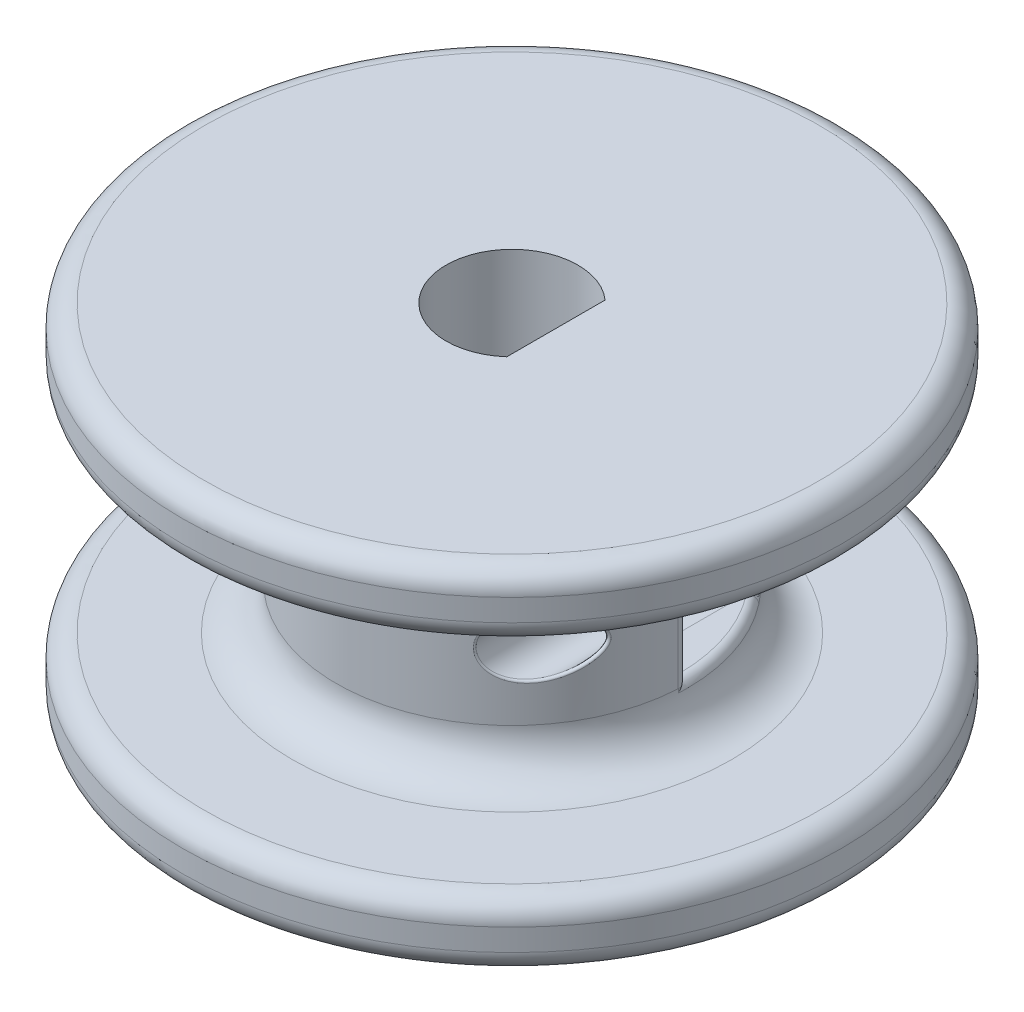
ISO-10303-21;
HEADER;
FILE_DESCRIPTION(('STEP AP214'),'2;1');
FILE_NAME('part.step','',(''),(''),'','','');
FILE_SCHEMA(('AUTOMOTIVE_DESIGN { 1 0 10303 214 1 1 1 1 }'));
ENDSEC;
DATA;
#1=APPLICATION_CONTEXT('core data for automotive mechanical design processes');
#2=APPLICATION_PROTOCOL_DEFINITION('international standard','automotive_design',2000,#1);
#3=PRODUCT_CONTEXT('',#1,'mechanical');
#4=PRODUCT('Part','Part','',(#3));
#5=PRODUCT_RELATED_PRODUCT_CATEGORY('part','',(#4));
#6=PRODUCT_DEFINITION_FORMATION('','',#4);
#7=PRODUCT_DEFINITION_CONTEXT('part definition',#1,'design');
#8=PRODUCT_DEFINITION('design','',#6,#7);
#9=PRODUCT_DEFINITION_SHAPE('','',#8);
#10=(LENGTH_UNIT() NAMED_UNIT(*) SI_UNIT(.MILLI.,.METRE.));
#11=(NAMED_UNIT(*) PLANE_ANGLE_UNIT() SI_UNIT($,.RADIAN.));
#12=(NAMED_UNIT(*) SI_UNIT($,.STERADIAN.) SOLID_ANGLE_UNIT());
#13=UNCERTAINTY_MEASURE_WITH_UNIT(LENGTH_MEASURE(1.E-05),#10,'distance_accuracy_value','');
#14=(GEOMETRIC_REPRESENTATION_CONTEXT(3) GLOBAL_UNCERTAINTY_ASSIGNED_CONTEXT((#13)) GLOBAL_UNIT_ASSIGNED_CONTEXT((#10,
#11,#12)) REPRESENTATION_CONTEXT('',''));
#15=CARTESIAN_POINT('',(0.,0.,0.));
#16=DIRECTION('',(0.,0.,1.));
#17=DIRECTION('',(1.,0.,0.));
#18=AXIS2_PLACEMENT_3D('',#15,#16,#17);
#19=CARTESIAN_POINT('',(1.4118596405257E-12,-411.591007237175,0.));
#20=DIRECTION('',(0.,-1.,0.));
#21=DIRECTION('',(1.,0.,0.));
#22=AXIS2_PLACEMENT_3D('',#19,#20,#21);
#23=CYLINDRICAL_SURFACE('',#22,4.);
#24=CARTESIAN_POINT('',(3.62257276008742,0.0550287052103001,1.45469431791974));
#25=CARTESIAN_POINT('',(3.62335901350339,0.0461333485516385,1.49487046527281));
#26=CARTESIAN_POINT('',(3.66374245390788,0.0479796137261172,1.50259299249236));
#27=CARTESIAN_POINT('',(3.70412589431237,0.0498258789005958,1.5103155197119));
#28=CARTESIAN_POINT('',(3.71886438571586,0.0594310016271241,1.47310817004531));
#29=CARTESIAN_POINT('',(3.62371119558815,0.0421491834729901,1.45159059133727));
#30=CARTESIAN_POINT('',(3.62414381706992,0.0351601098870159,1.49230859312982));
#31=CARTESIAN_POINT('',(3.66465924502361,0.0365913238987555,1.50003450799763));
#32=CARTESIAN_POINT('',(3.70517678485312,0.0379956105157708,1.5077544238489));
#33=CARTESIAN_POINT('',(3.72010945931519,0.0455211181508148,1.46996515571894));
#34=CARTESIAN_POINT('',(3.62446496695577,0.0290199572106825,1.44952519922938));
#35=CARTESIAN_POINT('',(3.62464399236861,0.0241657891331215,1.49064264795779));
#36=CARTESIAN_POINT('',(3.66525083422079,0.0251475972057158,1.49836649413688));
#37=CARTESIAN_POINT('',(3.70585795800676,0.0261206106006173,1.50608958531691));
#38=CARTESIAN_POINT('',(3.72093383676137,0.0313415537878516,1.46787361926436));
#39=CARTESIAN_POINT('',(3.62513485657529,0.00260724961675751,1.44768950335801));
#40=CARTESIAN_POINT('',(3.62509009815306,0.00215503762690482,1.48915752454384));
#41=CARTESIAN_POINT('',(3.66577751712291,0.00224628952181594,1.49688158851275));
#42=CARTESIAN_POINT('',(3.70646500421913,0.00233111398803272,1.50460542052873));
#43=CARTESIAN_POINT('',(3.72166647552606,0.00281582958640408,1.46601468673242));
#44=CARTESIAN_POINT('',(3.62505135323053,-0.0106761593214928,1.44791816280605));
#45=CARTESIAN_POINT('',(3.62503553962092,-0.00884308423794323,1.48933997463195));
#46=CARTESIAN_POINT('',(3.66571290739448,-0.00921128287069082,1.49706386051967));
#47=CARTESIAN_POINT('',(3.706390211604,-0.00956359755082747,1.50478772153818));
#48=CARTESIAN_POINT('',(3.72157515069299,-0.0115302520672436,1.46624624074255));
#49=CARTESIAN_POINT('',(3.62353646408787,-0.0500717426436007,1.45206886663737));
#50=CARTESIAN_POINT('',(3.6240233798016,-0.0417876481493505,1.49270453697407));
#51=CARTESIAN_POINT('',(3.6645180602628,-0.0434897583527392,1.50043071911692));
#52=CARTESIAN_POINT('',(3.70501524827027,-0.0451551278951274,1.50815024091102));
#53=CARTESIAN_POINT('',(3.71991836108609,-0.0540774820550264,1.4704494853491));
#54=CARTESIAN_POINT('',(3.6208517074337,-0.0758561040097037,1.45942546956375));
#55=CARTESIAN_POINT('',(3.62223177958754,-0.0637098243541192,1.4986557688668));
#56=CARTESIAN_POINT('',(3.66239553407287,-0.0663230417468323,1.50641075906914));
#57=CARTESIAN_POINT('',(3.70258413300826,-0.0687876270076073,1.51409801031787));
#58=CARTESIAN_POINT('',(3.71698212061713,-0.0819245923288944,1.4778992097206));
#59=CARTESIAN_POINT('',(3.61389679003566,-0.118872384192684,1.47815385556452));
#60=CARTESIAN_POINT('',(3.61712446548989,-0.101780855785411,1.51467275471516));
#61=CARTESIAN_POINT('',(3.65653238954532,-0.105757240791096,1.5224137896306));
#62=CARTESIAN_POINT('',(3.69595272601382,-0.10963590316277,1.53012089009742));
#63=CARTESIAN_POINT('',(3.70937572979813,-0.128382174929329,1.49686466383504));
#64=CARTESIAN_POINT('',(3.61011675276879,-0.136725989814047,1.48825637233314));
#65=CARTESIAN_POINT('',(3.61425633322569,-0.118064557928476,1.5234696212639));
#66=CARTESIAN_POINT('',(3.65326098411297,-0.122608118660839,1.53123042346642));
#67=CARTESIAN_POINT('',(3.69229108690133,-0.12704138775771,1.53892435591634));
#68=CARTESIAN_POINT('',(3.70524161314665,-0.147664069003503,1.50709506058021));
#69=CARTESIAN_POINT('',(3.60147598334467,-0.170752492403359,1.51099906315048));
#70=CARTESIAN_POINT('',(3.60739461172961,-0.149764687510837,1.54377711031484));
#71=CARTESIAN_POINT('',(3.64554681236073,-0.155349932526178,1.55155244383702));
#72=CARTESIAN_POINT('',(3.68372573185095,-0.160824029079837,1.55925721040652));
#73=CARTESIAN_POINT('',(3.69579145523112,-0.184412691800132,1.53012563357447));
#74=CARTESIAN_POINT('',(3.59661179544,-0.186919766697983,1.52364733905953));
#75=CARTESIAN_POINT('',(3.60340756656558,-0.165172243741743,1.55527053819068));
#76=CARTESIAN_POINT('',(3.64110029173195,-0.171237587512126,1.56306643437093));
#77=CARTESIAN_POINT('',(3.67882961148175,-0.177192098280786,1.57076935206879));
#78=CARTESIAN_POINT('',(3.69047163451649,-0.201873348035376,1.542934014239));
#79=CARTESIAN_POINT('',(3.58119954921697,-0.232005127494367,1.56304328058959));
#80=CARTESIAN_POINT('',(3.59043406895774,-0.208608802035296,1.5915093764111));
#81=CARTESIAN_POINT('',(3.6267275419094,-0.216120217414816,1.59945578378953));
#82=CARTESIAN_POINT('',(3.66314864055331,-0.223226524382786,1.60707968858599));
#83=CARTESIAN_POINT('',(3.6736157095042,-0.25056553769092,1.58282863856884));
#84=CARTESIAN_POINT('',(3.569561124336,-0.25885721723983,1.59199585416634));
#85=CARTESIAN_POINT('',(3.58019483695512,-0.235409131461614,1.61881518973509));
#86=CARTESIAN_POINT('',(3.61554152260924,-0.243619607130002,1.62682607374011));
#87=CARTESIAN_POINT('',(3.65105243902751,-0.251487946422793,1.63445377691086));
#88=CARTESIAN_POINT('',(3.66088710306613,-0.279565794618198,1.61214770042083));
#89=CARTESIAN_POINT('',(3.54424433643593,-0.308538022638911,1.65270584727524));
#90=CARTESIAN_POINT('',(3.55724523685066,-0.28555669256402,1.67683017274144));
#91=CARTESIAN_POINT('',(3.5907506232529,-0.295059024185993,1.68493176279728));
#92=CARTESIAN_POINT('',(3.6244259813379,-0.304210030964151,1.69263323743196));
#93=CARTESIAN_POINT('',(3.63319886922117,-0.333221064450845,1.67362617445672));
#94=CARTESIAN_POINT('',(3.53055962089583,-0.331353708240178,1.68447187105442));
#95=CARTESIAN_POINT('',(3.54455039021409,-0.308960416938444,1.70752914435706));
#96=CARTESIAN_POINT('',(3.57713818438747,-0.318987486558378,1.71567755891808));
#97=CARTESIAN_POINT('',(3.60990931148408,-0.328731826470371,1.72342819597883));
#98=CARTESIAN_POINT('',(3.61823229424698,-0.357862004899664,1.70579429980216));
#99=CARTESIAN_POINT('',(3.50053314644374,-0.375293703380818,1.75165710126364));
#100=CARTESIAN_POINT('',(3.51625417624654,-0.354307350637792,1.77281253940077));
#101=CARTESIAN_POINT('',(3.54697907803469,-0.365376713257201,1.78109123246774));
#102=CARTESIAN_POINT('',(3.57790869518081,-0.376131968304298,1.7889260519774));
#103=CARTESIAN_POINT('',(3.58539321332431,-0.405317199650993,1.77382997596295));
#104=CARTESIAN_POINT('',(3.48407495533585,-0.396203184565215,1.78717858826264));
#105=CARTESIAN_POINT('',(3.50051850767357,-0.376131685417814,1.80755280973));
#106=CARTESIAN_POINT('',(3.5302971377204,-0.387632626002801,1.81588390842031));
#107=CARTESIAN_POINT('',(3.56029032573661,-0.398879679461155,1.82378583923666));
#108=CARTESIAN_POINT('',(3.5673933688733,-0.427899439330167,1.80980110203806));
#109=CARTESIAN_POINT('',(3.4494273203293,-0.435105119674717,1.85910426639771));
#110=CARTESIAN_POINT('',(3.46703738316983,-0.416917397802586,1.87812229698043));
#111=CARTESIAN_POINT('',(3.49496320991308,-0.429233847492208,1.88657732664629));
#112=CARTESIAN_POINT('',(3.52310322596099,-0.441299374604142,1.8946037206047));
#113=CARTESIAN_POINT('',(3.52950025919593,-0.46991352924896,1.88263723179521));
#114=CARTESIAN_POINT('',(3.43123622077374,-0.453094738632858,1.89550927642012));
#115=CARTESIAN_POINT('',(3.44929926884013,-0.435928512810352,1.91397081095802));
#116=CARTESIAN_POINT('',(3.47630933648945,-0.448576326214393,1.92247910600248));
#117=CARTESIAN_POINT('',(3.50353953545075,-0.461024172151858,1.93058111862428));
#118=CARTESIAN_POINT('',(3.50960518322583,-0.489342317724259,1.91950306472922));
#119=CARTESIAN_POINT('',(3.3741624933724,-0.503193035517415,2.0054097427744));
#120=CARTESIAN_POINT('',(3.39355763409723,-0.488765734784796,2.02178023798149));
#121=CARTESIAN_POINT('',(3.41755669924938,-0.502649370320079,2.03107710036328));
#122=CARTESIAN_POINT('',(3.44241668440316,-0.51573547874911,2.03878144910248));
#123=CARTESIAN_POINT('',(3.44718530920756,-0.543448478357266,2.03079467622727));
#124=CARTESIAN_POINT('',(3.33280559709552,-0.531394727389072,2.07953109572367));
#125=CARTESIAN_POINT('',(3.35246935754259,-0.519192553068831,2.09527151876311));
#126=CARTESIAN_POINT('',(3.37469336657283,-0.53338672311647,2.10460761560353));
#127=CARTESIAN_POINT('',(3.39780063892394,-0.547088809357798,2.11254345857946));
#128=CARTESIAN_POINT('',(3.40195447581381,-0.573906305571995,2.10585427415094));
#129=CARTESIAN_POINT('',(3.24049154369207,-0.579390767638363,2.23286500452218));
#130=CARTESIAN_POINT('',(3.26008373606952,-0.571289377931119,2.24726407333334));
#131=CARTESIAN_POINT('',(3.27864168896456,-0.586184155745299,2.25697924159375));
#132=CARTESIAN_POINT('',(3.29820769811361,-0.600531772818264,2.26509431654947));
#133=CARTESIAN_POINT('',(3.30099328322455,-0.625742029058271,2.26112911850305));
#134=CARTESIAN_POINT('',(3.18903899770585,-0.598365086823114,2.31202740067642));
#135=CARTESIAN_POINT('',(3.20819510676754,-0.59244994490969,2.32605367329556));
#136=CARTESIAN_POINT('',(3.22491087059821,-0.607388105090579,2.33579072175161));
#137=CARTESIAN_POINT('',(3.24263082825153,-0.622082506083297,2.34417245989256));
#138=CARTESIAN_POINT('',(3.24472113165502,-0.646234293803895,2.34129357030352));
#139=CARTESIAN_POINT('',(3.07965244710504,-0.622415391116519,2.46746535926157));
#140=CARTESIAN_POINT('',(3.09733451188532,-0.620193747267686,2.48069483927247));
#141=CARTESIAN_POINT('',(3.11042274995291,-0.635201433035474,2.49069167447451));
#142=CARTESIAN_POINT('',(3.12447786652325,-0.649974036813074,2.49937705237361));
#143=CARTESIAN_POINT('',(3.1250882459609,-0.672208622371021,2.49869909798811));
#144=CARTESIAN_POINT('',(3.02173996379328,-0.62753616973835,2.54374943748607));
#145=CARTESIAN_POINT('',(3.03837611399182,-0.627101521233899,2.5567845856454));
#146=CARTESIAN_POINT('',(3.04968875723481,-0.641857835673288,2.56678913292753));
#147=CARTESIAN_POINT('',(3.0619052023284,-0.656652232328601,2.57574260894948));
#148=CARTESIAN_POINT('',(3.06175104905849,-0.677739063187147,2.57594879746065));
#149=CARTESIAN_POINT('',(2.92484730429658,-0.621547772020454,2.66204894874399));
#150=CARTESIAN_POINT('',(2.93922904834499,-0.623314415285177,2.67498289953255));
#151=CARTESIAN_POINT('',(2.94795471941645,-0.637609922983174,2.68487086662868));
#152=CARTESIAN_POINT('',(2.95701681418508,-0.651919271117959,2.69436957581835));
#153=CARTESIAN_POINT('',(2.95578236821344,-0.671271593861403,2.69574577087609));
#154=CARTESIAN_POINT('',(2.88732443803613,-0.616004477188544,2.7057951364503));
#155=CARTESIAN_POINT('',(2.90086418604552,-0.618533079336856,2.71861910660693));
#156=CARTESIAN_POINT('',(2.90853022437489,-0.632557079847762,2.72855363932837));
#157=CARTESIAN_POINT('',(2.91650281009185,-0.646651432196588,2.73816408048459));
#158=CARTESIAN_POINT('',(2.9147447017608,-0.665284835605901,2.74004570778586));
#159=CARTESIAN_POINT('',(2.81141644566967,-0.597149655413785,2.79042712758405));
#160=CARTESIAN_POINT('',(2.8231855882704,-0.600899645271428,2.80300377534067));
#161=CARTESIAN_POINT('',(2.8287390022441,-0.61428865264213,2.81308907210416));
#162=CARTESIAN_POINT('',(2.83459228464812,-0.627746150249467,2.82285599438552));
#163=CARTESIAN_POINT('',(2.8317263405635,-0.644921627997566,2.82574898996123));
#164=CARTESIAN_POINT('',(2.77303232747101,-0.583846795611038,2.83131606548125));
#165=CARTESIAN_POINT('',(2.78384180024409,-0.588108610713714,2.84381874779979));
#166=CARTESIAN_POINT('',(2.788373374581,-0.601082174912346,2.85394483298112));
#167=CARTESIAN_POINT('',(2.79316305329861,-0.61417172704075,2.86382014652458));
#168=CARTESIAN_POINT('',(2.78974674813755,-0.630554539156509,2.86715550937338));
#169=CARTESIAN_POINT('',(2.70497144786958,-0.551978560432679,2.90082035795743));
#170=CARTESIAN_POINT('',(2.71401174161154,-0.556837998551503,2.91320427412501));
#171=CARTESIAN_POINT('',(2.71678096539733,-0.568981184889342,2.92341073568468));
#172=CARTESIAN_POINT('',(2.71971135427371,-0.581196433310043,2.93346108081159));
#173=CARTESIAN_POINT('',(2.7153105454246,-0.59613684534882,2.93753960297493));
#174=CARTESIAN_POINT('',(2.67517114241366,-0.535122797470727,2.93020181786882));
#175=CARTESIAN_POINT('',(2.68342425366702,-0.540175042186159,2.94253943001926));
#176=CARTESIAN_POINT('',(2.68542807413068,-0.551882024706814,2.95278255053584));
#177=CARTESIAN_POINT('',(2.68756508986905,-0.563678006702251,2.9629048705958));
#178=CARTESIAN_POINT('',(2.68271881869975,-0.57793262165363,2.96729298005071));
#179=CARTESIAN_POINT('',(2.61711368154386,-0.495235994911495,2.98569073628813));
#180=CARTESIAN_POINT('',(2.6238330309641,-0.500465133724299,2.99791765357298));
#181=CARTESIAN_POINT('',(2.62433978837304,-0.511203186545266,3.00826346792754));
#182=CARTESIAN_POINT('',(2.62497800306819,-0.522028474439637,3.01848972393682));
#183=CARTESIAN_POINT('',(2.6192230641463,-0.534854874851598,3.02348428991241));
#184=CARTESIAN_POINT('',(2.58885431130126,-0.472214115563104,3.01180296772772));
#185=CARTESIAN_POINT('',(2.59479850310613,-0.477440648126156,3.02399985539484));
#186=CARTESIAN_POINT('',(2.59460207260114,-0.487633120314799,3.03437732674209));
#187=CARTESIAN_POINT('',(2.59450459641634,-0.497920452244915,3.04467005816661));
#188=CARTESIAN_POINT('',(2.5883166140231,-0.509991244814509,3.0499270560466));
#189=CARTESIAN_POINT('',(2.5407935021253,-0.425028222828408,3.05501294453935));
#190=CARTESIAN_POINT('',(2.54541588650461,-0.430051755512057,3.0671528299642));
#191=CARTESIAN_POINT('',(2.54402580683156,-0.439179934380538,3.07759691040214));
#192=CARTESIAN_POINT('',(2.54269930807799,-0.448368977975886,3.08798680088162));
#193=CARTESIAN_POINT('',(2.53575390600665,-0.459030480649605,3.09368399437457));
#194=CARTESIAN_POINT('',(2.52043511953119,-0.402028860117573,3.07286692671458));
#195=CARTESIAN_POINT('',(2.52449113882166,-0.406906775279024,3.08498783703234));
#196=CARTESIAN_POINT('',(2.522601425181,-0.415518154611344,3.0954575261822));
#197=CARTESIAN_POINT('',(2.520757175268,-0.424188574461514,3.10589003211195));
#198=CARTESIAN_POINT('',(2.51348853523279,-0.434191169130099,3.11176397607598));
#199=CARTESIAN_POINT('',(2.48264374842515,-0.352058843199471,3.10539085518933));
#200=CARTESIAN_POINT('',(2.48565960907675,-0.356529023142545,3.11746500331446));
#201=CARTESIAN_POINT('',(2.48283170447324,-0.364032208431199,3.12799716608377));
#202=CARTESIAN_POINT('',(2.48004903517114,-0.371593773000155,3.13849230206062));
#203=CARTESIAN_POINT('',(2.47215721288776,-0.380223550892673,3.14469959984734));
#204=CARTESIAN_POINT('',(2.46520651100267,-0.325094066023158,3.12006543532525));
#205=CARTESIAN_POINT('',(2.46773133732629,-0.329298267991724,3.13212763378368));
#206=CARTESIAN_POINT('',(2.46448189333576,-0.336214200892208,3.14268082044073));
#207=CARTESIAN_POINT('',(2.46126045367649,-0.343181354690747,3.15321188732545));
#208=CARTESIAN_POINT('',(2.45308661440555,-0.351101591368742,3.15955993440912));
#209=CARTESIAN_POINT('',(2.43410401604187,-0.267343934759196,3.14586002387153));
#210=CARTESIAN_POINT('',(2.43576616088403,-0.270917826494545,3.15788983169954));
#211=CARTESIAN_POINT('',(2.43175256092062,-0.276580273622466,3.16849363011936));
#212=CARTESIAN_POINT('',(2.42776773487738,-0.282294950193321,3.17907476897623));
#213=CARTESIAN_POINT('',(2.4190707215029,-0.288731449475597,3.18568103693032));
#214=CARTESIAN_POINT('',(2.42047602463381,-0.236524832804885,3.15694507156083));
#215=CARTESIAN_POINT('',(2.42175125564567,-0.239722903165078,3.16896836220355));
#216=CARTESIAN_POINT('',(2.41741226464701,-0.244729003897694,3.179587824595));
#217=CARTESIAN_POINT('',(2.4130867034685,-0.249773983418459,3.19019695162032));
#218=CARTESIAN_POINT('',(2.4041661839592,-0.255446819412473,3.19690640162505));
#219=CARTESIAN_POINT('',(2.39823626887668,-0.172204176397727,3.17486720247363));
#220=CARTESIAN_POINT('',(2.39889185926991,-0.174585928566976,3.18687077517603));
#221=CARTESIAN_POINT('',(2.39401070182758,-0.178216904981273,3.19752576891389));
#222=CARTESIAN_POINT('',(2.38914337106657,-0.181886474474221,3.20817020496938));
#223=CARTESIAN_POINT('',(2.37984321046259,-0.18598051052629,3.21505539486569));
#224=CARTESIAN_POINT('',(2.38960759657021,-0.138712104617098,3.18171860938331));
#225=CARTESIAN_POINT('',(2.39001748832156,-0.140638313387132,3.19371899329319));
#226=CARTESIAN_POINT('',(2.38493164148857,-0.143566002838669,3.20438385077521));
#227=CARTESIAN_POINT('',(2.37984975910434,-0.146514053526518,3.21504570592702));
#228=CARTESIAN_POINT('',(2.37040628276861,-0.149809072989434,3.22199352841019));
#229=CARTESIAN_POINT('',(2.38094891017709,-0.0877209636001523,3.1885686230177));
#230=CARTESIAN_POINT('',(2.38111540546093,-0.088943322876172,3.2005634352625));
#231=CARTESIAN_POINT('',(2.37582111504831,-0.0907971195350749,3.21124069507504));
#232=CARTESIAN_POINT('',(2.37052748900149,-0.0926560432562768,3.22191746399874));
#233=CARTESIAN_POINT('',(2.36093652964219,-0.0947386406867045,3.22893025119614));
#234=CARTESIAN_POINT('',(2.37877754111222,-0.0707420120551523,3.19028034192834));
#235=CARTESIAN_POINT('',(2.37888309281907,-0.0717286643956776,3.20227370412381));
#236=CARTESIAN_POINT('',(2.37353646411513,-0.0732240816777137,3.21295415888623));
#237=CARTESIAN_POINT('',(2.36818989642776,-0.0747221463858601,3.22363457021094));
#238=CARTESIAN_POINT('',(2.35856176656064,-0.0764013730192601,3.23066363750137));
#239=CARTESIAN_POINT('',(2.37480735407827,-0.0245993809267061,3.1934085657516));
#240=CARTESIAN_POINT('',(2.37480243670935,-0.0249475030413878,3.20539854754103));
#241=CARTESIAN_POINT('',(2.369359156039,-0.0254640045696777,3.21608558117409));
#242=CARTESIAN_POINT('',(2.36391681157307,-0.025987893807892,3.22677190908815));
#243=CARTESIAN_POINT('',(2.35421968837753,-0.0265673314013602,3.23383145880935));
#244=CARTESIAN_POINT('',(2.37433696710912,0.00476143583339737,3.19377678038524));
#245=CARTESIAN_POINT('',(2.37431861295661,0.00483091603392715,3.20576664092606));
#246=CARTESIAN_POINT('',(2.36886423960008,0.00492912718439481,3.21645418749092));
#247=CARTESIAN_POINT('',(2.36341020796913,0.00503221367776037,3.22714147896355));
#248=CARTESIAN_POINT('',(2.35370523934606,0.00514235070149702,3.23420433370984));
#249=CARTESIAN_POINT('',(2.37751103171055,0.06318409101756,3.19127879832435));
#250=CARTESIAN_POINT('',(2.37758126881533,0.0640676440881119,3.20327113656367));
#251=CARTESIAN_POINT('',(2.37220387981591,0.0654019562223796,3.21395363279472));
#252=CARTESIAN_POINT('',(2.36682667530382,0.0667409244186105,3.22463599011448));
#253=CARTESIAN_POINT('',(2.35717662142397,0.0682388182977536,3.23167473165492));
#254=CARTESIAN_POINT('',(2.38116410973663,0.0922451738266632,3.18840582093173));
#255=CARTESIAN_POINT('',(2.38133795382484,0.0935371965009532,3.20039974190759));
#256=CARTESIAN_POINT('',(2.37604751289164,0.0954808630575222,3.21107768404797));
#257=CARTESIAN_POINT('',(2.37076043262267,0.0974412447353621,3.22175310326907));
#258=CARTESIAN_POINT('',(2.36117188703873,0.0996247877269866,3.22876538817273));
#259=CARTESIAN_POINT('',(2.39235045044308,0.149070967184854,3.17953535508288));
#260=CARTESIAN_POINT('',(2.39283656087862,0.151132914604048,3.19153823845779));
#261=CARTESIAN_POINT('',(2.3878176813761,0.154282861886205,3.20219850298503));
#262=CARTESIAN_POINT('',(2.38280209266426,0.157449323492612,3.21285627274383));
#263=CARTESIAN_POINT('',(2.37340606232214,0.160996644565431,3.21978263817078));
#264=CARTESIAN_POINT('',(2.3998696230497,0.176839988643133,3.17354921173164));
#265=CARTESIAN_POINT('',(2.40056859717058,0.179274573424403,3.18555589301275));
#266=CARTESIAN_POINT('',(2.39572939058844,0.183010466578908,3.19620662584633));
#267=CARTESIAN_POINT('',(2.39089964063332,0.186773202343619,3.20685012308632));
#268=CARTESIAN_POINT('',(2.38162956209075,0.190987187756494,3.21372072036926));
#269=CARTESIAN_POINT('',(2.41836987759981,0.230519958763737,3.15864400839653));
#270=CARTESIAN_POINT('',(2.41958444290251,0.23363620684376,3.17066699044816));
#271=CARTESIAN_POINT('',(2.41519608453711,0.238519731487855,3.18128825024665));
#272=CARTESIAN_POINT('',(2.410817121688,0.243430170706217,3.19190229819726));
#273=CARTESIAN_POINT('',(2.40186275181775,0.24896155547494,3.1986268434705));
#274=CARTESIAN_POINT('',(2.42935631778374,0.256427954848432,3.14972040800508));
#275=CARTESIAN_POINT('',(2.43088100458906,0.25986212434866,3.16175008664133));
#276=CARTESIAN_POINT('',(2.42675670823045,0.265298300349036,3.17235720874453));
#277=CARTESIAN_POINT('',(2.42265041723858,0.270769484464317,3.18295023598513));
#278=CARTESIAN_POINT('',(2.41387830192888,0.276942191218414,3.1895902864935));
#279=CARTESIAN_POINT('',(2.45461802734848,0.30658845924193,3.12888819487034));
#280=CARTESIAN_POINT('',(2.45684488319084,0.310590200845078,3.1409427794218));
#281=CARTESIAN_POINT('',(2.45333947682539,0.317110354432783,3.15150956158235));
#282=CARTESIAN_POINT('',(2.44985306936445,0.323667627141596,3.16206141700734));
#283=CARTESIAN_POINT('',(2.44150629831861,0.331115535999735,3.16849437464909));
#284=CARTESIAN_POINT('',(2.46898502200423,0.330764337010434,3.11689531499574));
#285=CARTESIAN_POINT('',(2.47161549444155,0.335019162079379,3.12896058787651));
#286=CARTESIAN_POINT('',(2.46845816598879,0.342063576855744,3.13950867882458));
#287=CARTESIAN_POINT('',(2.46533079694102,0.349150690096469,3.15003252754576));
#288=CARTESIAN_POINT('',(2.45721906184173,0.357225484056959,3.15634968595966));
#289=CARTESIAN_POINT('',(2.50014773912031,0.37621001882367,3.09040047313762));
#290=CARTESIAN_POINT('',(2.50363854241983,0.38088010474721,3.10250215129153));
#291=CARTESIAN_POINT('',(2.50125194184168,0.388924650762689,3.11299910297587));
#292=CARTESIAN_POINT('',(2.49889549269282,0.397012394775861,3.12347170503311));
#293=CARTESIAN_POINT('',(2.49130081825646,0.406306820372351,3.12951946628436));
#294=CARTESIAN_POINT('',(2.51694627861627,0.397476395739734,3.07589559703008));
#295=CARTESIAN_POINT('',(2.52090492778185,0.402312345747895,3.08801304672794));
#296=CARTESIAN_POINT('',(2.51892999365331,0.410828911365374,3.09848749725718));
#297=CARTESIAN_POINT('',(2.51699710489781,0.419391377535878,3.10892686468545));
#298=CARTESIAN_POINT('',(2.50967289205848,0.42927450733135,3.11483098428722));
#299=CARTESIAN_POINT('',(2.55924926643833,0.444658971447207,3.03860937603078));
#300=CARTESIAN_POINT('',(2.56438284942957,0.44979865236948,3.05076896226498));
#301=CARTESIAN_POINT('',(2.56344764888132,0.459359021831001,3.06118857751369));
#302=CARTESIAN_POINT('',(2.5625929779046,0.469007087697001,3.0715405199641));
#303=CARTESIAN_POINT('',(2.55593843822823,0.48023168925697,3.07707278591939));
#304=CARTESIAN_POINT('',(2.58558908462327,0.46914077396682,3.01480977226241));
#305=CARTESIAN_POINT('',(2.59145163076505,0.474354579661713,3.02699436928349));
#306=CARTESIAN_POINT('',(2.59116629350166,0.48448097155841,3.03738433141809));
#307=CARTESIAN_POINT('',(2.5909917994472,0.494692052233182,3.04767587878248));
#308=CARTESIAN_POINT('',(2.58474553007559,0.506672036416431,3.052971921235));
#309=CARTESIAN_POINT('',(2.64019249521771,0.512228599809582,2.96387855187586));
#310=CARTESIAN_POINT('',(2.64751521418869,0.517414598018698,2.97615799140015));
#311=CARTESIAN_POINT('',(2.64862408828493,0.528560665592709,2.98645298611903));
#312=CARTESIAN_POINT('',(2.64984522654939,0.539793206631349,2.9966486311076));
#313=CARTESIAN_POINT('',(2.6444636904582,0.553206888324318,3.00139600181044));
#314=CARTESIAN_POINT('',(2.66845823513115,0.530827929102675,2.93674318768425));
#315=CARTESIAN_POINT('',(2.67653953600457,0.535903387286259,2.94906167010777));
#316=CARTESIAN_POINT('',(2.67836549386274,0.547511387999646,2.95932214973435));
#317=CARTESIAN_POINT('',(2.68033099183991,0.559193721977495,2.96945136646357));
#318=CARTESIAN_POINT('',(2.67537710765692,0.573294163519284,2.97391715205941));
#319=CARTESIAN_POINT('',(2.73570021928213,0.568081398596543,2.86999475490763));
#320=CARTESIAN_POINT('',(2.74557160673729,0.572740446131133,2.88240861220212));
#321=CARTESIAN_POINT('',(2.74910718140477,0.585270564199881,2.89259874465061));
#322=CARTESIAN_POINT('',(2.75289373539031,0.597934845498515,2.90255167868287));
#323=CARTESIAN_POINT('',(2.74891770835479,0.613527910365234,2.906323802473));
#324=CARTESIAN_POINT('',(2.77499303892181,0.584520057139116,2.82931678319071));
#325=CARTESIAN_POINT('',(2.78587473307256,0.588745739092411,2.84179356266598));
#326=CARTESIAN_POINT('',(2.79043682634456,0.601753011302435,2.85194626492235));
#327=CARTESIAN_POINT('',(2.79530037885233,0.614847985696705,2.86178759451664));
#328=CARTESIAN_POINT('',(2.79189112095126,0.631281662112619,2.86513091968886));
#329=CARTESIAN_POINT('',(2.85308214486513,0.60886669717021,2.74462256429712));
#330=CARTESIAN_POINT('',(2.86584040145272,0.612002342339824,2.75733111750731));
#331=CARTESIAN_POINT('',(2.87254185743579,0.625755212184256,2.7673323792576));
#332=CARTESIAN_POINT('',(2.87955143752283,0.639598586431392,2.77701680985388));
#333=CARTESIAN_POINT('',(2.87729490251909,0.6575760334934,2.77936462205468));
#334=CARTESIAN_POINT('',(2.89187754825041,0.616761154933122,2.70060114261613));
#335=CARTESIAN_POINT('',(2.90553995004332,0.619186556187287,2.7134091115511));
#336=CARTESIAN_POINT('',(2.9133162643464,0.63326075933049,2.72336584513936));
#337=CARTESIAN_POINT('',(2.92143586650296,0.647366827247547,2.73293524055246));
#338=CARTESIAN_POINT('',(2.91972430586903,0.666102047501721,2.73478596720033));
#339=CARTESIAN_POINT('',(2.98388060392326,0.627154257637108,2.59116724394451));
#340=CARTESIAN_POINT('',(2.99967584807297,0.627670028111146,2.60415279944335));
#341=CARTESIAN_POINT('',(3.0099526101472,0.642265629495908,2.61410986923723));
#342=CARTESIAN_POINT('',(3.02092220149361,0.656925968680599,2.62328251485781));
#343=CARTESIAN_POINT('',(3.02034536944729,0.677326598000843,2.62396682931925));
#344=CARTESIAN_POINT('',(3.03627428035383,0.625978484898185,2.52455616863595));
#345=CARTESIAN_POINT('',(3.05309247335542,0.625043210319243,2.53771180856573));
#346=CARTESIAN_POINT('',(3.06493381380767,0.639902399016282,2.54764079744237));
#347=CARTESIAN_POINT('',(3.07752247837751,0.654640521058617,2.55660087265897));
#348=CARTESIAN_POINT('',(3.07764680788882,0.676056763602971,2.55651257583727));
#349=CARTESIAN_POINT('',(3.13624027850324,0.612059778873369,2.38864013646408));
#350=CARTESIAN_POINT('',(3.15464199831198,0.608066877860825,2.4024250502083));
#351=CARTESIAN_POINT('',(3.16967943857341,0.623023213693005,2.41212029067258));
#352=CARTESIAN_POINT('',(3.1854860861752,0.637856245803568,2.420822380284));
#353=CARTESIAN_POINT('',(3.18697670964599,0.66102456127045,2.41887608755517));
#354=CARTESIAN_POINT('',(3.18380458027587,0.59929794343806,2.31933095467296));
#355=CARTESIAN_POINT('',(3.20278610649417,0.593508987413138,2.33340964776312));
#356=CARTESIAN_POINT('',(3.21943518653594,0.608487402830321,2.34306481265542));
#357=CARTESIAN_POINT('',(3.23686756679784,0.623141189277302,2.35155525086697));
#358=CARTESIAN_POINT('',(3.23899640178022,0.647241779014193,2.34868957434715));
#359=CARTESIAN_POINT('',(3.27505793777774,0.563435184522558,2.17706292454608));
#360=CARTESIAN_POINT('',(3.29471035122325,0.55394937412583,2.19204837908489));
#361=CARTESIAN_POINT('',(3.31465262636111,0.568546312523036,2.20149512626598));
#362=CARTESIAN_POINT('',(3.33544637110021,0.582781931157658,2.2096760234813));
#363=CARTESIAN_POINT('',(3.338797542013,0.608509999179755,2.20462068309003));
#364=CARTESIAN_POINT('',(3.31855453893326,0.53998992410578,2.10406100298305));
#365=CARTESIAN_POINT('',(3.33824428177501,0.52838660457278,2.1195375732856));
#366=CARTESIAN_POINT('',(3.35990463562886,0.542780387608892,2.12894418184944));
#367=CARTESIAN_POINT('',(3.38240650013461,0.556550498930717,2.13689825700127));
#368=CARTESIAN_POINT('',(3.3863685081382,0.583189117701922,2.13069468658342));
#369=CARTESIAN_POINT('',(3.37914111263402,0.497476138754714,1.99494596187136));
#370=CARTESIAN_POINT('',(3.39805687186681,0.483083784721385,2.012120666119));
#371=CARTESIAN_POINT('',(3.42263221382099,0.496533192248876,2.02078957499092));
#372=CARTESIAN_POINT('',(3.44742304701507,0.50982537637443,2.0290877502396));
#373=CARTESIAN_POINT('',(3.45263028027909,0.537274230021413,2.02019844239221));
#374=CARTESIAN_POINT('',(3.39856856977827,0.482071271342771,1.95862133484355));
#375=CARTESIAN_POINT('',(3.41723319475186,0.466646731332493,1.97621825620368));
#376=CARTESIAN_POINT('',(3.44269150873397,0.479841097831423,1.98483266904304));
#377=CARTESIAN_POINT('',(3.46836108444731,0.492837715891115,1.99305411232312));
#378=CARTESIAN_POINT('',(3.47387752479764,0.520636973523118,1.983414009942));
#379=CARTESIAN_POINT('',(3.43582092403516,0.448677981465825,1.88640892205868));
#380=CARTESIAN_POINT('',(3.45377407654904,0.431261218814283,1.90501300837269));
#381=CARTESIAN_POINT('',(3.48101487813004,0.443822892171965,1.91350019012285));
#382=CARTESIAN_POINT('',(3.5084684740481,0.456183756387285,1.9215910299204));
#383=CARTESIAN_POINT('',(3.51461934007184,0.484572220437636,1.91028751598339));
#384=CARTESIAN_POINT('',(3.4536464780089,0.430690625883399,1.85052096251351));
#385=CARTESIAN_POINT('',(3.47113309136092,0.412272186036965,1.86968940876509));
#386=CARTESIAN_POINT('',(3.49927968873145,0.42449786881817,1.87812438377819));
#387=CARTESIAN_POINT('',(3.52763410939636,0.436474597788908,1.88614077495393));
#388=CARTESIAN_POINT('',(3.53411462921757,0.465145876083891,1.87394527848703));
#389=CARTESIAN_POINT('',(3.49024607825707,0.388811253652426,1.77411769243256));
#390=CARTESIAN_POINT('',(3.50648182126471,0.368367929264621,1.79469480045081));
#391=CARTESIAN_POINT('',(3.53657083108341,0.379749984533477,1.80307070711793));
#392=CARTESIAN_POINT('',(3.5669400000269,0.390795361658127,1.81088311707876));
#393=CARTESIAN_POINT('',(3.57414254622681,0.419916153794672,1.79657487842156));
#394=CARTESIAN_POINT('',(3.50873828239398,0.364436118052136,1.73374820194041));
#395=CARTESIAN_POINT('',(3.5240996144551,0.342964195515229,1.75525669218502));
#396=CARTESIAN_POINT('',(3.55527574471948,0.353846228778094,1.76357679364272));
#397=CARTESIAN_POINT('',(3.58671720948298,0.364299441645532,1.77131044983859));
#398=CARTESIAN_POINT('',(3.59436693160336,0.39359100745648,1.75569438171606));
#399=CARTESIAN_POINT('',(3.54308121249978,0.310971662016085,1.65564744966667));
#400=CARTESIAN_POINT('',(3.55624430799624,0.287984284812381,1.67955783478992));
#401=CARTESIAN_POINT('',(3.58961526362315,0.297592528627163,1.68775485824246));
#402=CARTESIAN_POINT('',(3.62325057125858,0.306761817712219,1.69536878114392));
#403=CARTESIAN_POINT('',(3.63192679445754,0.335849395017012,1.67660501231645));
#404=CARTESIAN_POINT('',(3.5589440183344,0.281905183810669,1.61790461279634));
#405=CARTESIAN_POINT('',(3.57076019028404,0.258324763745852,1.6432787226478));
#406=CARTESIAN_POINT('',(3.60526397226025,0.26726419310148,1.651412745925));
#407=CARTESIAN_POINT('',(3.63999951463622,0.275630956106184,1.65898153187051));
#408=CARTESIAN_POINT('',(3.64927548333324,0.304457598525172,1.63838441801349));
#409=CARTESIAN_POINT('',(3.5846510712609,0.222807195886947,1.55441877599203));
#410=CARTESIAN_POINT('',(3.59342019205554,0.199690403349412,1.58346728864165));
#411=CARTESIAN_POINT('',(3.62999024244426,0.206918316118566,1.59142297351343));
#412=CARTESIAN_POINT('',(3.6667092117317,0.213788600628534,1.59901979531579));
#413=CARTESIAN_POINT('',(3.67739053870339,0.240631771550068,1.57409496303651));
#414=CARTESIAN_POINT('',(3.59506602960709,0.193965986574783,1.52775046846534));
#415=CARTESIAN_POINT('',(3.60224181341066,0.171472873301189,1.55879349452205));
#416=CARTESIAN_POINT('',(3.63974898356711,0.177897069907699,1.56667180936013));
#417=CARTESIAN_POINT('',(3.67735380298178,0.183923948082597,1.57429557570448));
#418=CARTESIAN_POINT('',(3.68878107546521,0.209483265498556,1.54708908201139));
#419=CARTESIAN_POINT('',(3.60799575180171,0.145759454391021,1.49387989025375));
#420=CARTESIAN_POINT('',(3.61260455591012,0.126408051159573,1.52843857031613));
#421=CARTESIAN_POINT('',(3.65139272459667,0.131230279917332,1.53620493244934));
#422=CARTESIAN_POINT('',(3.69020856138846,0.135944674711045,1.54389840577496));
#423=CARTESIAN_POINT('',(3.70292193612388,0.157420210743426,1.51278976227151));
#424=CARTESIAN_POINT('',(3.61187765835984,0.128702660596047,1.48355191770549));
#425=CARTESIAN_POINT('',(3.61559686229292,0.110717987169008,1.51936547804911));
#426=CARTESIAN_POINT('',(3.65479034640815,0.115003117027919,1.52711212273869));
#427=CARTESIAN_POINT('',(3.69399920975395,0.119192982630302,1.53481693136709));
#428=CARTESIAN_POINT('',(3.707167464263,0.138998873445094,1.50233105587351));
#429=CARTESIAN_POINT('',(3.61831272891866,0.0929539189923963,1.46628531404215));
#430=CARTESIAN_POINT('',(3.62039193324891,0.0787424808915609,1.50448238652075));
#431=CARTESIAN_POINT('',(3.66027738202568,0.0818827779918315,1.51222485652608));
#432=CARTESIAN_POINT('',(3.7001781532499,0.0849330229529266,1.5199258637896));
#433=CARTESIAN_POINT('',(3.71420531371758,0.100390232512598,1.48484588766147));
#434=CARTESIAN_POINT('',(3.62087200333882,0.0742699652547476,1.45933110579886));
#435=CARTESIAN_POINT('',(3.62218974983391,0.0624821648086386,1.49868734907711));
#436=CARTESIAN_POINT('',(3.66237282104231,0.06499305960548,1.50641522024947));
#437=CARTESIAN_POINT('',(3.70256019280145,0.0674515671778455,1.51413124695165));
#438=CARTESIAN_POINT('',(3.71700431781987,0.080211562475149,1.47780365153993));
#439=CARTESIAN_POINT('',(3.62257276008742,0.0550287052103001,1.45469431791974));
#440=CARTESIAN_POINT('',(3.62335901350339,0.0461333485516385,1.49487046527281));
#441=CARTESIAN_POINT('',(3.66374245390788,0.0479796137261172,1.50259299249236));
#442=CARTESIAN_POINT('',(3.70412589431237,0.0498258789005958,1.5103155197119));
#443=CARTESIAN_POINT('',(3.71886438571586,0.0594310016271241,1.47310817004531));
#444=(BOUNDED_SURFACE() B_SPLINE_SURFACE(3,2,((#24,#25,#26,#27,#28),(#29,#30,#31,#32,#33),(#34,
#35,#36,#37,#38),(#39,#40,#41,#42,#43),(#44,#45,#46,#47,#48),(#49,#50,#51,#52,#53),(#54,#55,#56,
#57,#58),(#59,#60,#61,#62,#63),(#64,#65,#66,#67,#68),(#69,#70,#71,#72,#73),(#74,#75,#76,#77,
#78),(#79,#80,#81,#82,#83),(#84,#85,#86,#87,#88),(#89,#90,#91,#92,#93),(#94,#95,#96,#97,#98),
(#99,#100,#101,#102,#103),(#104,#105,#106,#107,#108),(#109,#110,#111,#112,#113),(#114,#115,#116,
#117,#118),(#119,#120,#121,#122,#123),(#124,#125,#126,#127,#128),(#129,#130,#131,#132,#133),
(#134,#135,#136,#137,#138),(#139,#140,#141,#142,#143),(#144,#145,#146,#147,#148),(#149,#150,
#151,#152,#153),(#154,#155,#156,#157,#158),(#159,#160,#161,#162,#163),(#164,#165,#166,#167,
#168),(#169,#170,#171,#172,#173),(#174,#175,#176,#177,#178),(#179,#180,#181,#182,#183),(#184,
#185,#186,#187,#188),(#189,#190,#191,#192,#193),(#194,#195,#196,#197,#198),(#199,#200,#201,#202,
#203),(#204,#205,#206,#207,#208),(#209,#210,#211,#212,#213),(#214,#215,#216,#217,#218),(#219,
#220,#221,#222,#223),(#224,#225,#226,#227,#228),(#229,#230,#231,#232,#233),(#234,#235,#236,#237,
#238),(#239,#240,#241,#242,#243),(#244,#245,#246,#247,#248),(#249,#250,#251,#252,#253),(#254,
#255,#256,#257,#258),(#259,#260,#261,#262,#263),(#264,#265,#266,#267,#268),(#269,#270,#271,#272,
#273),(#274,#275,#276,#277,#278),(#279,#280,#281,#282,#283),(#284,#285,#286,#287,#288),(#289,
#290,#291,#292,#293),(#294,#295,#296,#297,#298),(#299,#300,#301,#302,#303),(#304,#305,#306,#307,
#308),(#309,#310,#311,#312,#313),(#314,#315,#316,#317,#318),(#319,#320,#321,#322,#323),(#324,
#325,#326,#327,#328),(#329,#330,#331,#332,#333),(#334,#335,#336,#337,#338),(#339,#340,#341,#342,
#343),(#344,#345,#346,#347,#348),(#349,#350,#351,#352,#353),(#354,#355,#356,#357,#358),(#359,
#360,#361,#362,#363),(#364,#365,#366,#367,#368),(#369,#370,#371,#372,#373),(#374,#375,#376,#377,
#378),(#379,#380,#381,#382,#383),(#384,#385,#386,#387,#388),(#389,#390,#391,#392,#393),(#394,
#395,#396,#397,#398),(#399,#400,#401,#402,#403),(#404,#405,#406,#407,#408),(#409,#410,#411,#412,
#413),(#414,#415,#416,#417,#418),(#419,#420,#421,#422,#423),(#424,#425,#426,#427,#428),(#429,
#430,#431,#432,#433),(#434,#435,#436,#437,#438),(#439,#440,#441,#442,#443)),.UNSPECIFIED.,.T.,
.F.,.F.) B_SPLINE_SURFACE_WITH_KNOTS((4,2,2,2,2,2,2,2,2,2,2,2,2,2,2,2,2,2,2,2,2,2,2,2,2,2,2,2,2,
2,2,2,2,2,2,2,2,2,2,2,2,4),(3,2,3),(0.,0.0428582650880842,0.0856971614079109,0.170975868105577,
0.23714350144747,0.303525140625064,0.431415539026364,0.559711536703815,0.696578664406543,
0.83357789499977,1.10780432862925,1.40326342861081,1.69776605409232,1.87704976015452,
2.05613359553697,2.19731614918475,2.33829011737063,2.45086093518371,2.56326656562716,
2.67673617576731,2.78981975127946,2.84544768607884,2.94007503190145,3.03490070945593,
3.12938321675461,3.22401245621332,3.32158716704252,3.4192758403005,3.5551709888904,
3.69122022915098,3.87442533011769,4.05791998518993,4.31872010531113,4.57994647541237,
4.85026329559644,4.9855534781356,5.12078792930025,5.27700142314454,5.43247606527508,
5.55896358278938,5.62329125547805,5.68731902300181),(0.,0.5,1.),
.UNSPECIFIED.) GEOMETRIC_REPRESENTATION_ITEM() RATIONAL_B_SPLINE_SURFACE(((1.,0.772080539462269,
1.,0.772080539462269,1.),(1.,0.771237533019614,1.,0.771237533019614,1.),(1.,0.770660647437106,
1.,0.770660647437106,1.),(1.,0.770148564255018,1.,0.770148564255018,1.),(1.,0.770213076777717,
1.,0.770213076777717,1.),(1.,0.771367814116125,1.,0.771367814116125,1.),(1.,0.773410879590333,
1.,0.773410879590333,1.),(1.,0.77820630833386,1.,0.77820630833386,1.),(1.,0.780697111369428,1.,
0.780697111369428,1.),(1.,0.785995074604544,1.,0.785995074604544,1.),(1.,0.788803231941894,1.,
0.788803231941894,1.),(1.,0.797118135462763,1.,0.797118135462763,1.),(1.,0.802714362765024,1.,
0.802714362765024,1.),(1.,0.813609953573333,1.,0.813609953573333,1.),(1.,0.8189083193,1.,
0.8189083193,1.),(1.,0.829506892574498,1.,0.829506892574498,1.),(1.,0.83478357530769,1.,
0.83478357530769,1.),(1.,0.844974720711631,1.,0.844974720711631,1.),(1.,0.849888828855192,1.,
0.849888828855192,1.),(1.,0.864162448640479,1.,0.864162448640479,1.),(1.,0.87304428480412,1.,
0.87304428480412,1.),(1.,0.890392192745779,1.,0.890392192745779,1.),(1.,0.898772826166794,1.,
0.898772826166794,1.),(1.,0.914378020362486,1.,0.914378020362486,1.),(1.,0.921606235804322,1.,
0.921606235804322,1.),(1.,0.932265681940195,1.,0.932265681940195,1.),(1.,0.93607604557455,1.,
0.93607604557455,1.),(1.,0.943217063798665,1.,0.943217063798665,1.),(1.,0.946548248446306,1.,
0.946548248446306,1.),(1.,0.952030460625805,1.,0.952030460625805,1.),(1.,0.95428204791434,1.,
0.95428204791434,1.),(1.,0.95842518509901,1.,0.95842518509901,1.),(1.,0.960317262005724,1.,
0.960317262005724,1.),(1.,0.963370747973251,1.,0.963370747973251,1.),(1.,0.9646025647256,1.,
0.9646025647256,1.),(1.,0.966804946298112,1.,0.966804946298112,1.),(1.,0.967775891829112,1.,
0.967775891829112,1.),(1.,0.96945617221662,1.,0.96945617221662,1.),(1.,0.970162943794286,1.,
0.970162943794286,1.),(1.,0.971293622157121,1.,0.971293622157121,1.),(1.,0.97171848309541,1.,
0.97171848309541,1.),(1.,0.972141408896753,1.,0.972141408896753,1.),(1.,0.972246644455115,1.,
0.972246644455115,1.),(1.,0.97243885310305,1.,0.97243885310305,1.),(1.,0.972461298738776,1.,
0.972461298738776,1.),(1.,0.972308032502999,1.,0.972308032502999,1.),(1.,0.972131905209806,1.,
0.972131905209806,1.),(1.,0.9715827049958,1.,0.9715827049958,1.),(1.,0.971210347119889,1.,
0.971210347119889,1.),(1.,0.970270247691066,1.,0.970270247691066,1.),(1.,0.96970220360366,1.,
0.96970220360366,1.),(1.,0.96835352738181,1.,0.96835352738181,1.),(1.,0.967566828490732,1.,
0.967566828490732,1.),(1.,0.965794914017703,1.,0.965794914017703,1.),(1.,0.964809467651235,1.,
0.964809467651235,1.),(1.,0.96222412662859,1.,0.96222412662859,1.),(1.,0.960534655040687,1.,
0.960534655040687,1.),(1.,0.956812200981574,1.,0.956812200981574,1.),(1.,0.954778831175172,1.,
0.954778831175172,1.),(1.,0.949633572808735,1.,0.949633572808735,1.),(1.,0.946392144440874,1.,
0.946392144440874,1.),(1.,0.939392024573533,1.,0.939392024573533,1.),(1.,0.935632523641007,1.,
0.935632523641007,1.),(1.,0.925953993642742,1.,0.925953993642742,1.),(1.,0.919792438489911,1.,
0.919792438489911,1.),(1.,0.906572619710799,1.,0.906572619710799,1.),(1.,0.899512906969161,1.,
0.899512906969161,1.),(1.,0.884210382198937,1.,0.884210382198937,1.),(1.,0.875934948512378,1.,
0.875934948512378,1.),(1.,0.862676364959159,1.,0.862676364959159,1.),(1.,0.85811350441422,1.,
0.85811350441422,1.),(1.,0.848670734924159,1.,0.848670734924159,1.),(1.,0.843790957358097,1.,
0.843790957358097,1.),(1.,0.832886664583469,1.,0.832886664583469,1.),(1.,0.826801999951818,1.,
0.826801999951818,1.),(1.,0.814146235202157,1.,0.814146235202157,1.),(1.,0.807577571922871,1.,
0.807577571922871,1.),(1.,0.795374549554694,1.,0.795374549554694,1.),(1.,0.789794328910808,1.,
0.789794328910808,1.),(1.,0.782042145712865,1.,0.782042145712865,1.),(1.,0.779542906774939,1.,
0.779542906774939,1.),(1.,0.775193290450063,1.,0.775193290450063,1.),(1.,0.773339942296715,1.,
0.773339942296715,1.),(1.,0.772080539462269,1.,0.772080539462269,1.))) REPRESENTATION_ITEM('') SURFACE());
#445=CARTESIAN_POINT('',(3.71886438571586,0.0594310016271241,1.47310817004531));
#446=CARTESIAN_POINT('',(3.72010945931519,0.0455211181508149,1.46996515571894));
#447=CARTESIAN_POINT('',(3.72093383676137,0.0313415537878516,1.46787361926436));
#448=CARTESIAN_POINT('',(3.72166647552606,0.00281582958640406,1.46601468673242));
#449=CARTESIAN_POINT('',(3.72157515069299,-0.0115302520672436,1.46624624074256));
#450=CARTESIAN_POINT('',(3.71991836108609,-0.0540774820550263,1.4704494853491));
#451=CARTESIAN_POINT('',(3.71698212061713,-0.0819245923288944,1.4778992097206));
#452=CARTESIAN_POINT('',(3.70937572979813,-0.128382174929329,1.49686466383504));
#453=CARTESIAN_POINT('',(3.70524161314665,-0.147664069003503,1.50709506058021));
#454=CARTESIAN_POINT('',(3.69579145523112,-0.184412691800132,1.53012563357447));
#455=CARTESIAN_POINT('',(3.69047163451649,-0.201873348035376,1.542934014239));
#456=CARTESIAN_POINT('',(3.6736157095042,-0.25056553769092,1.58282863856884));
#457=CARTESIAN_POINT('',(3.66088710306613,-0.279565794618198,1.61214770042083));
#458=CARTESIAN_POINT('',(3.63319886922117,-0.333221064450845,1.67362617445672));
#459=CARTESIAN_POINT('',(3.61823229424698,-0.357862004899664,1.70579429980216));
#460=CARTESIAN_POINT('',(3.58539321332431,-0.405317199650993,1.77382997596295));
#461=CARTESIAN_POINT('',(3.5673933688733,-0.427899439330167,1.80980110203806));
#462=CARTESIAN_POINT('',(3.52950025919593,-0.46991352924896,1.88263723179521));
#463=CARTESIAN_POINT('',(3.50960518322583,-0.489342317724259,1.91950306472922));
#464=CARTESIAN_POINT('',(3.44718530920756,-0.543448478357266,2.03079467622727));
#465=CARTESIAN_POINT('',(3.40195447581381,-0.573906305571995,2.10585427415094));
#466=CARTESIAN_POINT('',(3.30099328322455,-0.625742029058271,2.26112911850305));
#467=CARTESIAN_POINT('',(3.24472113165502,-0.646234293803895,2.34129357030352));
#468=CARTESIAN_POINT('',(3.1250882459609,-0.672208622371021,2.49869909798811));
#469=CARTESIAN_POINT('',(3.06175104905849,-0.677739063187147,2.57594879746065));
#470=CARTESIAN_POINT('',(2.95578236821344,-0.671271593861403,2.69574577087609));
#471=CARTESIAN_POINT('',(2.9147447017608,-0.665284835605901,2.74004570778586));
#472=CARTESIAN_POINT('',(2.8317263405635,-0.644921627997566,2.82574898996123));
#473=CARTESIAN_POINT('',(2.78974674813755,-0.630554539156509,2.86715550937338));
#474=CARTESIAN_POINT('',(2.7153105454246,-0.59613684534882,2.93753960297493));
#475=CARTESIAN_POINT('',(2.68271881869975,-0.57793262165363,2.96729298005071));
#476=CARTESIAN_POINT('',(2.6192230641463,-0.534854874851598,3.02348428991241));
#477=CARTESIAN_POINT('',(2.5883166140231,-0.509991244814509,3.0499270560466));
#478=CARTESIAN_POINT('',(2.53575390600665,-0.459030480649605,3.09368399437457));
#479=CARTESIAN_POINT('',(2.51348853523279,-0.434191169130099,3.11176397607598));
#480=CARTESIAN_POINT('',(2.47215721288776,-0.380223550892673,3.14469959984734));
#481=CARTESIAN_POINT('',(2.45308661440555,-0.351101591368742,3.15955993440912));
#482=CARTESIAN_POINT('',(2.4190707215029,-0.288731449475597,3.18568103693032));
#483=CARTESIAN_POINT('',(2.4041661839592,-0.255446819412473,3.19690640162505));
#484=CARTESIAN_POINT('',(2.37984321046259,-0.18598051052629,3.21505539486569));
#485=CARTESIAN_POINT('',(2.37040628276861,-0.149809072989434,3.22199352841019));
#486=CARTESIAN_POINT('',(2.36093652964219,-0.0947386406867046,3.22893025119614));
#487=CARTESIAN_POINT('',(2.35856176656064,-0.0764013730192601,3.23066363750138));
#488=CARTESIAN_POINT('',(2.35421968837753,-0.0265673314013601,3.23383145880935));
#489=CARTESIAN_POINT('',(2.35370523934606,0.005142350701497,3.23420433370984));
#490=CARTESIAN_POINT('',(2.35717662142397,0.0682388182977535,3.23167473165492));
#491=CARTESIAN_POINT('',(2.36117188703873,0.0996247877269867,3.22876538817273));
#492=CARTESIAN_POINT('',(2.37340606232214,0.160996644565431,3.21978263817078));
#493=CARTESIAN_POINT('',(2.38162956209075,0.190987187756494,3.21372072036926));
#494=CARTESIAN_POINT('',(2.40186275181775,0.248961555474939,3.1986268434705));
#495=CARTESIAN_POINT('',(2.41387830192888,0.276942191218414,3.1895902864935));
#496=CARTESIAN_POINT('',(2.44150629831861,0.331115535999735,3.16849437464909));
#497=CARTESIAN_POINT('',(2.45721906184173,0.357225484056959,3.15634968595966));
#498=CARTESIAN_POINT('',(2.49130081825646,0.406306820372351,3.12951946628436));
#499=CARTESIAN_POINT('',(2.50967289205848,0.42927450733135,3.11483098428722));
#500=CARTESIAN_POINT('',(2.55593843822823,0.48023168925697,3.07707278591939));
#501=CARTESIAN_POINT('',(2.58474553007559,0.506672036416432,3.052971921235));
#502=CARTESIAN_POINT('',(2.6444636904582,0.553206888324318,3.00139600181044));
#503=CARTESIAN_POINT('',(2.67537710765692,0.573294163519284,2.97391715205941));
#504=CARTESIAN_POINT('',(2.74891770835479,0.613527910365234,2.906323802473));
#505=CARTESIAN_POINT('',(2.79189112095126,0.631281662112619,2.86513091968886));
#506=CARTESIAN_POINT('',(2.87729490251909,0.6575760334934,2.77936462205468));
#507=CARTESIAN_POINT('',(2.91972430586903,0.666102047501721,2.73478596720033));
#508=CARTESIAN_POINT('',(3.02034536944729,0.677326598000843,2.62396682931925));
#509=CARTESIAN_POINT('',(3.07764680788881,0.676056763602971,2.55651257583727));
#510=CARTESIAN_POINT('',(3.18697670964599,0.66102456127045,2.41887608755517));
#511=CARTESIAN_POINT('',(3.23899640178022,0.647241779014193,2.34868957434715));
#512=CARTESIAN_POINT('',(3.338797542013,0.608509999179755,2.20462068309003));
#513=CARTESIAN_POINT('',(3.3863685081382,0.583189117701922,2.13069468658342));
#514=CARTESIAN_POINT('',(3.45263028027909,0.537274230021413,2.02019844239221));
#515=CARTESIAN_POINT('',(3.47387752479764,0.520636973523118,1.98341400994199));
#516=CARTESIAN_POINT('',(3.51461934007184,0.484572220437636,1.91028751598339));
#517=CARTESIAN_POINT('',(3.53411462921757,0.465145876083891,1.87394527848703));
#518=CARTESIAN_POINT('',(3.57414254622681,0.419916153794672,1.79657487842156));
#519=CARTESIAN_POINT('',(3.59436693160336,0.39359100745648,1.75569438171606));
#520=CARTESIAN_POINT('',(3.63192679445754,0.335849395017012,1.67660501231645));
#521=CARTESIAN_POINT('',(3.64927548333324,0.304457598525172,1.63838441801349));
#522=CARTESIAN_POINT('',(3.67739053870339,0.240631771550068,1.57409496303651));
#523=CARTESIAN_POINT('',(3.68878107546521,0.209483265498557,1.54708908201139));
#524=CARTESIAN_POINT('',(3.70292193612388,0.157420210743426,1.51278976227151));
#525=CARTESIAN_POINT('',(3.707167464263,0.138998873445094,1.50233105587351));
#526=CARTESIAN_POINT('',(3.71420531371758,0.100390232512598,1.48484588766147));
#527=CARTESIAN_POINT('',(3.71700431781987,0.0802115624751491,1.47780365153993));
#528=CARTESIAN_POINT('',(3.71886438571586,0.0594310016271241,1.47310817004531));
#529=B_SPLINE_CURVE_WITH_KNOTS('',3,(#445,#446,#447,#448,#449,#450,#451,#452,#453,#454,#455,
#456,#457,#458,#459,#460,#461,#462,#463,#464,#465,#466,#467,#468,#469,#470,#471,#472,#473,#474,
#475,#476,#477,#478,#479,#480,#481,#482,#483,#484,#485,#486,#487,#488,#489,#490,#491,#492,#493,
#494,#495,#496,#497,#498,#499,#500,#501,#502,#503,#504,#505,#506,#507,#508,#509,#510,#511,#512,
#513,#514,#515,#516,#517,#518,#519,#520,#521,#522,#523,#524,#525,#526,#527,#528),.UNSPECIFIED.,
.T.,.F.,(4,2,2,2,2,2,2,2,2,2,2,2,2,2,2,2,2,2,2,2,2,2,2,2,2,2,2,2,2,2,2,2,2,2,2,2,2,2,2,2,2,4),
(0.,0.0428582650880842,0.0856971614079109,0.170975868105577,0.23714350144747,0.303525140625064,
0.431415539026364,0.559711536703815,0.696578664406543,0.83357789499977,1.10780432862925,
1.40326342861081,1.69776605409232,1.87704976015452,2.05613359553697,2.19731614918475,
2.33829011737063,2.45086093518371,2.56326656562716,2.67673617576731,2.78981975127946,
2.84544768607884,2.94007503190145,3.03490070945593,3.12938321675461,3.22401245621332,
3.32158716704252,3.4192758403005,3.5551709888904,3.69122022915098,3.87442533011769,
4.05791998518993,4.31872010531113,4.57994647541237,4.85026329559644,4.9855534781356,
5.12078792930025,5.27700142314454,5.43247606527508,5.55896358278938,5.62329125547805,
5.68731902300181),.UNSPECIFIED.);
#530=CARTESIAN_POINT('',(3.71886438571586,0.0594310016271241,1.47310817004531));
#531=VERTEX_POINT('',#530);
#532=EDGE_CURVE('E11',#531,#531,#529,.T.);
#533=ORIENTED_EDGE('',*,*,#532,.T.);
#534=EDGE_LOOP('',(#533));
#535=FACE_BOUND('',#534,.T.);
#536=CARTESIAN_POINT('',(0.,-1.5,0.));
#537=DIRECTION('',(0.,-1.,0.));
#538=DIRECTION('',(1.,0.,0.));
#539=AXIS2_PLACEMENT_3D('',#536,#537,#538);
#540=CIRCLE('',#539,4.00000000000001);
#541=CARTESIAN_POINT('',(3.99445599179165,-1.49999999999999,0.210526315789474));
#542=VERTEX_POINT('',#541);
#543=CARTESIAN_POINT('',(2.57181427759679,-1.49999999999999,-3.06362062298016));
#544=VERTEX_POINT('',#543);
#545=EDGE_CURVE('E389',#542,#544,#540,.T.);
#546=ORIENTED_EDGE('',*,*,#545,.F.);
#547=DIRECTION('',(0.,-1.,0.));
#548=VECTOR('',#547,1.);
#549=CARTESIAN_POINT('',(3.99445599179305,-411.591007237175,0.210526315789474));
#550=LINE('',#549,#548);
#551=CARTESIAN_POINT('',(3.99445599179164,1.50000000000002,0.210526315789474));
#552=VERTEX_POINT('',#551);
#553=EDGE_CURVE('E296',#542,#552,#550,.F.);
#554=ORIENTED_EDGE('',*,*,#553,.T.);
#555=CARTESIAN_POINT('',(0.,1.5,0.));
#556=DIRECTION('',(0.,-1.,0.));
#557=DIRECTION('',(1.,0.,0.));
#558=AXIS2_PLACEMENT_3D('',#555,#556,#557);
#559=CIRCLE('',#558,4.00000000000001);
#560=CARTESIAN_POINT('',(2.57181427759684,1.50000000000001,-3.06362062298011));
#561=VERTEX_POINT('',#560);
#562=EDGE_CURVE('E417',#552,#561,#559,.T.);
#563=ORIENTED_EDGE('',*,*,#562,.T.);
#564=CARTESIAN_POINT('',(2.99999999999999,1.4,-2.33238075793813));
#565=CARTESIAN_POINT('',(3.15789473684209,1.4,-2.45513763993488));
#566=CARTESIAN_POINT('',(3.15789473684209,1.6,-2.45513763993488));
#567=CARTESIAN_POINT('',(2.96374662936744,1.39999555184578,-2.38569293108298));
#568=CARTESIAN_POINT('',(3.11668261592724,1.40404042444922,-2.50818040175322));
#569=CARTESIAN_POINT('',(3.11428165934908,1.59999491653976,-2.5112557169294));
#570=CARTESIAN_POINT('',(2.92621166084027,1.39859036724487,-2.43791706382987));
#571=CARTESIAN_POINT('',(3.07367200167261,1.40648687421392,-2.56071588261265));
#572=CARTESIAN_POINT('',(3.06912681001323,1.59838899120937,-2.56622848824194));
#573=CARTESIAN_POINT('',(2.84879901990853,1.3923556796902,-2.53997923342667));
#574=CARTESIAN_POINT('',(2.98528451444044,1.40727475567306,-2.66321365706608));
#575=CARTESIAN_POINT('',(2.97599882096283,1.5912636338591,-2.67366235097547));
#576=CARTESIAN_POINT('',(2.80891589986,1.38751790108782,-2.58981119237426));
#577=CARTESIAN_POINT('',(2.93988778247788,1.40568294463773,-2.71328477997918));
#578=CARTESIAN_POINT('',(2.92801912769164,1.5857347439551,-2.72611704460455));
#579=CARTESIAN_POINT('',(2.72689400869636,1.37373681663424,-2.68698730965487));
#580=CARTESIAN_POINT('',(2.84682929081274,1.3976863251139,-2.81080725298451));
#581=CARTESIAN_POINT('',(2.8293461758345,1.56998493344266,-2.82840769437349));
#582=CARTESIAN_POINT('',(2.68474034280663,1.36476245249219,-2.73430957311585));
#583=CARTESIAN_POINT('',(2.79910700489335,1.39131937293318,-2.85836858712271));
#584=CARTESIAN_POINT('',(2.77863499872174,1.55972851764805,-2.87822060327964));
#585=CARTESIAN_POINT('',(2.59903151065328,1.34208391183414,-2.82559502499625));
#586=CARTESIAN_POINT('',(2.70240611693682,1.37308604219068,-2.95002270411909));
#587=CARTESIAN_POINT('',(2.67552662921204,1.53381018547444,-2.97431055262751));
#588=CARTESIAN_POINT('',(2.55547791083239,1.32838486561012,-2.86956179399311));
#589=CARTESIAN_POINT('',(2.65336075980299,1.36129022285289,-2.9942523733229));
#590=CARTESIAN_POINT('',(2.62313132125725,1.51815413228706,-3.02059136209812));
#591=CARTESIAN_POINT('',(2.44973580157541,1.28901025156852,-2.97089467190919));
#592=CARTESIAN_POINT('',(2.53499784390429,1.32565134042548,-3.09585780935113));
#593=CARTESIAN_POINT('',(2.49592276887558,1.47315457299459,-3.12725754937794));
#594=CARTESIAN_POINT('',(2.38715280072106,1.26073071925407,-3.02646416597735));
#595=CARTESIAN_POINT('',(2.46487546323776,1.29884068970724,-3.15197289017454));
#596=CARTESIAN_POINT('',(2.42063494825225,1.44083510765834,-3.18575175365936));
#597=CARTESIAN_POINT('',(2.26326138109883,1.19255651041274,-3.12899339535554));
#598=CARTESIAN_POINT('',(2.32686336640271,1.2321301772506,-3.25536992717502));
#599=CARTESIAN_POINT('',(2.27159263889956,1.36292172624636,-3.29367725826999));
#600=CARTESIAN_POINT('',(2.20194912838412,1.15270483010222,-3.17598397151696));
#601=CARTESIAN_POINT('',(2.25864520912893,1.19230734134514,-3.30301710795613));
#602=CARTESIAN_POINT('',(2.19783353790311,1.31737694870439,-3.34314102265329));
#603=CARTESIAN_POINT('',(2.08312590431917,1.06067099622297,-3.26122874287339));
#604=CARTESIAN_POINT('',(2.12724183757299,1.09913980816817,-3.38940275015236));
#605=CARTESIAN_POINT('',(2.05488830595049,1.21219542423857,-3.43287236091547));
#606=CARTESIAN_POINT('',(2.02564589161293,1.00840109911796,-3.29941677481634));
#607=CARTESIAN_POINT('',(2.06376640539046,1.04561506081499,-3.42834043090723));
#608=CARTESIAN_POINT('',(1.98573941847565,1.15245839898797,-3.47307028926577));
#609=CARTESIAN_POINT('',(1.91843544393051,0.892440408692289,-3.36652168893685));
#610=CARTESIAN_POINT('',(1.94605887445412,0.926314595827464,-3.49679921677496));
#611=CARTESIAN_POINT('',(1.85676444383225,1.01993189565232,-3.54370704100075));
#612=CARTESIAN_POINT('',(1.86871016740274,0.828742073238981,-3.39543241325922));
#613=CARTESIAN_POINT('',(1.89158170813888,0.860380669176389,-3.5264797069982));
#614=CARTESIAN_POINT('',(1.79694456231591,0.947133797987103,-3.57413938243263));
#615=CARTESIAN_POINT('',(1.78461055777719,0.698726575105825,-3.44199165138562));
#616=CARTESIAN_POINT('',(1.79987013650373,0.725665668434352,-3.57436263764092));
#617=CARTESIAN_POINT('',(1.69577209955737,0.798544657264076,-3.62314910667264));
#618=CARTESIAN_POINT('',(1.74919940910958,0.633305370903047,-3.46047623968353));
#619=CARTESIAN_POINT('',(1.76135991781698,0.657724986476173,-3.5934696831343));
#620=CARTESIAN_POINT('',(1.65317222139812,0.723777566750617,-3.6426065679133));
#621=CARTESIAN_POINT('',(1.68894941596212,0.496702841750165,-3.49091002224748));
#622=CARTESIAN_POINT('',(1.69602363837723,0.515889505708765,-3.62499365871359));
#623=CARTESIAN_POINT('',(1.58069102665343,0.567660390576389,-3.6746421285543));
#624=CARTESIAN_POINT('',(1.66410660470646,0.425523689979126,-3.50286166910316));
#625=CARTESIAN_POINT('',(1.66915886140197,0.441931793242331,-3.63742997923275));
#626=CARTESIAN_POINT('',(1.55080493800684,0.48631278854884,-3.68722280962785));
#627=CARTESIAN_POINT('',(1.62678590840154,0.282108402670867,-3.52049208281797));
#628=CARTESIAN_POINT('',(1.62885554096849,0.292966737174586,-3.65580557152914));
#629=CARTESIAN_POINT('',(1.50590785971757,0.322409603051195,-3.7057811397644));
#630=CARTESIAN_POINT('',(1.61390856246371,0.209994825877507,-3.5263742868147));
#631=CARTESIAN_POINT('',(1.61498289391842,0.218072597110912,-3.66195549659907));
#632=CARTESIAN_POINT('',(1.49041631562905,0.239994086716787,-3.71197293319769));
#633=CARTESIAN_POINT('',(1.59957494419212,0.0644606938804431,-3.53290812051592));
#634=CARTESIAN_POINT('',(1.5995394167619,0.0669302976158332,-3.66879005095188));
#635=CARTESIAN_POINT('',(1.47317286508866,0.0736693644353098,-3.7188506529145));
#636=CARTESIAN_POINT('',(1.59811864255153,-0.00895985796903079,-3.53355976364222));
#637=CARTESIAN_POINT('',(1.59797288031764,-0.00929761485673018,-3.66947277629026));
#638=CARTESIAN_POINT('',(1.47142092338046,-0.0102398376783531,-3.71953659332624));
#639=CARTESIAN_POINT('',(1.60668582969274,-0.154997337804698,-3.52967046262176));
#640=CARTESIAN_POINT('',(1.60720102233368,-0.160958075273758,-3.66540270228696));
#641=CARTESIAN_POINT('',(1.48172731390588,-0.17713981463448,-3.7154425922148));
#642=CARTESIAN_POINT('',(1.61670557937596,-0.227614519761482,-3.52513120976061));
#643=CARTESIAN_POINT('',(1.61798878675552,-0.236366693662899,-3.660652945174));
#644=CARTESIAN_POINT('',(1.49378114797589,-0.260130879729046,-3.71066443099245));
#645=CARTESIAN_POINT('',(1.64781349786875,-0.370000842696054,-3.51060904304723));
#646=CARTESIAN_POINT('',(1.6515571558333,-0.384259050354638,-3.6454992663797));
#647=CARTESIAN_POINT('',(1.53120420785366,-0.42285810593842,-3.69537793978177));
#648=CARTESIAN_POINT('',(1.66890073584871,-0.439770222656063,-3.50062658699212));
#649=CARTESIAN_POINT('',(1.67433370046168,-0.456744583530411,-3.63509726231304));
#650=CARTESIAN_POINT('',(1.5565723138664,-0.502594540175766,-3.68487009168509));
#651=CARTESIAN_POINT('',(1.72123736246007,-0.574439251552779,-3.47475129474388));
#652=CARTESIAN_POINT('',(1.73101399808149,-0.596603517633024,-3.60824387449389));
#653=CARTESIAN_POINT('',(1.61953366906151,-0.656502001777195,-3.6576329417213));
#654=CARTESIAN_POINT('',(1.75248022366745,-0.639341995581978,-3.45886225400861));
#655=CARTESIAN_POINT('',(1.76492981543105,-0.664025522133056,-3.59178722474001));
#656=CARTESIAN_POINT('',(1.657119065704,-0.730676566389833,-3.64090763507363));
#657=CARTESIAN_POINT('',(1.82373486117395,-0.762537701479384,-3.42062593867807));
#658=CARTESIAN_POINT('',(1.84248178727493,-0.79178794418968,-3.55237691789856));
#659=CARTESIAN_POINT('',(1.74283893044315,-0.871471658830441,-3.60065888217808));
#660=CARTESIAN_POINT('',(1.86374692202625,-0.820830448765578,-3.39827845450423));
#661=CARTESIAN_POINT('',(1.88618647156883,-0.852214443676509,-3.52938662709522));
#662=CARTESIAN_POINT('',(1.79097374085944,-0.938091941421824,-3.5771352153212));
#663=CARTESIAN_POINT('',(1.95083515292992,-0.9295833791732,-3.34659646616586));
#664=CARTESIAN_POINT('',(1.98152265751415,-0.964519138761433,-3.4764927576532));
#665=CARTESIAN_POINT('',(1.89574153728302,-1.06238100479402,-3.52273312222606));
#666=CARTESIAN_POINT('',(1.99793821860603,-0.980012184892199,-3.31723509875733));
#667=CARTESIAN_POINT('',(2.03331825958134,-1.01646612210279,-3.44648062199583));
#668=CARTESIAN_POINT('',(1.95240687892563,-1.1200139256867,-3.49182641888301));
#669=CARTESIAN_POINT('',(2.09682870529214,-1.07183744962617,-3.25146339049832));
#670=CARTESIAN_POINT('',(2.14225007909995,-1.11039062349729,-3.37959699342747));
#671=CARTESIAN_POINT('',(2.07137287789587,-1.22495708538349,-3.42259304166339));
#672=CARTESIAN_POINT('',(2.14861324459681,-1.1132394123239,-3.21505737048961));
#673=CARTESIAN_POINT('',(2.19957640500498,-1.15245751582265,-3.34259046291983));
#674=CARTESIAN_POINT('',(2.13367006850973,-1.27227361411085,-3.38427091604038));
#675=CARTESIAN_POINT('',(2.25699950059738,-1.18848556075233,-3.13361462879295));
#676=CARTESIAN_POINT('',(2.31975044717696,-1.22800152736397,-3.2601879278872));
#677=CARTESIAN_POINT('',(2.26405954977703,-1.35826921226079,-3.29854171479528));
#678=CARTESIAN_POINT('',(2.3137131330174,-1.22190533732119,-3.08826302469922));
#679=CARTESIAN_POINT('',(2.38295427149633,-1.26102521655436,-3.21428922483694));
#680=CARTESIAN_POINT('',(2.33228647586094,-1.3964632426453,-3.25080318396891));
#681=CARTESIAN_POINT('',(2.42758567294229,-1.27922868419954,-2.99062344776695));
#682=CARTESIAN_POINT('',(2.51003974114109,-1.31639326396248,-3.11591025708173));
#683=CARTESIAN_POINT('',(2.46927599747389,-1.46197563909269,-3.14802468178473));
#684=CARTESIAN_POINT('',(2.48474540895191,-1.30310311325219,-2.93831487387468));
#685=CARTESIAN_POINT('',(2.57416245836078,-1.33866198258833,-3.06314366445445));
#686=CARTESIAN_POINT('',(2.53803958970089,-1.48926070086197,-3.09296302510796));
#687=CARTESIAN_POINT('',(2.62365344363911,-1.35129133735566,-2.80196903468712));
#688=CARTESIAN_POINT('',(2.73083147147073,-1.3816922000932,-2.92559362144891));
#689=CARTESIAN_POINT('',(2.70514699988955,-1.54433295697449,-2.94944108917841));
#690=CARTESIAN_POINT('',(2.70452485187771,-1.37068441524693,-2.71445951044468));
#691=CARTESIAN_POINT('',(2.82238985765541,-1.39642755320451,-2.83731417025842));
#692=CARTESIAN_POINT('',(2.80243591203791,-1.56649647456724,-2.85732580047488));
#693=CARTESIAN_POINT('',(2.82006035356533,-1.3889354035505,-2.57598171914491));
#694=CARTESIAN_POINT('',(2.9525344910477,-1.40621306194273,-2.69943799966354));
#695=CARTESIAN_POINT('',(2.94142598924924,-1.5873547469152,-2.71155970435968));
#696=CARTESIAN_POINT('',(2.85752888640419,-1.39321518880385,-2.52873966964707));
#697=CARTESIAN_POINT('',(2.9951985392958,-1.40738201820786,-2.6519752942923));
#698=CARTESIAN_POINT('',(2.98650091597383,-1.59224593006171,-2.66183123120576));
#699=CARTESIAN_POINT('',(2.93036258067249,-1.39873932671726,-2.43212261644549));
#700=CARTESIAN_POINT('',(3.07837521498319,-1.40620929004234,-2.55494797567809));
#701=CARTESIAN_POINT('',(3.07412039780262,-1.59855923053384,-2.56012906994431));
#702=CARTESIAN_POINT('',(2.96573187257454,-1.3999898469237,-2.3827521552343));
#703=CARTESIAN_POINT('',(3.11890260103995,-1.40381048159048,-2.50529202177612));
#704=CARTESIAN_POINT('',(3.11666992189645,-1.59998839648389,-2.5081601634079));
#705=CARTESIAN_POINT('',(2.99999999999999,-1.4,-2.33238075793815));
#706=CARTESIAN_POINT('',(3.15789473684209,-1.4,-2.45513763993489));
#707=CARTESIAN_POINT('',(3.15789473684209,-1.6,-2.45513763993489));
#708=(BOUNDED_SURFACE() B_SPLINE_SURFACE(3,2,((#564,#565,#566),(#567,#568,#569),(#570,#571,
#572),(#573,#574,#575),(#576,#577,#578),(#579,#580,#581),(#582,#583,#584),(#585,#586,#587),
(#588,#589,#590),(#591,#592,#593),(#594,#595,#596),(#597,#598,#599),(#600,#601,#602),(#603,#604,
#605),(#606,#607,#608),(#609,#610,#611),(#612,#613,#614),(#615,#616,#617),(#618,#619,#620),
(#621,#622,#623),(#624,#625,#626),(#627,#628,#629),(#630,#631,#632),(#633,#634,#635),(#636,#637,
#638),(#639,#640,#641),(#642,#643,#644),(#645,#646,#647),(#648,#649,#650),(#651,#652,#653),
(#654,#655,#656),(#657,#658,#659),(#660,#661,#662),(#663,#664,#665),(#666,#667,#668),(#669,#670,
#671),(#672,#673,#674),(#675,#676,#677),(#678,#679,#680),(#681,#682,#683),(#684,#685,#686),
(#687,#688,#689),(#690,#691,#692),(#693,#694,#695),(#696,#697,#698),(#699,#700,#701),(#702,#703,
#704),(#705,#706,#707)),.UNSPECIFIED.,.F.,.F.,.F.) B_SPLINE_SURFACE_WITH_KNOTS((4,2,2,2,2,2,2,2,
2,2,2,2,2,2,2,2,2,2,2,2,2,2,2,4),(3,3),(0.,0.202573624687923,0.405637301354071,0.61025109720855,
0.814643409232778,1.10192213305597,1.38814684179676,1.67645745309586,1.96495903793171,
2.22466512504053,2.48427364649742,2.73486616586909,2.98545804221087,3.2359682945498,
3.48645748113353,3.73678598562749,3.98712261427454,4.2384338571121,4.4895914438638,
4.75206158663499,5.01532702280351,5.40055973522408,5.59227674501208,5.78360309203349),(0.,1.),
.UNSPECIFIED.) GEOMETRIC_REPRESENTATION_ITEM() RATIONAL_B_SPLINE_SURFACE(((1.,0.707106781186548,
1.),(1.,0.714339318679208,1.),(1.,0.721407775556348,1.),(1.,0.735107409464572,1.),(1.,
0.741737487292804,1.),(1.,0.754463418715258,1.),(1.,0.760554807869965,1.),(1.,0.772020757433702,
1.),(1.,0.777396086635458,1.),(1.,0.789356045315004,1.),(1.,0.795547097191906,1.),(1.,
0.806141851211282,1.),(1.,0.810552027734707,1.),(1.,0.817689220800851,1.),(1.,0.820403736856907,
1.),(1.,0.824389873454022,1.),(1.,0.825660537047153,1.),(1.,0.827159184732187,1.),(1.,
0.82747858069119,1.),(1.,0.827726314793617,1.),(1.,0.827654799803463,1.),(1.,0.827449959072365,
1.),(1.,0.827318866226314,1.),(1.,0.827168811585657,1.),(1.,0.82714984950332,1.),(1.,
0.827244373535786,1.),(1.,0.827357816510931,1.),(1.,0.827580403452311,1.),(1.,0.827689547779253,
1.),(1.,0.827637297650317,1.),(1.,0.827476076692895,1.),(1.,0.826544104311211,1.),(1.,
0.825773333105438,1.),(1.,0.823279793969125,1.),(1.,0.82155333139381,1.),(1.,0.816886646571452,
1.),(1.,0.813947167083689,1.),(1.,0.806560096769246,1.),(1.,0.80205054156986,1.),(1.,
0.791567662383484,1.),(1.,0.785589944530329,1.),(1.,0.769233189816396,1.),(1.,0.758098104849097,
1.),(1.,0.739902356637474,1.),(1.,0.733604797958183,1.),(1.,0.720622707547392,1.),(1.,
0.713938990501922,1.),(1.,0.707106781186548,1.))) REPRESENTATION_ITEM('') SURFACE());
#709=CARTESIAN_POINT('',(3.15789473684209,1.6,-2.45513763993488));
#710=CARTESIAN_POINT('',(3.11428165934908,1.59999491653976,-2.5112557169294));
#711=CARTESIAN_POINT('',(3.06912681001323,1.59838899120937,-2.56622848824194));
#712=CARTESIAN_POINT('',(2.97599882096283,1.5912636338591,-2.67366235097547));
#713=CARTESIAN_POINT('',(2.92801912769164,1.5857347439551,-2.72611704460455));
#714=CARTESIAN_POINT('',(2.8293461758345,1.56998493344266,-2.82840769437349));
#715=CARTESIAN_POINT('',(2.77863499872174,1.55972851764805,-2.87822060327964));
#716=CARTESIAN_POINT('',(2.67552662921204,1.53381018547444,-2.97431055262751));
#717=CARTESIAN_POINT('',(2.62313132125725,1.51815413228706,-3.02059136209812));
#718=CARTESIAN_POINT('',(2.49592276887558,1.47315457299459,-3.12725754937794));
#719=CARTESIAN_POINT('',(2.42063494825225,1.44083510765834,-3.18575175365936));
#720=CARTESIAN_POINT('',(2.27159263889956,1.36292172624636,-3.29367725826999));
#721=CARTESIAN_POINT('',(2.19783353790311,1.31737694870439,-3.34314102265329));
#722=CARTESIAN_POINT('',(2.05488830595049,1.21219542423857,-3.43287236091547));
#723=CARTESIAN_POINT('',(1.98573941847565,1.15245839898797,-3.47307028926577));
#724=CARTESIAN_POINT('',(1.85676444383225,1.01993189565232,-3.54370704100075));
#725=CARTESIAN_POINT('',(1.79694456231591,0.947133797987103,-3.57413938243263));
#726=CARTESIAN_POINT('',(1.69577209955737,0.798544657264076,-3.62314910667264));
#727=CARTESIAN_POINT('',(1.65317222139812,0.723777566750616,-3.6426065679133));
#728=CARTESIAN_POINT('',(1.58069102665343,0.567660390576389,-3.6746421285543));
#729=CARTESIAN_POINT('',(1.55080493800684,0.48631278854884,-3.68722280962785));
#730=CARTESIAN_POINT('',(1.50590785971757,0.322409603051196,-3.7057811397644));
#731=CARTESIAN_POINT('',(1.49041631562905,0.239994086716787,-3.71197293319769));
#732=CARTESIAN_POINT('',(1.47317286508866,0.0736693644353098,-3.7188506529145));
#733=CARTESIAN_POINT('',(1.47142092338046,-0.0102398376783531,-3.71953659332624));
#734=CARTESIAN_POINT('',(1.48172731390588,-0.17713981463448,-3.7154425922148));
#735=CARTESIAN_POINT('',(1.49378114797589,-0.260130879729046,-3.71066443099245));
#736=CARTESIAN_POINT('',(1.53120420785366,-0.42285810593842,-3.69537793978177));
#737=CARTESIAN_POINT('',(1.5565723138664,-0.502594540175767,-3.68487009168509));
#738=CARTESIAN_POINT('',(1.61953366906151,-0.656502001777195,-3.6576329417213));
#739=CARTESIAN_POINT('',(1.657119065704,-0.730676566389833,-3.64090763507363));
#740=CARTESIAN_POINT('',(1.74283893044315,-0.871471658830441,-3.60065888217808));
#741=CARTESIAN_POINT('',(1.79097374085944,-0.938091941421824,-3.5771352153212));
#742=CARTESIAN_POINT('',(1.89574153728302,-1.06238100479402,-3.52273312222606));
#743=CARTESIAN_POINT('',(1.95240687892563,-1.1200139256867,-3.49182641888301));
#744=CARTESIAN_POINT('',(2.07137287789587,-1.22495708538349,-3.42259304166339));
#745=CARTESIAN_POINT('',(2.13367006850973,-1.27227361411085,-3.38427091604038));
#746=CARTESIAN_POINT('',(2.26405954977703,-1.35826921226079,-3.29854171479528));
#747=CARTESIAN_POINT('',(2.33228647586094,-1.3964632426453,-3.25080318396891));
#748=CARTESIAN_POINT('',(2.46927599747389,-1.46197563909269,-3.14802468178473));
#749=CARTESIAN_POINT('',(2.53803958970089,-1.48926070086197,-3.09296302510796));
#750=CARTESIAN_POINT('',(2.70514699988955,-1.54433295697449,-2.94944108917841));
#751=CARTESIAN_POINT('',(2.80243591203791,-1.56649647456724,-2.85732580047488));
#752=CARTESIAN_POINT('',(2.94142598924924,-1.5873547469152,-2.71155970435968));
#753=CARTESIAN_POINT('',(2.98650091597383,-1.59224593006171,-2.66183123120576));
#754=CARTESIAN_POINT('',(3.07412039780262,-1.59855923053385,-2.56012906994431));
#755=CARTESIAN_POINT('',(3.11666992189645,-1.59998839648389,-2.5081601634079));
#756=CARTESIAN_POINT('',(3.15789473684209,-1.6,-2.45513763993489));
#757=B_SPLINE_CURVE_WITH_KNOTS('',3,(#709,#710,#711,#712,#713,#714,#715,#716,#717,#718,#719,
#720,#721,#722,#723,#724,#725,#726,#727,#728,#729,#730,#731,#732,#733,#734,#735,#736,#737,#738,
#739,#740,#741,#742,#743,#744,#745,#746,#747,#748,#749,#750,#751,#752,#753,#754,#755,#756),
.UNSPECIFIED.,.F.,.F.,(4,2,2,2,2,2,2,2,2,2,2,2,2,2,2,2,2,2,2,2,2,2,2,4),(0.,0.202573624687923,
0.405637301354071,0.61025109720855,0.814643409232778,1.10192213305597,1.38814684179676,
1.67645745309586,1.96495903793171,2.22466512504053,2.48427364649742,2.73486616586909,
2.98545804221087,3.2359682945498,3.48645748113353,3.73678598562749,3.98712261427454,
4.2384338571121,4.4895914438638,4.75206158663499,5.01532702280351,5.40055973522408,
5.59227674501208,5.78360309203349),.UNSPECIFIED.);
#758=EDGE_CURVE('E290',#561,#544,#757,.T.);
#759=ORIENTED_EDGE('',*,*,#758,.T.);
#760=EDGE_LOOP('',(#546,#554,#563,#759));
#761=FACE_BOUND('',#760,.T.);
#762=ADVANCED_FACE('F39',(#535,#761),#23,.T.);
#763=CARTESIAN_POINT('',(0.,1.5,0.));
#764=DIRECTION('',(0.,-1.,0.));
#765=DIRECTION('',(1.,0.,0.));
#766=AXIS2_PLACEMENT_3D('',#763,#764,#765);
#767=TOROIDAL_SURFACE('',#766,5.00000000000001,1.);
#768=CARTESIAN_POINT('',(0.,2.5,0.));
#769=DIRECTION('',(0.,-1.,0.));
#770=DIRECTION('',(1.,0.,0.));
#771=AXIS2_PLACEMENT_3D('',#768,#769,#770);
#772=CIRCLE('',#771,5.00000000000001);
#773=CARTESIAN_POINT('',(5.,2.50000000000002,0.));
#774=VERTEX_POINT('',#773);
#775=EDGE_CURVE('E393',#774,#774,#772,.T.);
#776=ORIENTED_EDGE('',*,*,#775,.T.);
#777=EDGE_LOOP('',(#776));
#778=FACE_BOUND('',#777,.T.);
#779=ORIENTED_EDGE('',*,*,#562,.F.);
#780=CARTESIAN_POINT('',(3.86233748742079,1.10317326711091,0.));
#781=CARTESIAN_POINT('',(4.06050411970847,1.17270441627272,0.));
#782=CARTESIAN_POINT('',(4.05083290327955,1.16931105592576,0.209760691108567));
#783=CARTESIAN_POINT('',(3.83964993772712,1.16766684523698,0.));
#784=CARTESIAN_POINT('',(4.04204244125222,1.22603495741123,0.));
#785=CARTESIAN_POINT('',(4.03191345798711,1.22305570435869,0.210014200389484));
#786=CARTESIAN_POINT('',(3.82258987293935,1.23411534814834,0.));
#787=CARTESIAN_POINT('',(4.0281779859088,1.28084222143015,0.));
#788=CARTESIAN_POINT('',(4.01768663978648,1.27842945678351,0.21020745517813));
#789=CARTESIAN_POINT('',(3.80028823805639,1.36707757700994,0.));
#790=CARTESIAN_POINT('',(4.01005419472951,1.39047711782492,0.));
#791=CARTESIAN_POINT('',(3.99908861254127,1.38923131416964,0.210461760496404));
#792=CARTESIAN_POINT('',(3.79473319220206,1.43353878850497,0.));
#793=CARTESIAN_POINT('',(4.00555170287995,1.44522922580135,0.));
#794=CARTESIAN_POINT('',(3.99445599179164,1.44461565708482,0.210526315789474));
#795=CARTESIAN_POINT('',(3.79473319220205,1.56646121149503,0.));
#796=CARTESIAN_POINT('',(4.00555170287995,1.55477077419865,0.));
#797=CARTESIAN_POINT('',(3.99445599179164,1.55538434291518,0.210526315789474));
#798=CARTESIAN_POINT('',(3.80028823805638,1.63292242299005,0.));
#799=CARTESIAN_POINT('',(4.01005419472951,1.60952288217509,0.));
#800=CARTESIAN_POINT('',(3.99908861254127,1.61076868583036,0.210461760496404));
#801=CARTESIAN_POINT('',(3.82258987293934,1.76588465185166,0.));
#802=CARTESIAN_POINT('',(4.0281779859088,1.71915777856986,0.));
#803=CARTESIAN_POINT('',(4.01768663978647,1.72157054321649,0.21020745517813));
#804=CARTESIAN_POINT('',(3.8396499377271,1.83233315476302,0.));
#805=CARTESIAN_POINT('',(4.04204244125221,1.77396504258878,0.));
#806=CARTESIAN_POINT('',(4.0319134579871,1.77694429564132,0.210014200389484));
#807=CARTESIAN_POINT('',(3.86233748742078,1.89682673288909,0.));
#808=CARTESIAN_POINT('',(4.06050411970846,1.82729558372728,0.));
#809=CARTESIAN_POINT('',(4.05083290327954,1.83068894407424,0.209760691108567));
#810=(BOUNDED_SURFACE() B_SPLINE_SURFACE(3,2,((#780,#781,#782),(#783,#784,#785),(#786,#787,
#788),(#789,#790,#791),(#792,#793,#794),(#795,#796,#797),(#798,#799,#800),(#801,#802,#803),
(#804,#805,#806),(#807,#808,#809)),.UNSPECIFIED.,.F.,.F.,.F.) B_SPLINE_SURFACE_WITH_KNOTS((4,2,
2,2,4),(3,3),(0.,0.204819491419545,0.403980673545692,0.603141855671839,0.807961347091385),(0.,
1.),.UNSPECIFIED.) GEOMETRIC_REPRESENTATION_ITEM() RATIONAL_B_SPLINE_SURFACE(((1.,
0.689636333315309,1.),(1.,0.689176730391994,1.),(1.,0.688826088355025,1.),(1.,0.68836450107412,
1.),(1.,0.688247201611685,1.),(1.,0.688247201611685,1.),(1.,0.68836450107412,1.),(1.,
0.688826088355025,1.),(1.,0.689176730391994,1.),(1.,0.689636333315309,1.))) REPRESENTATION_ITEM('') SURFACE());
#811=CARTESIAN_POINT('',(4.05083290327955,1.16931105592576,0.209760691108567));
#812=CARTESIAN_POINT('',(4.03191345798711,1.22305570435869,0.210014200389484));
#813=CARTESIAN_POINT('',(4.01768663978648,1.27842945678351,0.21020745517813));
#814=CARTESIAN_POINT('',(3.99908861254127,1.38923131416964,0.210461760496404));
#815=CARTESIAN_POINT('',(3.99445599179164,1.44461565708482,0.210526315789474));
#816=CARTESIAN_POINT('',(3.99445599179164,1.55538434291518,0.210526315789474));
#817=CARTESIAN_POINT('',(3.99908861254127,1.61076868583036,0.210461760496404));
#818=CARTESIAN_POINT('',(4.01768663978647,1.72157054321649,0.21020745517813));
#819=CARTESIAN_POINT('',(4.0319134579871,1.77694429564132,0.210014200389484));
#820=CARTESIAN_POINT('',(4.05083290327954,1.83068894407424,0.209760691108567));
#821=B_SPLINE_CURVE_WITH_KNOTS('',3,(#811,#812,#813,#814,#815,#816,#817,#818,#819,#820),
.UNSPECIFIED.,.F.,.F.,(4,2,2,2,4),(0.,0.204819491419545,0.403980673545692,0.603141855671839,
0.807961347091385),.UNSPECIFIED.);
#822=CARTESIAN_POINT('',(3.99794162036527,1.58333333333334,0.210478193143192));
#823=VERTEX_POINT('',#822);
#824=EDGE_CURVE('E282',#552,#823,#821,.T.);
#825=ORIENTED_EDGE('',*,*,#824,.T.);
#826=CARTESIAN_POINT('',(0.,1.58333333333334,0.));
#827=DIRECTION('',(0.,-1.,0.));
#828=DIRECTION('',(1.,0.,0.));
#829=AXIS2_PLACEMENT_3D('',#826,#827,#828);
#830=CIRCLE('',#829,4.00347827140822);
#831=CARTESIAN_POINT('',(3.15717289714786,1.58333333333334,-2.46172654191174));
#832=VERTEX_POINT('',#831);
#833=EDGE_CURVE('E270',#823,#832,#830,.F.);
#834=ORIENTED_EDGE('',*,*,#833,.T.);
#835=CARTESIAN_POINT('',(3.4564737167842,1.32349225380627,-1.42766937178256));
#836=CARTESIAN_POINT('',(3.6914172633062,1.24246000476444,-1.53383040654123));
#837=CARTESIAN_POINT('',(3.70702268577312,1.51046881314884,-1.50280444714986));
#838=CARTESIAN_POINT('',(3.42793299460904,1.33331859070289,-1.50840090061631));
#839=CARTESIAN_POINT('',(3.65560853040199,1.26031233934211,-1.61403263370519));
#840=CARTESIAN_POINT('',(3.67266697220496,1.51982722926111,-1.58777823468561));
#841=CARTESIAN_POINT('',(3.39709415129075,1.34293813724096,-1.58814172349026));
#842=CARTESIAN_POINT('',(3.61677433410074,1.27812507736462,-1.69494605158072));
#843=CARTESIAN_POINT('',(3.63550995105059,1.5289887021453,-1.67168851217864));
#844=CARTESIAN_POINT('',(3.33069494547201,1.36082277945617,-1.74543572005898));
#845=CARTESIAN_POINT('',(3.53461847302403,1.31138641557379,-1.85377402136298));
#846=CARTESIAN_POINT('',(3.555482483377,1.54602169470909,-1.83717798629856));
#847=CARTESIAN_POINT('',(3.29512412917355,1.36908478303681,-1.82298357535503));
#848=CARTESIAN_POINT('',(3.49140523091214,1.3269448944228,-1.93190834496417));
#849=CARTESIAN_POINT('',(3.51259938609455,1.55389026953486,-1.91875152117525));
#850=CARTESIAN_POINT('',(3.21907392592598,1.38329607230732,-1.97569977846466));
#851=CARTESIAN_POINT('',(3.40031181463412,1.35471337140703,-2.08539776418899));
#852=CARTESIAN_POINT('',(3.42093465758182,1.56742483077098,-2.07937841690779));
#853=CARTESIAN_POINT('',(3.17857089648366,1.38923359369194,-2.05085429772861));
#854=CARTESIAN_POINT('',(3.35242794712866,1.36706914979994,-2.16108176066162));
#855=CARTESIAN_POINT('',(3.37212461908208,1.57307961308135,-2.15841714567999));
#856=CARTESIAN_POINT('',(3.09280651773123,1.39758435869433,-2.19774279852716));
#857=CARTESIAN_POINT('',(3.25232601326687,1.38712566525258,-2.30874431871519));
#858=CARTESIAN_POINT('',(3.26883586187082,1.58103272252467,-2.31291634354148));
#859=CARTESIAN_POINT('',(3.04754956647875,1.40000082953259,-2.26947985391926));
#860=CARTESIAN_POINT('',(3.20003083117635,1.39501236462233,-2.38114839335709));
#861=CARTESIAN_POINT('',(3.21436238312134,1.58333412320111,-2.3883800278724));
#862=CARTESIAN_POINT('',(2.96364709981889,1.39999936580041,-2.39245862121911));
#863=CARTESIAN_POINT('',(3.10397802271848,1.40373106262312,-2.50552495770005));
#864=CARTESIAN_POINT('',(3.11345002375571,1.58333272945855,-2.51780189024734));
#865=CARTESIAN_POINT('',(2.92595416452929,1.39858581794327,-2.44454878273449));
#866=CARTESIAN_POINT('',(3.06121441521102,1.40585690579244,-2.55827691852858));
#867=CARTESIAN_POINT('',(3.06813964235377,1.58198649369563,-2.57263975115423));
#868=CARTESIAN_POINT('',(2.84813463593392,1.39228575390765,-2.54600056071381));
#869=CARTESIAN_POINT('',(2.97370183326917,1.40607383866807,-2.66108514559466));
#870=CARTESIAN_POINT('',(2.97463585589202,1.57598643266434,-2.67949136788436));
#871=CARTESIAN_POINT('',(2.8080088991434,1.38740045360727,-2.59536312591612));
#872=CARTESIAN_POINT('',(2.92881363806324,1.40422547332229,-2.71137989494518));
#873=CARTESIAN_POINT('',(2.92644346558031,1.57133376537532,-2.73150610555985));
#874=CARTESIAN_POINT('',(2.72601619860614,1.37355363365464,-2.69079481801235));
#875=CARTESIAN_POINT('',(2.83790063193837,1.3959637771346,-2.80876229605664));
#876=CARTESIAN_POINT('',(2.82798091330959,1.55814631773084,-2.8321032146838));
#877=CARTESIAN_POINT('',(2.6841613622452,1.3646171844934,-2.73688221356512));
#878=CARTESIAN_POINT('',(2.79170457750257,1.38960712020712,-2.85610501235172));
#879=CARTESIAN_POINT('',(2.77772523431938,1.54963541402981,-2.88070460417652));
#880=CARTESIAN_POINT('',(2.59919484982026,1.34211916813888,-2.82595047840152));
#881=CARTESIAN_POINT('',(2.6987850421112,1.37195095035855,-2.947810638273));
#882=CARTESIAN_POINT('',(2.67566456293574,1.52820873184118,-2.97461691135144));
#883=CARTESIAN_POINT('',(2.55608354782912,1.32855896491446,-2.8689322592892));
#884=CARTESIAN_POINT('',(2.65184589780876,1.3606390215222,-2.99240704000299));
#885=CARTESIAN_POINT('',(2.6238600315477,1.51529425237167,-3.01992879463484));
#886=CARTESIAN_POINT('',(2.47321266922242,1.29779774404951,-2.9484402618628));
#887=CARTESIAN_POINT('',(2.56248299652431,1.33410365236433,-3.07514014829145));
#888=CARTESIAN_POINT('',(2.52416550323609,1.48599785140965,-3.10362123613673));
#889=CARTESIAN_POINT('',(2.43347763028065,1.28100109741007,-2.98520509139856));
#890=CARTESIAN_POINT('',(2.51983322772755,1.31924197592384,-3.1136722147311));
#891=CARTESIAN_POINT('',(2.47631454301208,1.47000104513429,-3.14226396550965));
#892=CARTESIAN_POINT('',(2.35460932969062,1.24313574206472,-3.05667258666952));
#893=CARTESIAN_POINT('',(2.43593101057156,1.28541216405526,-3.18876801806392));
#894=CARTESIAN_POINT('',(2.38116571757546,1.43393880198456,-3.21712455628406));
#895=CARTESIAN_POINT('',(2.31547623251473,1.22206588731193,-3.09137469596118));
#896=CARTESIAN_POINT('',(2.39451890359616,1.26636318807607,-3.22547212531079));
#897=CARTESIAN_POINT('',(2.33386800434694,1.41387227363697,-3.25334176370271));
#898=CARTESIAN_POINT('',(2.23817633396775,1.17544933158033,-3.1598800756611));
#899=CARTESIAN_POINT('',(2.31347211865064,1.22428359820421,-3.2980013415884));
#900=CARTESIAN_POINT('',(2.24018641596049,1.36947555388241,-3.32438364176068));
#901=CARTESIAN_POINT('',(2.20003283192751,1.14984021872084,-3.19366205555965));
#902=CARTESIAN_POINT('',(2.27374922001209,1.20109722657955,-3.33392135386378));
#903=CARTESIAN_POINT('',(2.19382689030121,1.34508592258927,-3.35917927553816));
#904=CARTESIAN_POINT('',(2.12624602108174,1.0948551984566,-3.26077513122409));
#905=CARTESIAN_POINT('',(2.19749517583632,1.15172806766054,-3.40511075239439));
#906=CARTESIAN_POINT('',(2.10380765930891,1.29271923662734,-3.42761272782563));
#907=CARTESIAN_POINT('',(2.09060250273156,1.06547960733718,-3.29410626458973));
#908=CARTESIAN_POINT('',(2.16089343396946,1.12544717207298,-3.44047015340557));
#909=CARTESIAN_POINT('',(2.06014772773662,1.26474248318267,-3.46125064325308));
#910=CARTESIAN_POINT('',(2.05666159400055,1.03446249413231,-3.32771493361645));
#911=CARTESIAN_POINT('',(2.12664235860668,1.09827876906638,-3.47560128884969));
#912=CARTESIAN_POINT('',(2.01835352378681,1.23520237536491,-3.49472333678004));
#913=(BOUNDED_SURFACE() B_SPLINE_SURFACE(3,2,((#835,#836,#837),(#838,#839,#840),(#841,#842,
#843),(#844,#845,#846),(#847,#848,#849),(#850,#851,#852),(#853,#854,#855),(#856,#857,#858),
(#859,#860,#861),(#862,#863,#864),(#865,#866,#867),(#868,#869,#870),(#871,#872,#873),(#874,#875,
#876),(#877,#878,#879),(#880,#881,#882),(#883,#884,#885),(#886,#887,#888),(#889,#890,#891),
(#892,#893,#894),(#895,#896,#897),(#898,#899,#900),(#901,#902,#903),(#904,#905,#906),(#907,#908,
#909),(#910,#911,#912)),.UNSPECIFIED.,.F.,.F.,.F.) B_SPLINE_SURFACE_WITH_KNOTS((4,2,2,2,2,2,2,2,
2,2,2,2,4),(3,3),(0.,0.263388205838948,0.527368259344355,0.792667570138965,1.05772356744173,
1.26036588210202,1.46293726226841,1.66427179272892,1.86554698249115,2.04981784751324,
2.23413819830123,2.42122334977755,2.60829280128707),(0.,1.),
.UNSPECIFIED.) GEOMETRIC_REPRESENTATION_ITEM() RATIONAL_B_SPLINE_SURFACE(((1.,0.594872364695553,
1.),(1.,0.607765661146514,1.),(1.,0.620751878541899,1.),(1.,0.646356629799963,1.),(1.,
0.658974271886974,1.),(1.,0.683285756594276,1.),(1.,0.694974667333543,1.),(1.,0.716787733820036,
1.),(1.,0.726913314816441,1.),(1.,0.742911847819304,1.),(1.,0.749224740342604,1.),(1.,
0.76036756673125,1.),(1.,0.765198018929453,1.),(1.,0.773132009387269,1.),(1.,0.776245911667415,
1.),(1.,0.780629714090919,1.),(1.,0.781900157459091,1.),(1.,0.782514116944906,1.),(1.,
0.782011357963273,1.),(1.,0.779480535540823,1.),(1.,0.777452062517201,1.),(1.,0.772011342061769,
1.),(1.,0.768578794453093,1.),(1.,0.760686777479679,1.),(1.,0.756227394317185,1.),(1.,
0.751432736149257,1.))) REPRESENTATION_ITEM('') SURFACE());
#914=CARTESIAN_POINT('',(3.70702268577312,1.51046881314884,-1.50280444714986));
#915=CARTESIAN_POINT('',(3.67266697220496,1.51982722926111,-1.58777823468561));
#916=CARTESIAN_POINT('',(3.63550995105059,1.5289887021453,-1.67168851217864));
#917=CARTESIAN_POINT('',(3.555482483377,1.54602169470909,-1.83717798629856));
#918=CARTESIAN_POINT('',(3.51259938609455,1.55389026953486,-1.91875152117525));
#919=CARTESIAN_POINT('',(3.42093465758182,1.56742483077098,-2.07937841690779));
#920=CARTESIAN_POINT('',(3.37212461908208,1.57307961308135,-2.15841714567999));
#921=CARTESIAN_POINT('',(3.26883586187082,1.58103272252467,-2.31291634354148));
#922=CARTESIAN_POINT('',(3.21436238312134,1.58333412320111,-2.3883800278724));
#923=CARTESIAN_POINT('',(3.11345002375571,1.58333272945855,-2.51780189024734));
#924=CARTESIAN_POINT('',(3.06813964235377,1.58198649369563,-2.57263975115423));
#925=CARTESIAN_POINT('',(2.97463585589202,1.57598643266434,-2.67949136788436));
#926=CARTESIAN_POINT('',(2.92644346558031,1.57133376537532,-2.73150610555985));
#927=CARTESIAN_POINT('',(2.82798091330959,1.55814631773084,-2.8321032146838));
#928=CARTESIAN_POINT('',(2.77772523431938,1.54963541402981,-2.88070460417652));
#929=CARTESIAN_POINT('',(2.67566456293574,1.52820873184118,-2.97461691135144));
#930=CARTESIAN_POINT('',(2.6238600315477,1.51529425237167,-3.01992879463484));
#931=CARTESIAN_POINT('',(2.52416550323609,1.48599785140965,-3.10362123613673));
#932=CARTESIAN_POINT('',(2.47631454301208,1.47000104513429,-3.14226396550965));
#933=CARTESIAN_POINT('',(2.38116571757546,1.43393880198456,-3.21712455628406));
#934=CARTESIAN_POINT('',(2.33386800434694,1.41387227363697,-3.25334176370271));
#935=CARTESIAN_POINT('',(2.24018641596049,1.36947555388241,-3.32438364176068));
#936=CARTESIAN_POINT('',(2.19382689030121,1.34508592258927,-3.35917927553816));
#937=CARTESIAN_POINT('',(2.10380765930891,1.29271923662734,-3.42761272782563));
#938=CARTESIAN_POINT('',(2.06014772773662,1.26474248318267,-3.46125064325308));
#939=CARTESIAN_POINT('',(2.01835352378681,1.23520237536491,-3.49472333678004));
#940=B_SPLINE_CURVE_WITH_KNOTS('',3,(#914,#915,#916,#917,#918,#919,#920,#921,#922,#923,#924,
#925,#926,#927,#928,#929,#930,#931,#932,#933,#934,#935,#936,#937,#938,#939),.UNSPECIFIED.,.F.,
.F.,(4,2,2,2,2,2,2,2,2,2,2,2,4),(0.,0.263388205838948,0.527368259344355,0.792667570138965,
1.05772356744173,1.26036588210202,1.46293726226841,1.66427179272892,1.86554698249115,
2.04981784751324,2.23413819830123,2.42122334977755,2.60829280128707),.UNSPECIFIED.);
#941=EDGE_CURVE('E262',#832,#561,#940,.T.);
#942=ORIENTED_EDGE('',*,*,#941,.T.);
#943=EDGE_LOOP('',(#779,#825,#834,#942));
#944=FACE_BOUND('',#943,.T.);
#945=ADVANCED_FACE('F245',(#778,#944),#767,.F.);
#946=CARTESIAN_POINT('',(7.5,2.5,0.));
#947=DIRECTION('',(0.,-1.,0.));
#948=DIRECTION('',(1.,0.,0.));
#949=AXIS2_PLACEMENT_3D('',#946,#947,#948);
#950=PLANE('',#949);
#951=CARTESIAN_POINT('',(0.,2.49999999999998,0.));
#952=DIRECTION('',(0.,-1.,0.));
#953=DIRECTION('',(1.,0.,0.));
#954=AXIS2_PLACEMENT_3D('',#951,#952,#953);
#955=CIRCLE('',#954,7.00000000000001);
#956=CARTESIAN_POINT('',(7.,2.5,0.));
#957=VERTEX_POINT('',#956);
#958=EDGE_CURVE('E418',#957,#957,#955,.T.);
#959=ORIENTED_EDGE('',*,*,#958,.T.);
#960=EDGE_LOOP('',(#959));
#961=FACE_BOUND('',#960,.T.);
#962=ORIENTED_EDGE('',*,*,#775,.F.);
#963=EDGE_LOOP('',(#962));
#964=FACE_BOUND('',#963,.T.);
#965=ADVANCED_FACE('F249',(#961,#964),#950,.T.);
#966=CARTESIAN_POINT('',(1.4118596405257E-12,-411.591007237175,0.));
#967=DIRECTION('',(0.,-1.,0.));
#968=DIRECTION('',(1.,0.,0.));
#969=AXIS2_PLACEMENT_3D('',#966,#967,#968);
#970=CYLINDRICAL_SURFACE('',#969,7.50000000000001);
#971=CARTESIAN_POINT('',(0.,3.,0.));
#972=DIRECTION('',(0.,-1.,0.));
#973=DIRECTION('',(1.,0.,0.));
#974=AXIS2_PLACEMENT_3D('',#971,#972,#973);
#975=CIRCLE('',#974,7.50000000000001);
#976=CARTESIAN_POINT('',(7.5,3.00000000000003,0.));
#977=VERTEX_POINT('',#976);
#978=EDGE_CURVE('E433',#977,#977,#975,.F.);
#979=ORIENTED_EDGE('',*,*,#978,.T.);
#980=EDGE_LOOP('',(#979));
#981=FACE_BOUND('',#980,.T.);
#982=CARTESIAN_POINT('',(0.,3.5,0.));
#983=DIRECTION('',(0.,1.,0.));
#984=DIRECTION('',(-1.,0.,0.));
#985=AXIS2_PLACEMENT_3D('',#982,#983,#984);
#986=CIRCLE('',#985,7.50000000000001);
#987=CARTESIAN_POINT('',(-7.50000000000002,3.49999999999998,0.));
#988=VERTEX_POINT('',#987);
#989=EDGE_CURVE('E421',#988,#988,#986,.F.);
#990=ORIENTED_EDGE('',*,*,#989,.T.);
#991=EDGE_LOOP('',(#990));
#992=FACE_BOUND('',#991,.T.);
#993=ADVANCED_FACE('F577',(#981,#992),#970,.T.);
#994=CARTESIAN_POINT('',(0.,3.99999999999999,0.));
#995=DIRECTION('',(0.,1.,0.));
#996=DIRECTION('',(-1.,0.,0.));
#997=AXIS2_PLACEMENT_3D('',#994,#995,#996);
#998=PLANE('',#997);
#999=CARTESIAN_POINT('',(0.,3.99999999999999,0.));
#1000=DIRECTION('',(0.,1.,0.));
#1001=DIRECTION('',(-1.,0.,0.));
#1002=AXIS2_PLACEMENT_3D('',#999,#1000,#1001);
#1003=CIRCLE('',#1002,7.00000000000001);
#1004=CARTESIAN_POINT('',(-7.00000000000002,3.99999999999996,0.));
#1005=VERTEX_POINT('',#1004);
#1006=EDGE_CURVE('E436',#1005,#1005,#1003,.T.);
#1007=ORIENTED_EDGE('',*,*,#1006,.T.);
#1008=EDGE_LOOP('',(#1007));
#1009=FACE_BOUND('',#1008,.T.);
#1010=CARTESIAN_POINT('',(0.,3.99999999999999,0.));
#1011=DIRECTION('',(0.,1.,0.));
#1012=DIRECTION('',(-1.,0.,0.));
#1013=AXIS2_PLACEMENT_3D('',#1010,#1011,#1012);
#1014=CIRCLE('',#1013,1.5);
#1015=CARTESIAN_POINT('',(0.999999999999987,3.99999999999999,-1.11803398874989));
#1016=VERTEX_POINT('',#1015);
#1017=CARTESIAN_POINT('',(0.999999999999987,3.99999999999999,1.11803398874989));
#1018=VERTEX_POINT('',#1017);
#1019=EDGE_CURVE('E428',#1016,#1018,#1014,.T.);
#1020=ORIENTED_EDGE('',*,*,#1019,.F.);
#1021=DIRECTION('',(0.,0.,-1.));
#1022=VECTOR('',#1021,1.);
#1023=CARTESIAN_POINT('',(0.999999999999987,3.99999999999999,-1.11803398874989));
#1024=LINE('',#1023,#1022);
#1025=EDGE_CURVE('E524',#1018,#1016,#1024,.T.);
#1026=ORIENTED_EDGE('',*,*,#1025,.F.);
#1027=EDGE_LOOP('',(#1020,#1026));
#1028=FACE_BOUND('',#1027,.T.);
#1029=ADVANCED_FACE('F341',(#1009,#1028),#998,.T.);
#1030=CARTESIAN_POINT('',(0.,-1.5,0.));
#1031=DIRECTION('',(0.,1.,0.));
#1032=DIRECTION('',(1.,0.,0.));
#1033=AXIS2_PLACEMENT_3D('',#1030,#1031,#1032);
#1034=TOROIDAL_SURFACE('',#1033,5.00000000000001,1.);
#1035=CARTESIAN_POINT('',(0.,-2.5,0.));
#1036=DIRECTION('',(0.,-1.,0.));
#1037=DIRECTION('',(1.,0.,0.));
#1038=AXIS2_PLACEMENT_3D('',#1035,#1036,#1037);
#1039=CIRCLE('',#1038,5.00000000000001);
#1040=CARTESIAN_POINT('',(5.00000000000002,-2.49999999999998,0.));
#1041=VERTEX_POINT('',#1040);
#1042=EDGE_CURVE('E394',#1041,#1041,#1039,.T.);
#1043=ORIENTED_EDGE('',*,*,#1042,.F.);
#1044=EDGE_LOOP('',(#1043));
#1045=FACE_BOUND('',#1044,.T.);
#1046=CARTESIAN_POINT('',(0.,-1.58333333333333,0.));
#1047=DIRECTION('',(0.,1.,0.));
#1048=DIRECTION('',(0.,0.,1.));
#1049=AXIS2_PLACEMENT_3D('',#1046,#1047,#1048);
#1050=CIRCLE('',#1049,4.00347827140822);
#1051=CARTESIAN_POINT('',(3.15717289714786,-1.58333333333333,-2.46172654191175));
#1052=VERTEX_POINT('',#1051);
#1053=CARTESIAN_POINT('',(3.99794162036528,-1.58333333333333,0.210478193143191));
#1054=VERTEX_POINT('',#1053);
#1055=EDGE_CURVE('E357',#1052,#1054,#1050,.F.);
#1056=ORIENTED_EDGE('',*,*,#1055,.T.);
#1057=CARTESIAN_POINT('',(4.05083290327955,-1.16931105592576,0.209760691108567));
#1058=CARTESIAN_POINT('',(4.06050411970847,-1.17270441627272,0.));
#1059=CARTESIAN_POINT('',(3.86233748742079,-1.10317326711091,0.));
#1060=CARTESIAN_POINT('',(4.03191345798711,-1.22305570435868,0.210014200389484));
#1061=CARTESIAN_POINT('',(4.04204244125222,-1.22603495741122,0.));
#1062=CARTESIAN_POINT('',(3.83964993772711,-1.16766684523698,0.));
#1063=CARTESIAN_POINT('',(4.01768663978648,-1.27842945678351,0.21020745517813));
#1064=CARTESIAN_POINT('',(4.02817798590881,-1.28084222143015,0.));
#1065=CARTESIAN_POINT('',(3.82258987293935,-1.23411534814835,0.));
#1066=CARTESIAN_POINT('',(3.99908861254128,-1.38923131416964,0.210461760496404));
#1067=CARTESIAN_POINT('',(4.01005419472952,-1.39047711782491,0.));
#1068=CARTESIAN_POINT('',(3.80028823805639,-1.36707757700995,0.));
#1069=CARTESIAN_POINT('',(3.99445599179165,-1.44461565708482,0.210526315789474));
#1070=CARTESIAN_POINT('',(4.00555170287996,-1.44522922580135,0.));
#1071=CARTESIAN_POINT('',(3.79473319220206,-1.43353878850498,0.));
#1072=CARTESIAN_POINT('',(3.99445599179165,-1.55538434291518,0.210526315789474));
#1073=CARTESIAN_POINT('',(4.00555170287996,-1.55477077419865,0.));
#1074=CARTESIAN_POINT('',(3.79473319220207,-1.56646121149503,0.));
#1075=CARTESIAN_POINT('',(3.99908861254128,-1.61076868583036,0.210461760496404));
#1076=CARTESIAN_POINT('',(4.01005419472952,-1.60952288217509,0.));
#1077=CARTESIAN_POINT('',(3.8002882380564,-1.63292242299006,0.));
#1078=CARTESIAN_POINT('',(4.01768663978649,-1.72157054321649,0.21020745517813));
#1079=CARTESIAN_POINT('',(4.02817798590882,-1.71915777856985,0.));
#1080=CARTESIAN_POINT('',(3.82258987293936,-1.76588465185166,0.));
#1081=CARTESIAN_POINT('',(4.03191345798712,-1.77694429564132,0.210014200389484));
#1082=CARTESIAN_POINT('',(4.04204244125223,-1.77396504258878,0.));
#1083=CARTESIAN_POINT('',(3.83964993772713,-1.83233315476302,0.));
#1084=CARTESIAN_POINT('',(4.05083290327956,-1.83068894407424,0.209760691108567));
#1085=CARTESIAN_POINT('',(4.06050411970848,-1.82729558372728,0.));
#1086=CARTESIAN_POINT('',(3.8623374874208,-1.89682673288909,0.));
#1087=(BOUNDED_SURFACE() B_SPLINE_SURFACE(3,2,((#1057,#1058,#1059),(#1060,#1061,#1062),(#1063,
#1064,#1065),(#1066,#1067,#1068),(#1069,#1070,#1071),(#1072,#1073,#1074),(#1075,#1076,#1077),
(#1078,#1079,#1080),(#1081,#1082,#1083),(#1084,#1085,#1086)),.UNSPECIFIED.,.F.,.F.,
.F.) B_SPLINE_SURFACE_WITH_KNOTS((4,2,2,2,4),(3,3),(0.,0.204819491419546,0.403980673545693,
0.60314185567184,0.807961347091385),(0.,1.),
.UNSPECIFIED.) GEOMETRIC_REPRESENTATION_ITEM() RATIONAL_B_SPLINE_SURFACE(((1.,0.689636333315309,
1.),(1.,0.689176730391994,1.),(1.,0.688826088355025,1.),(1.,0.68836450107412,1.),(1.,
0.688247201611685,1.),(1.,0.688247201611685,1.),(1.,0.688364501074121,1.),(1.,0.688826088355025,
1.),(1.,0.689176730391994,1.),(1.,0.689636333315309,1.))) REPRESENTATION_ITEM('') SURFACE());
#1088=CARTESIAN_POINT('',(4.05083290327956,-1.83068894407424,0.209760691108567));
#1089=CARTESIAN_POINT('',(4.03191345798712,-1.77694429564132,0.210014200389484));
#1090=CARTESIAN_POINT('',(4.01768663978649,-1.72157054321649,0.21020745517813));
#1091=CARTESIAN_POINT('',(3.99908861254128,-1.61076868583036,0.210461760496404));
#1092=CARTESIAN_POINT('',(3.99445599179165,-1.55538434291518,0.210526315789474));
#1093=CARTESIAN_POINT('',(3.99445599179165,-1.44461565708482,0.210526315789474));
#1094=CARTESIAN_POINT('',(3.99908861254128,-1.38923131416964,0.210461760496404));
#1095=CARTESIAN_POINT('',(4.01768663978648,-1.27842945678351,0.21020745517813));
#1096=CARTESIAN_POINT('',(4.03191345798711,-1.22305570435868,0.210014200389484));
#1097=CARTESIAN_POINT('',(4.05083290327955,-1.16931105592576,0.209760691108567));
#1098=B_SPLINE_CURVE_WITH_KNOTS('',3,(#1088,#1089,#1090,#1091,#1092,#1093,#1094,#1095,#1096,
#1097),.UNSPECIFIED.,.F.,.F.,(4,2,2,2,4),(0.,0.204819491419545,0.403980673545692,
0.60314185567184,0.807961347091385),.UNSPECIFIED.);
#1099=EDGE_CURVE('E398',#1054,#542,#1098,.T.);
#1100=ORIENTED_EDGE('',*,*,#1099,.T.);
#1101=ORIENTED_EDGE('',*,*,#545,.T.);
#1102=CARTESIAN_POINT('',(2.05666159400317,-1.0344624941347,-3.32771493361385));
#1103=CARTESIAN_POINT('',(2.12664235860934,-1.09827876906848,-3.47560128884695));
#1104=CARTESIAN_POINT('',(2.01835352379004,-1.23520237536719,-3.49472333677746));
#1105=CARTESIAN_POINT('',(2.09060250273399,-1.06547960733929,-3.2941062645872));
#1106=CARTESIAN_POINT('',(2.16089343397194,-1.12544717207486,-3.4404701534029));
#1107=CARTESIAN_POINT('',(2.06014772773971,-1.26474248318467,-3.46125064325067));
#1108=CARTESIAN_POINT('',(2.12624602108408,-1.09485519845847,-3.26077513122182));
#1109=CARTESIAN_POINT('',(2.19749517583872,-1.15172806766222,-3.40511075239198));
#1110=CARTESIAN_POINT('',(2.10380765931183,-1.29271923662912,-3.4276127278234));
#1111=CARTESIAN_POINT('',(2.20003283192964,-1.1498402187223,-3.19366205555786));
#1112=CARTESIAN_POINT('',(2.2737492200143,-1.20109722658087,-3.33392135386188));
#1113=CARTESIAN_POINT('',(2.19382689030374,-1.34508592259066,-3.35917927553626));
#1114=CARTESIAN_POINT('',(2.23817633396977,-1.17544933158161,-3.15988007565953));
#1115=CARTESIAN_POINT('',(2.31347211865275,-1.22428359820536,-3.29800134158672));
#1116=CARTESIAN_POINT('',(2.24018641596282,-1.36947555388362,-3.32438364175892));
#1117=CARTESIAN_POINT('',(2.31547623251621,-1.22206588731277,-3.09137469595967));
#1118=CARTESIAN_POINT('',(2.39451890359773,-1.26636318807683,-3.22547212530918));
#1119=CARTESIAN_POINT('',(2.33386800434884,-1.41387227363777,-3.25334176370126));
#1120=CARTESIAN_POINT('',(2.35460932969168,-1.2431357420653,-3.05667258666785));
#1121=CARTESIAN_POINT('',(2.4359310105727,-1.28541216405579,-3.18876801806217));
#1122=CARTESIAN_POINT('',(2.38116571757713,-1.43393880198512,-3.21712455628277));
#1123=CARTESIAN_POINT('',(2.43347763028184,-1.28100109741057,-2.9852050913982));
#1124=CARTESIAN_POINT('',(2.51983322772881,-1.31924197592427,-3.11367221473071));
#1125=CARTESIAN_POINT('',(2.47631454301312,-1.47000104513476,-3.14226396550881));
#1126=CARTESIAN_POINT('',(2.47321266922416,-1.29779774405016,-2.94844026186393));
#1127=CARTESIAN_POINT('',(2.56248299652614,-1.33410365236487,-3.07514014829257));
#1128=CARTESIAN_POINT('',(2.52416550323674,-1.48599785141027,-3.1036212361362));
#1129=CARTESIAN_POINT('',(2.55608354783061,-1.328558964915,-2.86893225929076));
#1130=CARTESIAN_POINT('',(2.65184589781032,-1.36063902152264,-2.99240704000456));
#1131=CARTESIAN_POINT('',(2.62386003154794,-1.51529425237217,-3.01992879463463));
#1132=CARTESIAN_POINT('',(2.5991948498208,-1.34211916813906,-2.8259504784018));
#1133=CARTESIAN_POINT('',(2.69878504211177,-1.3719509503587,-2.94781063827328));
#1134=CARTESIAN_POINT('',(2.67566456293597,-1.52820873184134,-2.97461691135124));
#1135=CARTESIAN_POINT('',(2.684161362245,-1.36461718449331,-2.73688221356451));
#1136=CARTESIAN_POINT('',(2.79170457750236,-1.38960712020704,-2.8561050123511));
#1137=CARTESIAN_POINT('',(2.77772523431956,-1.54963541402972,-2.88070460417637));
#1138=CARTESIAN_POINT('',(2.72601619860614,-1.37355363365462,-2.69079481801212));
#1139=CARTESIAN_POINT('',(2.83790063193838,-1.39596377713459,-2.80876229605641));
#1140=CARTESIAN_POINT('',(2.82798091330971,-1.55814631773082,-2.8321032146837));
#1141=CARTESIAN_POINT('',(2.80800889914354,-1.38740045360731,-2.59536312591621));
#1142=CARTESIAN_POINT('',(2.92881363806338,-1.40422547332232,-2.71137989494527));
#1143=CARTESIAN_POINT('',(2.92644346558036,-1.57133376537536,-2.73150610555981));
#1144=CARTESIAN_POINT('',(2.84813463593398,-1.39228575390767,-2.54600056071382));
#1145=CARTESIAN_POINT('',(2.97370183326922,-1.40607383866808,-2.66108514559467));
#1146=CARTESIAN_POINT('',(2.97463585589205,-1.57598643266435,-2.67949136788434));
#1147=CARTESIAN_POINT('',(2.92595416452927,-1.39858581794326,-2.44454878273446));
#1148=CARTESIAN_POINT('',(3.061214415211,-1.40585690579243,-2.55827691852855));
#1149=CARTESIAN_POINT('',(3.06813964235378,-1.58198649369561,-2.57263975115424));
#1150=CARTESIAN_POINT('',(2.96364709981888,-1.39999936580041,-2.39245862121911));
#1151=CARTESIAN_POINT('',(3.10397802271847,-1.40373106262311,-2.50552495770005));
#1152=CARTESIAN_POINT('',(3.11345002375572,-1.58333272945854,-2.51780189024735));
#1153=CARTESIAN_POINT('',(3.04754956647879,-1.4000008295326,-2.26947985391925));
#1154=CARTESIAN_POINT('',(3.20003083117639,-1.39501236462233,-2.38114839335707));
#1155=CARTESIAN_POINT('',(3.21436238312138,-1.58333412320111,-2.38838002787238));
#1156=CARTESIAN_POINT('',(3.09280651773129,-1.39758435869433,-2.1977427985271));
#1157=CARTESIAN_POINT('',(3.25232601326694,-1.38712566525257,-2.30874431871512));
#1158=CARTESIAN_POINT('',(3.26883586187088,-1.58103272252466,-2.3129163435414));
#1159=CARTESIAN_POINT('',(3.17857089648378,-1.38923359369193,-2.05085429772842));
#1160=CARTESIAN_POINT('',(3.35242794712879,-1.36706914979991,-2.16108176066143));
#1161=CARTESIAN_POINT('',(3.37212461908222,-1.57307961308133,-2.1584171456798));
#1162=CARTESIAN_POINT('',(3.21907392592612,-1.38329607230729,-1.9756997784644));
#1163=CARTESIAN_POINT('',(3.40031181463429,-1.35471337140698,-2.08539776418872));
#1164=CARTESIAN_POINT('',(3.420934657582,-1.56742483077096,-2.07937841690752));
#1165=CARTESIAN_POINT('',(3.2951241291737,-1.36908478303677,-1.82298357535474));
#1166=CARTESIAN_POINT('',(3.49140523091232,-1.32694489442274,-1.93190834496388));
#1167=CARTESIAN_POINT('',(3.51259938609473,-1.55389026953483,-1.91875152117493));
#1168=CARTESIAN_POINT('',(3.33069494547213,-1.36082277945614,-1.74543572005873));
#1169=CARTESIAN_POINT('',(3.53461847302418,-1.31138641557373,-1.85377402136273));
#1170=CARTESIAN_POINT('',(3.55548248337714,-1.54602169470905,-1.83717798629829));
#1171=CARTESIAN_POINT('',(3.39709415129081,-1.34293813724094,-1.58814172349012));
#1172=CARTESIAN_POINT('',(3.61677433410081,-1.27812507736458,-1.69494605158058));
#1173=CARTESIAN_POINT('',(3.63550995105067,-1.52898870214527,-1.6716885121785));
#1174=CARTESIAN_POINT('',(3.42793299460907,-1.33331859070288,-1.50840090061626));
#1175=CARTESIAN_POINT('',(3.65560853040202,-1.26031233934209,-1.61403263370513));
#1176=CARTESIAN_POINT('',(3.672666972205,-1.51982722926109,-1.58777823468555));
#1177=CARTESIAN_POINT('',(3.4564737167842,-1.32349225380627,-1.42766937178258));
#1178=CARTESIAN_POINT('',(3.69141726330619,-1.24246000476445,-1.53383040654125));
#1179=CARTESIAN_POINT('',(3.70702268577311,-1.51046881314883,-1.50280444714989));
#1180=(BOUNDED_SURFACE() B_SPLINE_SURFACE(3,2,((#1102,#1103,#1104),(#1105,#1106,#1107),(#1108,
#1109,#1110),(#1111,#1112,#1113),(#1114,#1115,#1116),(#1117,#1118,#1119),(#1120,#1121,#1122),
(#1123,#1124,#1125),(#1126,#1127,#1128),(#1129,#1130,#1131),(#1132,#1133,#1134),(#1135,#1136,
#1137),(#1138,#1139,#1140),(#1141,#1142,#1143),(#1144,#1145,#1146),(#1147,#1148,#1149),(#1150,
#1151,#1152),(#1153,#1154,#1155),(#1156,#1157,#1158),(#1159,#1160,#1161),(#1162,#1163,#1164),
(#1165,#1166,#1167),(#1168,#1169,#1170),(#1171,#1172,#1173),(#1174,#1175,#1176),(#1177,#1178,
#1179)),.UNSPECIFIED.,.F.,.F.,.F.) B_SPLINE_SURFACE_WITH_KNOTS((4,2,2,2,2,2,2,2,2,2,2,2,4),(3,
3),(0.,0.187069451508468,0.374154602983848,0.558474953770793,0.742745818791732,
0.944021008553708,1.14535553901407,1.34792691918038,1.55056923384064,1.81562523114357,
2.08092454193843,2.34490459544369,2.60829280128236),(0.,1.),
.UNSPECIFIED.) GEOMETRIC_REPRESENTATION_ITEM() RATIONAL_B_SPLINE_SURFACE(((1.,0.751432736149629,
1.),(1.,0.756227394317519,1.),(1.,0.760686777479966,1.),(1.,0.768578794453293,1.),(1.,
0.772011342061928,1.),(1.,0.777452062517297,1.),(1.,0.779480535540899,1.),(1.,0.782011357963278,
1.),(1.,0.782514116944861,1.),(1.,0.781900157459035,1.),(1.,0.780629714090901,1.),(1.,
0.776245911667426,1.),(1.,0.77313200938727,1.),(1.,0.76519801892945,1.),(1.,0.760367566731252,
1.),(1.,0.749224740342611,1.),(1.,0.742911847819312,1.),(1.,0.726913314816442,1.),(1.,
0.716787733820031,1.),(1.,0.694974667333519,1.),(1.,0.683285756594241,1.),(1.,0.658974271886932,
1.),(1.,0.646356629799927,1.),(1.,0.620751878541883,1.),(1.,0.607765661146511,1.),(1.,
0.594872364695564,1.))) REPRESENTATION_ITEM('') SURFACE());
#1181=CARTESIAN_POINT('',(2.01835352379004,-1.23520237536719,-3.49472333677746));
#1182=CARTESIAN_POINT('',(2.06014772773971,-1.26474248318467,-3.46125064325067));
#1183=CARTESIAN_POINT('',(2.10380765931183,-1.29271923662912,-3.4276127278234));
#1184=CARTESIAN_POINT('',(2.19382689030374,-1.34508592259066,-3.35917927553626));
#1185=CARTESIAN_POINT('',(2.24018641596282,-1.36947555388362,-3.32438364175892));
#1186=CARTESIAN_POINT('',(2.33386800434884,-1.41387227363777,-3.25334176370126));
#1187=CARTESIAN_POINT('',(2.38116571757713,-1.43393880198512,-3.21712455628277));
#1188=CARTESIAN_POINT('',(2.47631454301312,-1.47000104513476,-3.14226396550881));
#1189=CARTESIAN_POINT('',(2.52416550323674,-1.48599785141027,-3.1036212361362));
#1190=CARTESIAN_POINT('',(2.62386003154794,-1.51529425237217,-3.01992879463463));
#1191=CARTESIAN_POINT('',(2.67566456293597,-1.52820873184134,-2.97461691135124));
#1192=CARTESIAN_POINT('',(2.77772523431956,-1.54963541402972,-2.88070460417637));
#1193=CARTESIAN_POINT('',(2.82798091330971,-1.55814631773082,-2.8321032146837));
#1194=CARTESIAN_POINT('',(2.92644346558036,-1.57133376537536,-2.73150610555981));
#1195=CARTESIAN_POINT('',(2.97463585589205,-1.57598643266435,-2.67949136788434));
#1196=CARTESIAN_POINT('',(3.06813964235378,-1.58198649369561,-2.57263975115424));
#1197=CARTESIAN_POINT('',(3.11345002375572,-1.58333272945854,-2.51780189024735));
#1198=CARTESIAN_POINT('',(3.21436238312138,-1.58333412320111,-2.38838002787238));
#1199=CARTESIAN_POINT('',(3.26883586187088,-1.58103272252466,-2.3129163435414));
#1200=CARTESIAN_POINT('',(3.37212461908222,-1.57307961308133,-2.1584171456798));
#1201=CARTESIAN_POINT('',(3.420934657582,-1.56742483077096,-2.07937841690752));
#1202=CARTESIAN_POINT('',(3.51259938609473,-1.55389026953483,-1.91875152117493));
#1203=CARTESIAN_POINT('',(3.55548248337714,-1.54602169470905,-1.83717798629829));
#1204=CARTESIAN_POINT('',(3.63550995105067,-1.52898870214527,-1.6716885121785));
#1205=CARTESIAN_POINT('',(3.672666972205,-1.51982722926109,-1.58777823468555));
#1206=CARTESIAN_POINT('',(3.70702268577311,-1.51046881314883,-1.50280444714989));
#1207=B_SPLINE_CURVE_WITH_KNOTS('',3,(#1181,#1182,#1183,#1184,#1185,#1186,#1187,#1188,#1189,
#1190,#1191,#1192,#1193,#1194,#1195,#1196,#1197,#1198,#1199,#1200,#1201,#1202,#1203,#1204,#1205,
#1206),.UNSPECIFIED.,.F.,.F.,(4,2,2,2,2,2,2,2,2,2,2,2,4),(0.,0.187069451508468,
0.374154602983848,0.558474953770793,0.742745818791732,0.944021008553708,1.14535553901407,
1.34792691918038,1.55056923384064,1.81562523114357,2.08092454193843,2.34490459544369,
2.60829280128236),.UNSPECIFIED.);
#1208=EDGE_CURVE('E168',#544,#1052,#1207,.T.);
#1209=ORIENTED_EDGE('',*,*,#1208,.T.);
#1210=EDGE_LOOP('',(#1056,#1100,#1101,#1209));
#1211=FACE_BOUND('',#1210,.T.);
#1212=ADVANCED_FACE('F335',(#1045,#1211),#1034,.F.);
#1213=CARTESIAN_POINT('',(7.50000000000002,-2.49999999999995,0.));
#1214=DIRECTION('',(0.,1.,0.));
#1215=DIRECTION('',(1.,0.,0.));
#1216=AXIS2_PLACEMENT_3D('',#1213,#1214,#1215);
#1217=PLANE('',#1216);
#1218=CARTESIAN_POINT('',(0.,-2.49999999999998,0.));
#1219=DIRECTION('',(0.,1.,0.));
#1220=DIRECTION('',(-1.,0.,0.));
#1221=AXIS2_PLACEMENT_3D('',#1218,#1219,#1220);
#1222=CIRCLE('',#1221,7.00000000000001);
#1223=CARTESIAN_POINT('',(-7.,-2.5,0.));
#1224=VERTEX_POINT('',#1223);
#1225=EDGE_CURVE('E445',#1224,#1224,#1222,.T.);
#1226=ORIENTED_EDGE('',*,*,#1225,.T.);
#1227=EDGE_LOOP('',(#1226));
#1228=FACE_BOUND('',#1227,.T.);
#1229=ORIENTED_EDGE('',*,*,#1042,.T.);
#1230=EDGE_LOOP('',(#1229));
#1231=FACE_BOUND('',#1230,.T.);
#1232=ADVANCED_FACE('F340',(#1228,#1231),#1217,.T.);
#1233=CARTESIAN_POINT('',(-1.4118596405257E-12,411.591007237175,0.));
#1234=DIRECTION('',(0.,1.,0.));
#1235=DIRECTION('',(1.,0.,0.));
#1236=AXIS2_PLACEMENT_3D('',#1233,#1234,#1235);
#1237=CYLINDRICAL_SURFACE('',#1236,7.50000000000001);
#1238=CARTESIAN_POINT('',(0.,-2.99999999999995,0.));
#1239=DIRECTION('',(0.,1.,0.));
#1240=DIRECTION('',(-1.,0.,0.));
#1241=AXIS2_PLACEMENT_3D('',#1238,#1239,#1240);
#1242=CIRCLE('',#1241,7.50000000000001);
#1243=CARTESIAN_POINT('',(-7.5,-2.99999999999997,0.));
#1244=VERTEX_POINT('',#1243);
#1245=EDGE_CURVE('E442',#1244,#1244,#1242,.F.);
#1246=ORIENTED_EDGE('',*,*,#1245,.T.);
#1247=EDGE_LOOP('',(#1246));
#1248=FACE_BOUND('',#1247,.T.);
#1249=CARTESIAN_POINT('',(0.,-3.5,0.));
#1250=DIRECTION('',(0.,-1.,0.));
#1251=DIRECTION('',(1.,0.,0.));
#1252=AXIS2_PLACEMENT_3D('',#1249,#1250,#1251);
#1253=CIRCLE('',#1252,7.50000000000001);
#1254=CARTESIAN_POINT('',(7.50000000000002,-3.49999999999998,0.));
#1255=VERTEX_POINT('',#1254);
#1256=EDGE_CURVE('E439',#1255,#1255,#1253,.F.);
#1257=ORIENTED_EDGE('',*,*,#1256,.T.);
#1258=EDGE_LOOP('',(#1257));
#1259=FACE_BOUND('',#1258,.T.);
#1260=ADVANCED_FACE('F543',(#1248,#1259),#1237,.T.);
#1261=CARTESIAN_POINT('',(0.,-3.99999999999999,0.));
#1262=DIRECTION('',(0.,-1.,0.));
#1263=DIRECTION('',(-1.,0.,0.));
#1264=AXIS2_PLACEMENT_3D('',#1261,#1262,#1263);
#1265=PLANE('',#1264);
#1266=CARTESIAN_POINT('',(0.,-3.99999999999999,0.));
#1267=DIRECTION('',(0.,-1.,0.));
#1268=DIRECTION('',(1.,0.,0.));
#1269=AXIS2_PLACEMENT_3D('',#1266,#1267,#1268);
#1270=CIRCLE('',#1269,7.00000000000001);
#1271=CARTESIAN_POINT('',(7.00000000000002,-3.99999999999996,0.));
#1272=VERTEX_POINT('',#1271);
#1273=EDGE_CURVE('E447',#1272,#1272,#1270,.T.);
#1274=ORIENTED_EDGE('',*,*,#1273,.T.);
#1275=EDGE_LOOP('',(#1274));
#1276=FACE_BOUND('',#1275,.T.);
#1277=CARTESIAN_POINT('',(0.,-4.,0.));
#1278=DIRECTION('',(0.,1.,0.));
#1279=DIRECTION('',(-1.,0.,0.));
#1280=AXIS2_PLACEMENT_3D('',#1277,#1278,#1279);
#1281=CIRCLE('',#1280,1.5);
#1282=CARTESIAN_POINT('',(1.00000000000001,-3.99999999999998,-1.11803398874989));
#1283=VERTEX_POINT('',#1282);
#1284=CARTESIAN_POINT('',(1.00000000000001,-4.,1.11803398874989));
#1285=VERTEX_POINT('',#1284);
#1286=EDGE_CURVE('E520',#1283,#1285,#1281,.T.);
#1287=ORIENTED_EDGE('',*,*,#1286,.T.);
#1288=DIRECTION('',(0.,0.,-1.));
#1289=VECTOR('',#1288,1.);
#1290=CARTESIAN_POINT('',(1.00000000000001,-4.,-1.11803398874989));
#1291=LINE('',#1290,#1289);
#1292=EDGE_CURVE('E523',#1285,#1283,#1291,.T.);
#1293=ORIENTED_EDGE('',*,*,#1292,.T.);
#1294=EDGE_LOOP('',(#1287,#1293));
#1295=FACE_BOUND('',#1294,.T.);
#1296=ADVANCED_FACE('F548',(#1276,#1295),#1265,.T.);
#1297=CARTESIAN_POINT('',(0.,-4.,0.));
#1298=DIRECTION('',(0.,1.,0.));
#1299=DIRECTION('',(-1.,0.,0.));
#1300=AXIS2_PLACEMENT_3D('',#1297,#1298,#1299);
#1301=CYLINDRICAL_SURFACE('',#1300,1.5);
#1302=ORIENTED_EDGE('',*,*,#1019,.T.);
#1303=DIRECTION('',(0.,1.,0.));
#1304=VECTOR('',#1303,1.);
#1305=CARTESIAN_POINT('',(1.00000000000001,-4.,1.11803398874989));
#1306=LINE('',#1305,#1304);
#1307=EDGE_CURVE('E527',#1285,#1018,#1306,.T.);
#1308=ORIENTED_EDGE('',*,*,#1307,.F.);
#1309=ORIENTED_EDGE('',*,*,#1286,.F.);
#1310=DIRECTION('',(0.,1.,0.));
#1311=VECTOR('',#1310,1.);
#1312=CARTESIAN_POINT('',(1.00000000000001,-4.,-1.11803398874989));
#1313=LINE('',#1312,#1311);
#1314=EDGE_CURVE('E531',#1283,#1016,#1313,.T.);
#1315=ORIENTED_EDGE('',*,*,#1314,.T.);
#1316=EDGE_LOOP('',(#1302,#1308,#1309,#1315));
#1317=FACE_BOUND('',#1316,.T.);
#1318=ADVANCED_FACE('F559',(#1317),#1301,.F.);
#1319=CARTESIAN_POINT('',(1.00000000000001,-4.,-1.11803398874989));
#1320=DIRECTION('',(1.,0.,0.));
#1321=DIRECTION('',(0.,1.,0.));
#1322=AXIS2_PLACEMENT_3D('',#1319,#1320,#1321);
#1323=PLANE('',#1322);
#1324=ORIENTED_EDGE('',*,*,#1025,.T.);
#1325=ORIENTED_EDGE('',*,*,#1314,.F.);
#1326=ORIENTED_EDGE('',*,*,#1292,.F.);
#1327=ORIENTED_EDGE('',*,*,#1307,.T.);
#1328=EDGE_LOOP('',(#1324,#1325,#1326,#1327));
#1329=FACE_BOUND('',#1328,.T.);
#1330=ADVANCED_FACE('F563',(#1329),#1323,.F.);
#1331=CARTESIAN_POINT('',(2.99999999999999,0.,-7.50000000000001));
#1332=DIRECTION('',(0.,0.,1.));
#1333=DIRECTION('',(1.,0.,0.));
#1334=AXIS2_PLACEMENT_3D('',#1331,#1332,#1333);
#1335=CYLINDRICAL_SURFACE('',#1334,0.625);
#1336=CARTESIAN_POINT('',(3.62257276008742,0.0550287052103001,1.45469431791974));
#1337=CARTESIAN_POINT('',(3.62087200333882,0.0742699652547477,1.45933110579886));
#1338=CARTESIAN_POINT('',(3.61831272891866,0.0929539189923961,1.46628531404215));
#1339=CARTESIAN_POINT('',(3.61187765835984,0.128702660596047,1.48355191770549));
#1340=CARTESIAN_POINT('',(3.60799575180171,0.145759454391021,1.49387989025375));
#1341=CARTESIAN_POINT('',(3.59506602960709,0.193965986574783,1.52775046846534));
#1342=CARTESIAN_POINT('',(3.5846510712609,0.222807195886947,1.55441877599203));
#1343=CARTESIAN_POINT('',(3.5589440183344,0.281905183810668,1.61790461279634));
#1344=CARTESIAN_POINT('',(3.54308121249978,0.310971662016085,1.65564744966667));
#1345=CARTESIAN_POINT('',(3.50873828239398,0.364436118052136,1.73374820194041));
#1346=CARTESIAN_POINT('',(3.49024607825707,0.388811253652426,1.77411769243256));
#1347=CARTESIAN_POINT('',(3.4536464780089,0.430690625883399,1.85052096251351));
#1348=CARTESIAN_POINT('',(3.43582092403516,0.448677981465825,1.88640892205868));
#1349=CARTESIAN_POINT('',(3.39856856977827,0.482071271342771,1.95862133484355));
#1350=CARTESIAN_POINT('',(3.37914111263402,0.497476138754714,1.99494596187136));
#1351=CARTESIAN_POINT('',(3.31855453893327,0.53998992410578,2.10406100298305));
#1352=CARTESIAN_POINT('',(3.27505793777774,0.563435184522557,2.17706292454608));
#1353=CARTESIAN_POINT('',(3.18380458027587,0.59929794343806,2.31933095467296));
#1354=CARTESIAN_POINT('',(3.13624027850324,0.612059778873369,2.38864013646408));
#1355=CARTESIAN_POINT('',(3.03627428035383,0.625978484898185,2.52455616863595));
#1356=CARTESIAN_POINT('',(2.98388060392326,0.627154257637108,2.59116724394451));
#1357=CARTESIAN_POINT('',(2.89187754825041,0.616761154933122,2.70060114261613));
#1358=CARTESIAN_POINT('',(2.85308214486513,0.60886669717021,2.74462256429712));
#1359=CARTESIAN_POINT('',(2.77499303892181,0.584520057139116,2.82931678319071));
#1360=CARTESIAN_POINT('',(2.73570021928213,0.568081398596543,2.86999475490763));
#1361=CARTESIAN_POINT('',(2.66845823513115,0.530827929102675,2.93674318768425));
#1362=CARTESIAN_POINT('',(2.64019249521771,0.512228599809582,2.96387855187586));
#1363=CARTESIAN_POINT('',(2.58558908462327,0.46914077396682,3.01480977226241));
#1364=CARTESIAN_POINT('',(2.55924926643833,0.444658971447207,3.03860937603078));
#1365=CARTESIAN_POINT('',(2.51694627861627,0.397476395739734,3.07589559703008));
#1366=CARTESIAN_POINT('',(2.50014773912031,0.37621001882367,3.09040047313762));
#1367=CARTESIAN_POINT('',(2.46898502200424,0.330764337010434,3.11689531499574));
#1368=CARTESIAN_POINT('',(2.45461802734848,0.30658845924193,3.12888819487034));
#1369=CARTESIAN_POINT('',(2.42935631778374,0.256427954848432,3.14972040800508));
#1370=CARTESIAN_POINT('',(2.41836987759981,0.230519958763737,3.15864400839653));
#1371=CARTESIAN_POINT('',(2.3998696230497,0.176839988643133,3.17354921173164));
#1372=CARTESIAN_POINT('',(2.39235045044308,0.149070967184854,3.17953535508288));
#1373=CARTESIAN_POINT('',(2.38116410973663,0.0922451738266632,3.18840582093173));
#1374=CARTESIAN_POINT('',(2.37751103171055,0.06318409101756,3.19127879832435));
#1375=CARTESIAN_POINT('',(2.37433696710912,0.00476143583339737,3.19377678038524));
#1376=CARTESIAN_POINT('',(2.37480735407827,-0.024599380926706,3.1934085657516));
#1377=CARTESIAN_POINT('',(2.37877754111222,-0.0707420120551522,3.19028034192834));
#1378=CARTESIAN_POINT('',(2.38094891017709,-0.0877209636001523,3.1885686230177));
#1379=CARTESIAN_POINT('',(2.38960759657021,-0.138712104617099,3.18171860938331));
#1380=CARTESIAN_POINT('',(2.39823626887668,-0.172204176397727,3.17486720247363));
#1381=CARTESIAN_POINT('',(2.42047602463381,-0.236524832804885,3.15694507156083));
#1382=CARTESIAN_POINT('',(2.43410401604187,-0.267343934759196,3.14586002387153));
#1383=CARTESIAN_POINT('',(2.46520651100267,-0.325094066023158,3.12006543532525));
#1384=CARTESIAN_POINT('',(2.48264374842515,-0.352058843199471,3.10539085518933));
#1385=CARTESIAN_POINT('',(2.52043511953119,-0.402028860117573,3.07286692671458));
#1386=CARTESIAN_POINT('',(2.5407935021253,-0.425028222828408,3.05501294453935));
#1387=CARTESIAN_POINT('',(2.58885431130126,-0.472214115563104,3.01180296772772));
#1388=CARTESIAN_POINT('',(2.61711368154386,-0.495235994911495,2.98569073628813));
#1389=CARTESIAN_POINT('',(2.67517114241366,-0.535122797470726,2.93020181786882));
#1390=CARTESIAN_POINT('',(2.70497144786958,-0.551978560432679,2.90082035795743));
#1391=CARTESIAN_POINT('',(2.77303232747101,-0.583846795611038,2.83131606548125));
#1392=CARTESIAN_POINT('',(2.81141644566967,-0.597149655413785,2.79042712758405));
#1393=CARTESIAN_POINT('',(2.88732443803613,-0.616004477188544,2.7057951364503));
#1394=CARTESIAN_POINT('',(2.92484730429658,-0.621547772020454,2.66204894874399));
#1395=CARTESIAN_POINT('',(3.02173996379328,-0.62753616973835,2.54374943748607));
#1396=CARTESIAN_POINT('',(3.07965244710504,-0.622415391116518,2.46746535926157));
#1397=CARTESIAN_POINT('',(3.18903899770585,-0.598365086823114,2.31202740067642));
#1398=CARTESIAN_POINT('',(3.24049154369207,-0.579390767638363,2.23286500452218));
#1399=CARTESIAN_POINT('',(3.33280559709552,-0.531394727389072,2.07953109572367));
#1400=CARTESIAN_POINT('',(3.3741624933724,-0.503193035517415,2.0054097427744));
#1401=CARTESIAN_POINT('',(3.43123622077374,-0.453094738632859,1.89550927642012));
#1402=CARTESIAN_POINT('',(3.4494273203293,-0.435105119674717,1.85910426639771));
#1403=CARTESIAN_POINT('',(3.48407495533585,-0.396203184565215,1.78717858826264));
#1404=CARTESIAN_POINT('',(3.50053314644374,-0.375293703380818,1.75165710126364));
#1405=CARTESIAN_POINT('',(3.53055962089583,-0.331353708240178,1.68447187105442));
#1406=CARTESIAN_POINT('',(3.54424433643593,-0.308538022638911,1.65270584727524));
#1407=CARTESIAN_POINT('',(3.569561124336,-0.25885721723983,1.59199585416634));
#1408=CARTESIAN_POINT('',(3.58119954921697,-0.232005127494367,1.56304328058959));
#1409=CARTESIAN_POINT('',(3.59661179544,-0.186919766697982,1.52364733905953));
#1410=CARTESIAN_POINT('',(3.60147598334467,-0.170752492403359,1.51099906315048));
#1411=CARTESIAN_POINT('',(3.61011675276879,-0.136725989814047,1.48825637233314));
#1412=CARTESIAN_POINT('',(3.61389679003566,-0.118872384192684,1.47815385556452));
#1413=CARTESIAN_POINT('',(3.6208517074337,-0.0758561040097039,1.45942546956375));
#1414=CARTESIAN_POINT('',(3.62353646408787,-0.0500717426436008,1.45206886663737));
#1415=CARTESIAN_POINT('',(3.62505135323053,-0.0106761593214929,1.44791816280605));
#1416=CARTESIAN_POINT('',(3.62513485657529,0.00260724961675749,1.44768950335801));
#1417=CARTESIAN_POINT('',(3.62446496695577,0.0290199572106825,1.44952519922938));
#1418=CARTESIAN_POINT('',(3.62371119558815,0.0421491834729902,1.45159059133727));
#1419=CARTESIAN_POINT('',(3.62257276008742,0.0550287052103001,1.45469431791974));
#1420=B_SPLINE_CURVE_WITH_KNOTS('',3,(#1336,#1337,#1338,#1339,#1340,#1341,#1342,#1343,#1344,
#1345,#1346,#1347,#1348,#1349,#1350,#1351,#1352,#1353,#1354,#1355,#1356,#1357,#1358,#1359,#1360,
#1361,#1362,#1363,#1364,#1365,#1366,#1367,#1368,#1369,#1370,#1371,#1372,#1373,#1374,#1375,#1376,
#1377,#1378,#1379,#1380,#1381,#1382,#1383,#1384,#1385,#1386,#1387,#1388,#1389,#1390,#1391,#1392,
#1393,#1394,#1395,#1396,#1397,#1398,#1399,#1400,#1401,#1402,#1403,#1404,#1405,#1406,#1407,#1408,
#1409,#1410,#1411,#1412,#1413,#1414,#1415,#1416,#1417,#1418,#1419),.UNSPECIFIED.,.T.,.F.,(4,2,2,
2,2,2,2,2,2,2,2,2,2,2,2,2,2,2,2,2,2,2,2,2,2,2,2,2,2,2,2,2,2,2,2,2,2,2,2,2,2,4),(0.,
0.0640277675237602,0.128355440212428,0.254842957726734,0.410317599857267,0.566531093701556,
0.701765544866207,0.837055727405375,1.10737254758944,1.36859891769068,1.62939903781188,
1.81289369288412,1.99609879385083,2.13214803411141,2.26804318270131,2.36573185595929,
2.46330656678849,2.5579358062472,2.65241831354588,2.74724399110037,2.84187133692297,
2.89749927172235,3.0105828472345,3.12405245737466,3.2364580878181,3.34902890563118,
3.49000287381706,3.63118542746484,3.81026926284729,3.98955296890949,4.284055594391,
4.57951469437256,4.85374112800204,4.99074035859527,5.127607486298,5.25590348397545,
5.38379388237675,5.45017552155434,5.51634315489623,5.6016218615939,5.64446075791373,
5.68731902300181),.UNSPECIFIED.);
#1421=CARTESIAN_POINT('',(3.62257276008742,0.0550287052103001,1.45469431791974));
#1422=VERTEX_POINT('',#1421);
#1423=EDGE_CURVE('E52',#1422,#1422,#1420,.T.);
#1424=ORIENTED_EDGE('',*,*,#1423,.T.);
#1425=EDGE_LOOP('',(#1424));
#1426=FACE_BOUND('',#1425,.T.);
#1427=CARTESIAN_POINT('',(2.99999999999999,0.,0.));
#1428=DIRECTION('',(0.,0.,1.));
#1429=DIRECTION('',(1.,0.,0.));
#1430=AXIS2_PLACEMENT_3D('',#1427,#1428,#1429);
#1431=CIRCLE('',#1430,0.625);
#1432=CARTESIAN_POINT('',(3.62499999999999,0.,0.));
#1433=VERTEX_POINT('',#1432);
#1434=EDGE_CURVE('E426',#1433,#1433,#1431,.F.);
#1435=ORIENTED_EDGE('',*,*,#1434,.T.);
#1436=EDGE_LOOP('',(#1435));
#1437=FACE_BOUND('',#1436,.T.);
#1438=ADVANCED_FACE('F314',(#1426,#1437),#1335,.F.);
#1439=CARTESIAN_POINT('',(2.99999999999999,0.,0.));
#1440=DIRECTION('',(0.,0.,1.));
#1441=DIRECTION('',(1.,0.,0.));
#1442=AXIS2_PLACEMENT_3D('',#1439,#1440,#1441);
#1443=PLANE('',#1442);
#1444=DIRECTION('',(-1.,0.,0.));
#1445=VECTOR('',#1444,1.);
#1446=CARTESIAN_POINT('',(2.99999999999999,1.4,0.));
#1447=LINE('',#1446,#1445);
#1448=CARTESIAN_POINT('',(3.79473319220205,1.4,0.));
#1449=VERTEX_POINT('',#1448);
#1450=CARTESIAN_POINT('',(2.99999999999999,1.4,0.));
#1451=VERTEX_POINT('',#1450);
#1452=EDGE_CURVE('E508',#1449,#1451,#1447,.T.);
#1453=ORIENTED_EDGE('',*,*,#1452,.F.);
#1454=DIRECTION('',(0.,1.,0.));
#1455=VECTOR('',#1454,1.);
#1456=CARTESIAN_POINT('',(3.79473319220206,-1.40000000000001,0.));
#1457=LINE('',#1456,#1455);
#1458=CARTESIAN_POINT('',(3.79473319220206,-1.4,0.));
#1459=VERTEX_POINT('',#1458);
#1460=EDGE_CURVE('E288',#1449,#1459,#1457,.F.);
#1461=ORIENTED_EDGE('',*,*,#1460,.T.);
#1462=DIRECTION('',(1.,0.,0.));
#1463=VECTOR('',#1462,1.);
#1464=CARTESIAN_POINT('',(5.14402649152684,-1.4,0.));
#1465=LINE('',#1464,#1463);
#1466=CARTESIAN_POINT('',(2.99999999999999,-1.4,0.));
#1467=VERTEX_POINT('',#1466);
#1468=EDGE_CURVE('E513',#1467,#1459,#1465,.T.);
#1469=ORIENTED_EDGE('',*,*,#1468,.F.);
#1470=CARTESIAN_POINT('',(2.99999999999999,0.,0.));
#1471=DIRECTION('',(0.,0.,1.));
#1472=DIRECTION('',(1.,0.,0.));
#1473=AXIS2_PLACEMENT_3D('',#1470,#1471,#1472);
#1474=CIRCLE('',#1473,1.4);
#1475=EDGE_CURVE('E222',#1451,#1467,#1474,.T.);
#1476=ORIENTED_EDGE('',*,*,#1475,.F.);
#1477=EDGE_LOOP('',(#1453,#1461,#1469,#1476));
#1478=FACE_BOUND('',#1477,.T.);
#1479=ORIENTED_EDGE('',*,*,#1434,.F.);
#1480=EDGE_LOOP('',(#1479));
#1481=FACE_BOUND('',#1480,.T.);
#1482=ADVANCED_FACE('F242',(#1478,#1481),#1443,.F.);
#1483=CARTESIAN_POINT('',(2.99999999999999,0.,-7.50000000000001));
#1484=DIRECTION('',(0.,0.,1.));
#1485=DIRECTION('',(1.,0.,0.));
#1486=AXIS2_PLACEMENT_3D('',#1483,#1484,#1485);
#1487=CYLINDRICAL_SURFACE('',#1486,1.4);
#1488=DIRECTION('',(0.,0.,1.));
#1489=VECTOR('',#1488,1.);
#1490=CARTESIAN_POINT('',(2.99999999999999,-1.4,-7.50000000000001));
#1491=LINE('',#1490,#1489);
#1492=CARTESIAN_POINT('',(2.99999999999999,-1.4,-2.33917490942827));
#1493=VERTEX_POINT('',#1492);
#1494=EDGE_CURVE('E88',#1493,#1467,#1491,.T.);
#1495=ORIENTED_EDGE('',*,*,#1494,.F.);
#1496=CARTESIAN_POINT('',(3.4564737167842,-1.32349225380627,-1.42766937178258));
#1497=CARTESIAN_POINT('',(3.42793299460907,-1.33331859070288,-1.50840090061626));
#1498=CARTESIAN_POINT('',(3.39709415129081,-1.34293813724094,-1.58814172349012));
#1499=CARTESIAN_POINT('',(3.33069494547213,-1.36082277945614,-1.74543572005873));
#1500=CARTESIAN_POINT('',(3.2951241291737,-1.36908478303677,-1.82298357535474));
#1501=CARTESIAN_POINT('',(3.21907392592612,-1.38329607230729,-1.9756997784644));
#1502=CARTESIAN_POINT('',(3.17857089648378,-1.38923359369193,-2.05085429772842));
#1503=CARTESIAN_POINT('',(3.09280651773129,-1.39758435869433,-2.1977427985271));
#1504=CARTESIAN_POINT('',(3.04754956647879,-1.4000008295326,-2.26947985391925));
#1505=CARTESIAN_POINT('',(2.96364709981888,-1.39999936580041,-2.39245862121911));
#1506=CARTESIAN_POINT('',(2.92595416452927,-1.39858581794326,-2.44454878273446));
#1507=CARTESIAN_POINT('',(2.84813463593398,-1.39228575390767,-2.54600056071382));
#1508=CARTESIAN_POINT('',(2.80800889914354,-1.38740045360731,-2.59536312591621));
#1509=CARTESIAN_POINT('',(2.72601619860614,-1.37355363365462,-2.69079481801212));
#1510=CARTESIAN_POINT('',(2.684161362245,-1.36461718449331,-2.73688221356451));
#1511=CARTESIAN_POINT('',(2.5991948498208,-1.34211916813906,-2.8259504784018));
#1512=CARTESIAN_POINT('',(2.55608354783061,-1.328558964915,-2.86893225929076));
#1513=CARTESIAN_POINT('',(2.47321266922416,-1.29779774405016,-2.94844026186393));
#1514=CARTESIAN_POINT('',(2.43347763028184,-1.28100109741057,-2.9852050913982));
#1515=CARTESIAN_POINT('',(2.35460932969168,-1.2431357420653,-3.05667258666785));
#1516=CARTESIAN_POINT('',(2.31547623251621,-1.22206588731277,-3.09137469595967));
#1517=CARTESIAN_POINT('',(2.23817633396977,-1.17544933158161,-3.15988007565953));
#1518=CARTESIAN_POINT('',(2.20003283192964,-1.1498402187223,-3.19366205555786));
#1519=CARTESIAN_POINT('',(2.12624602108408,-1.09485519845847,-3.26077513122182));
#1520=CARTESIAN_POINT('',(2.09060250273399,-1.06547960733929,-3.2941062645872));
#1521=CARTESIAN_POINT('',(2.05666159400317,-1.0344624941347,-3.32771493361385));
#1522=B_SPLINE_CURVE_WITH_KNOTS('',3,(#1496,#1497,#1498,#1499,#1500,#1501,#1502,#1503,#1504,
#1505,#1506,#1507,#1508,#1509,#1510,#1511,#1512,#1513,#1514,#1515,#1516,#1517,#1518,#1519,#1520,
#1521),.UNSPECIFIED.,.F.,.F.,(4,2,2,2,2,2,2,2,2,2,2,2,4),(0.,0.263388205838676,
0.527368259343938,0.792667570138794,1.05772356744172,1.26036588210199,1.46293726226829,
1.66427179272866,1.86554698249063,2.04981784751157,2.23413819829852,2.4212233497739,
2.60829280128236),.UNSPECIFIED.);
#1523=CARTESIAN_POINT('',(2.51282061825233,-1.31249999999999,-2.91043959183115));
#1524=VERTEX_POINT('',#1523);
#1525=EDGE_CURVE('E145',#1493,#1524,#1522,.T.);
#1526=ORIENTED_EDGE('',*,*,#1525,.T.);
#1527=CARTESIAN_POINT('',(2.99999999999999,-1.4,-2.33238075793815));
#1528=CARTESIAN_POINT('',(2.96573187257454,-1.3999898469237,-2.3827521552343));
#1529=CARTESIAN_POINT('',(2.93036258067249,-1.39873932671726,-2.43212261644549));
#1530=CARTESIAN_POINT('',(2.85752888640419,-1.39321518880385,-2.52873966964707));
#1531=CARTESIAN_POINT('',(2.82006035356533,-1.3889354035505,-2.57598171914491));
#1532=CARTESIAN_POINT('',(2.70452485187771,-1.37068441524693,-2.71445951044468));
#1533=CARTESIAN_POINT('',(2.62365344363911,-1.35129133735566,-2.80196903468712));
#1534=CARTESIAN_POINT('',(2.48474540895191,-1.30310311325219,-2.93831487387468));
#1535=CARTESIAN_POINT('',(2.42758567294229,-1.27922868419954,-2.99062344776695));
#1536=CARTESIAN_POINT('',(2.3137131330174,-1.22190533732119,-3.08826302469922));
#1537=CARTESIAN_POINT('',(2.25699950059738,-1.18848556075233,-3.13361462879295));
#1538=CARTESIAN_POINT('',(2.14861324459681,-1.1132394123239,-3.21505737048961));
#1539=CARTESIAN_POINT('',(2.09682870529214,-1.07183744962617,-3.25146339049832));
#1540=CARTESIAN_POINT('',(1.99793821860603,-0.980012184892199,-3.31723509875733));
#1541=CARTESIAN_POINT('',(1.95083515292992,-0.9295833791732,-3.34659646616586));
#1542=CARTESIAN_POINT('',(1.86374692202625,-0.820830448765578,-3.39827845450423));
#1543=CARTESIAN_POINT('',(1.82373486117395,-0.762537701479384,-3.42062593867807));
#1544=CARTESIAN_POINT('',(1.75248022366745,-0.639341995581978,-3.45886225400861));
#1545=CARTESIAN_POINT('',(1.72123736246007,-0.574439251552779,-3.47475129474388));
#1546=CARTESIAN_POINT('',(1.66890073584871,-0.439770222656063,-3.50062658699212));
#1547=CARTESIAN_POINT('',(1.64781349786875,-0.370000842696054,-3.51060904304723));
#1548=CARTESIAN_POINT('',(1.61670557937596,-0.227614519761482,-3.52513120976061));
#1549=CARTESIAN_POINT('',(1.60668582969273,-0.154997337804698,-3.52967046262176));
#1550=CARTESIAN_POINT('',(1.59811864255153,-0.00895985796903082,-3.53355976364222));
#1551=CARTESIAN_POINT('',(1.59957494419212,0.0644606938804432,-3.53290812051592));
#1552=CARTESIAN_POINT('',(1.61390856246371,0.209994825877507,-3.5263742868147));
#1553=CARTESIAN_POINT('',(1.62678590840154,0.282108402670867,-3.52049208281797));
#1554=CARTESIAN_POINT('',(1.66410660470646,0.425523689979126,-3.50286166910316));
#1555=CARTESIAN_POINT('',(1.68894941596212,0.496702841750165,-3.49091002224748));
#1556=CARTESIAN_POINT('',(1.74919940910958,0.633305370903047,-3.46047623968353));
#1557=CARTESIAN_POINT('',(1.78461055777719,0.698726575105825,-3.44199165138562));
#1558=CARTESIAN_POINT('',(1.86871016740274,0.828742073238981,-3.39543241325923));
#1559=CARTESIAN_POINT('',(1.91843544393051,0.89244040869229,-3.36652168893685));
#1560=CARTESIAN_POINT('',(2.02564589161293,1.00840109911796,-3.29941677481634));
#1561=CARTESIAN_POINT('',(2.08312590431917,1.06067099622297,-3.26122874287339));
#1562=CARTESIAN_POINT('',(2.20194912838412,1.15270483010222,-3.17598397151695));
#1563=CARTESIAN_POINT('',(2.26326138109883,1.19255651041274,-3.12899339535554));
#1564=CARTESIAN_POINT('',(2.38715280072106,1.26073071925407,-3.02646416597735));
#1565=CARTESIAN_POINT('',(2.44973580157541,1.28901025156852,-2.97089467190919));
#1566=CARTESIAN_POINT('',(2.55547791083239,1.32838486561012,-2.86956179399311));
#1567=CARTESIAN_POINT('',(2.59903151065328,1.34208391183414,-2.82559502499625));
#1568=CARTESIAN_POINT('',(2.68474034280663,1.36476245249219,-2.73430957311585));
#1569=CARTESIAN_POINT('',(2.72689400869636,1.37373681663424,-2.68698730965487));
#1570=CARTESIAN_POINT('',(2.80891589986,1.38751790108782,-2.58981119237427));
#1571=CARTESIAN_POINT('',(2.84879901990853,1.3923556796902,-2.53997923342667));
#1572=CARTESIAN_POINT('',(2.92621166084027,1.39859036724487,-2.43791706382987));
#1573=CARTESIAN_POINT('',(2.96374662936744,1.39999555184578,-2.38569293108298));
#1574=CARTESIAN_POINT('',(2.99999999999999,1.4,-2.33238075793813));
#1575=B_SPLINE_CURVE_WITH_KNOTS('',3,(#1527,#1528,#1529,#1530,#1531,#1532,#1533,#1534,#1535,
#1536,#1537,#1538,#1539,#1540,#1541,#1542,#1543,#1544,#1545,#1546,#1547,#1548,#1549,#1550,#1551,
#1552,#1553,#1554,#1555,#1556,#1557,#1558,#1559,#1560,#1561,#1562,#1563,#1564,#1565,#1566,#1567,
#1568,#1569,#1570,#1571,#1572,#1573,#1574),.UNSPECIFIED.,.F.,.F.,(4,2,2,2,2,2,2,2,2,2,2,2,2,2,2,
2,2,2,2,2,2,2,2,4),(0.,0.191326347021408,0.383043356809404,0.768276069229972,1.0315415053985,
1.29401164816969,1.54516923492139,1.79648047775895,2.04681710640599,2.29714561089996,
2.54763479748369,2.79814504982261,3.04873692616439,3.29932944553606,3.55893796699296,
3.81864405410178,4.10714563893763,4.39545625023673,4.68168095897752,4.96895968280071,
5.17335199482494,5.37796579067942,5.58102946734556,5.78360309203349),.UNSPECIFIED.);
#1576=CARTESIAN_POINT('',(2.51282061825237,1.3125,-2.9104395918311));
#1577=VERTEX_POINT('',#1576);
#1578=EDGE_CURVE('E148',#1524,#1577,#1575,.T.);
#1579=ORIENTED_EDGE('',*,*,#1578,.T.);
#1580=CARTESIAN_POINT('',(2.05666159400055,1.03446249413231,-3.32771493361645));
#1581=CARTESIAN_POINT('',(2.09060250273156,1.06547960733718,-3.29410626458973));
#1582=CARTESIAN_POINT('',(2.12624602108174,1.0948551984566,-3.26077513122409));
#1583=CARTESIAN_POINT('',(2.20003283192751,1.14984021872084,-3.19366205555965));
#1584=CARTESIAN_POINT('',(2.23817633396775,1.17544933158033,-3.1598800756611));
#1585=CARTESIAN_POINT('',(2.31547623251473,1.22206588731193,-3.09137469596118));
#1586=CARTESIAN_POINT('',(2.35460932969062,1.24313574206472,-3.05667258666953));
#1587=CARTESIAN_POINT('',(2.43347763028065,1.28100109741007,-2.98520509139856));
#1588=CARTESIAN_POINT('',(2.47321266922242,1.29779774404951,-2.9484402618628));
#1589=CARTESIAN_POINT('',(2.55608354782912,1.32855896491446,-2.8689322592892));
#1590=CARTESIAN_POINT('',(2.59919484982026,1.34211916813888,-2.82595047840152));
#1591=CARTESIAN_POINT('',(2.6841613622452,1.3646171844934,-2.73688221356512));
#1592=CARTESIAN_POINT('',(2.72601619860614,1.37355363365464,-2.69079481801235));
#1593=CARTESIAN_POINT('',(2.8080088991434,1.38740045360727,-2.59536312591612));
#1594=CARTESIAN_POINT('',(2.84813463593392,1.39228575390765,-2.54600056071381));
#1595=CARTESIAN_POINT('',(2.92595416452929,1.39858581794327,-2.44454878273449));
#1596=CARTESIAN_POINT('',(2.96364709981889,1.39999936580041,-2.39245862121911));
#1597=CARTESIAN_POINT('',(3.04754956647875,1.40000082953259,-2.26947985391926));
#1598=CARTESIAN_POINT('',(3.09280651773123,1.39758435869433,-2.19774279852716));
#1599=CARTESIAN_POINT('',(3.17857089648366,1.38923359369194,-2.05085429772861));
#1600=CARTESIAN_POINT('',(3.21907392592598,1.38329607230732,-1.97569977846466));
#1601=CARTESIAN_POINT('',(3.29512412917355,1.36908478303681,-1.82298357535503));
#1602=CARTESIAN_POINT('',(3.33069494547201,1.36082277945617,-1.74543572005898));
#1603=CARTESIAN_POINT('',(3.39709415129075,1.34293813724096,-1.58814172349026));
#1604=CARTESIAN_POINT('',(3.42793299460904,1.33331859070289,-1.50840090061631));
#1605=CARTESIAN_POINT('',(3.4564737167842,1.32349225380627,-1.42766937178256));
#1606=B_SPLINE_CURVE_WITH_KNOTS('',3,(#1580,#1581,#1582,#1583,#1584,#1585,#1586,#1587,#1588,
#1589,#1590,#1591,#1592,#1593,#1594,#1595,#1596,#1597,#1598,#1599,#1600,#1601,#1602,#1603,#1604,
#1605),.UNSPECIFIED.,.F.,.F.,(4,2,2,2,2,2,2,2,2,2,2,2,4),(0.,0.187069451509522,
0.374154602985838,0.558474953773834,0.742745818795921,0.944021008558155,1.14535553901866,
1.34792691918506,1.55056923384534,1.81562523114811,2.08092454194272,2.34490459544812,
2.60829280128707),.UNSPECIFIED.);
#1607=CARTESIAN_POINT('',(2.99999999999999,1.4,-2.33917490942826));
#1608=VERTEX_POINT('',#1607);
#1609=EDGE_CURVE('E165',#1577,#1608,#1606,.T.);
#1610=ORIENTED_EDGE('',*,*,#1609,.T.);
#1611=DIRECTION('',(0.,0.,1.));
#1612=VECTOR('',#1611,1.);
#1613=CARTESIAN_POINT('',(2.99999999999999,1.4,-7.50000000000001));
#1614=LINE('',#1613,#1612);
#1615=EDGE_CURVE('E429',#1608,#1451,#1614,.T.);
#1616=ORIENTED_EDGE('',*,*,#1615,.T.);
#1617=ORIENTED_EDGE('',*,*,#1475,.T.);
#1618=EDGE_LOOP('',(#1495,#1526,#1579,#1610,#1616,#1617));
#1619=FACE_BOUND('',#1618,.T.);
#1620=ADVANCED_FACE('F147',(#1619),#1487,.F.);
#1621=CARTESIAN_POINT('',(2.99999999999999,1.4,-7.50000000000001));
#1622=DIRECTION('',(0.,1.,0.));
#1623=DIRECTION('',(-1.,0.,0.));
#1624=AXIS2_PLACEMENT_3D('',#1621,#1622,#1623);
#1625=PLANE('',#1624);
#1626=ORIENTED_EDGE('',*,*,#1615,.F.);
#1627=CARTESIAN_POINT('',(0.,1.4,0.));
#1628=DIRECTION('',(0.,1.,0.));
#1629=DIRECTION('',(-1.,0.,0.));
#1630=AXIS2_PLACEMENT_3D('',#1627,#1628,#1629);
#1631=CIRCLE('',#1630,3.80417392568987);
#1632=CARTESIAN_POINT('',(3.80417391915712,1.4,0.000222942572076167));
#1633=VERTEX_POINT('',#1632);
#1634=EDGE_CURVE('E60',#1608,#1633,#1631,.F.);
#1635=ORIENTED_EDGE('',*,*,#1634,.T.);
#1636=CARTESIAN_POINT('',(3.79473319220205,1.40000000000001,0.2));
#1637=DIRECTION('',(0.,1.,0.));
#1638=DIRECTION('',(-1.,0.,0.));
#1639=AXIS2_PLACEMENT_3D('',#1636,#1637,#1638);
#1640=CIRCLE('',#1639,0.2);
#1641=EDGE_CURVE('E459',#1633,#1449,#1640,.T.);
#1642=ORIENTED_EDGE('',*,*,#1641,.T.);
#1643=ORIENTED_EDGE('',*,*,#1452,.T.);
#1644=EDGE_LOOP('',(#1626,#1635,#1642,#1643));
#1645=FACE_BOUND('',#1644,.T.);
#1646=ADVANCED_FACE('F312',(#1645),#1625,.F.);
#1647=CARTESIAN_POINT('',(5.14402649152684,-1.4,-7.50000000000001));
#1648=DIRECTION('',(0.,-1.,0.));
#1649=DIRECTION('',(0.,0.,-1.));
#1650=AXIS2_PLACEMENT_3D('',#1647,#1648,#1649);
#1651=PLANE('',#1650);
#1652=ORIENTED_EDGE('',*,*,#1468,.T.);
#1653=CARTESIAN_POINT('',(3.79473319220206,-1.40000000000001,0.2));
#1654=DIRECTION('',(0.,-1.,0.));
#1655=DIRECTION('',(0.,0.,-1.));
#1656=AXIS2_PLACEMENT_3D('',#1653,#1654,#1655);
#1657=CIRCLE('',#1656,0.2);
#1658=CARTESIAN_POINT('',(3.80417391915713,-1.4,0.000222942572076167));
#1659=VERTEX_POINT('',#1658);
#1660=EDGE_CURVE('E154',#1459,#1659,#1657,.T.);
#1661=ORIENTED_EDGE('',*,*,#1660,.T.);
#1662=CARTESIAN_POINT('',(0.,-1.4,0.));
#1663=DIRECTION('',(0.,-1.,0.));
#1664=DIRECTION('',(0.,0.,-1.));
#1665=AXIS2_PLACEMENT_3D('',#1662,#1663,#1664);
#1666=CIRCLE('',#1665,3.80417392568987);
#1667=EDGE_CURVE('E358',#1659,#1493,#1666,.F.);
#1668=ORIENTED_EDGE('',*,*,#1667,.T.);
#1669=ORIENTED_EDGE('',*,*,#1494,.T.);
#1670=EDGE_LOOP('',(#1652,#1661,#1668,#1669));
#1671=FACE_BOUND('',#1670,.T.);
#1672=ADVANCED_FACE('F313',(#1671),#1651,.F.);
#1673=CARTESIAN_POINT('',(0.,3.,0.));
#1674=DIRECTION('',(0.,-1.,0.));
#1675=DIRECTION('',(1.,0.,0.));
#1676=AXIS2_PLACEMENT_3D('',#1673,#1674,#1675);
#1677=TOROIDAL_SURFACE('',#1676,7.00000000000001,0.5);
#1678=ORIENTED_EDGE('',*,*,#978,.F.);
#1679=EDGE_LOOP('',(#1678));
#1680=FACE_BOUND('',#1679,.T.);
#1681=ORIENTED_EDGE('',*,*,#958,.F.);
#1682=EDGE_LOOP('',(#1681));
#1683=FACE_BOUND('',#1682,.T.);
#1684=ADVANCED_FACE('F372',(#1680,#1683),#1677,.T.);
#1685=CARTESIAN_POINT('',(0.,3.5,0.));
#1686=DIRECTION('',(0.,1.,0.));
#1687=DIRECTION('',(-1.,0.,0.));
#1688=AXIS2_PLACEMENT_3D('',#1685,#1686,#1687);
#1689=TOROIDAL_SURFACE('',#1688,7.00000000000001,0.5);
#1690=ORIENTED_EDGE('',*,*,#1006,.F.);
#1691=EDGE_LOOP('',(#1690));
#1692=FACE_BOUND('',#1691,.T.);
#1693=ORIENTED_EDGE('',*,*,#989,.F.);
#1694=EDGE_LOOP('',(#1693));
#1695=FACE_BOUND('',#1694,.T.);
#1696=ADVANCED_FACE('F369',(#1692,#1695),#1689,.T.);
#1697=CARTESIAN_POINT('',(0.,-2.99999999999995,0.));
#1698=DIRECTION('',(0.,1.,0.));
#1699=DIRECTION('',(-1.,0.,0.));
#1700=AXIS2_PLACEMENT_3D('',#1697,#1698,#1699);
#1701=TOROIDAL_SURFACE('',#1700,7.00000000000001,0.5);
#1702=ORIENTED_EDGE('',*,*,#1225,.F.);
#1703=EDGE_LOOP('',(#1702));
#1704=FACE_BOUND('',#1703,.T.);
#1705=ORIENTED_EDGE('',*,*,#1245,.F.);
#1706=EDGE_LOOP('',(#1705));
#1707=FACE_BOUND('',#1706,.T.);
#1708=ADVANCED_FACE('F365',(#1704,#1707),#1701,.T.);
#1709=CARTESIAN_POINT('',(0.,-3.5,0.));
#1710=DIRECTION('',(0.,-1.,0.));
#1711=DIRECTION('',(1.,0.,0.));
#1712=AXIS2_PLACEMENT_3D('',#1709,#1710,#1711);
#1713=TOROIDAL_SURFACE('',#1712,7.00000000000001,0.5);
#1714=ORIENTED_EDGE('',*,*,#1256,.F.);
#1715=EDGE_LOOP('',(#1714));
#1716=FACE_BOUND('',#1715,.T.);
#1717=ORIENTED_EDGE('',*,*,#1273,.F.);
#1718=EDGE_LOOP('',(#1717));
#1719=FACE_BOUND('',#1718,.T.);
#1720=ADVANCED_FACE('F362',(#1716,#1719),#1713,.T.);
#1721=CARTESIAN_POINT('',(2.443223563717,1.5,-2.9104395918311));
#1722=DIRECTION('',(-0.736712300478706,-0.273456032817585,-0.618447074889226));
#1723=DIRECTION('',(-0.642953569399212,0.,0.765905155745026));
#1724=AXIS2_PLACEMENT_3D('',#1721,#1722,#1723);
#1725=CIRCLE('',#1724,0.2);
#1726=EDGE_CURVE('E164',#561,#1577,#1725,.T.);
#1727=ORIENTED_EDGE('',*,*,#1726,.F.);
#1728=ORIENTED_EDGE('',*,*,#941,.F.);
#1729=CARTESIAN_POINT('',(2.99999999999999,1.6,-2.33917490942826));
#1730=DIRECTION('',(0.61489694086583,0.,0.788607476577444));
#1731=DIRECTION('',(0.788607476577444,0.,-0.61489694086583));
#1732=AXIS2_PLACEMENT_3D('',#1729,#1730,#1731);
#1733=CIRCLE('',#1732,0.2);
#1734=EDGE_CURVE('E223',#1608,#832,#1733,.T.);
#1735=ORIENTED_EDGE('',*,*,#1734,.F.);
#1736=ORIENTED_EDGE('',*,*,#1609,.F.);
#1737=EDGE_LOOP('',(#1727,#1728,#1735,#1736));
#1738=FACE_BOUND('',#1737,.T.);
#1739=ADVANCED_FACE('F237',(#1738),#913,.T.);
#1740=CARTESIAN_POINT('',(3.97571936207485,1.5,0.114888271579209));
#1741=CARTESIAN_POINT('',(3.98278774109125,1.51308412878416,0.130004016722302));
#1742=CARTESIAN_POINT('',(3.98810789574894,1.52653439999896,0.145587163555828));
#1743=CARTESIAN_POINT('',(3.99539540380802,1.5537564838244,0.176921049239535));
#1744=CARTESIAN_POINT('',(3.99740220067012,1.5675225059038,0.192667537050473));
#1745=CARTESIAN_POINT('',(3.99790679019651,1.58204868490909,0.209032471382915));
#1746=CARTESIAN_POINT('',(3.99792583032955,1.58269088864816,0.209755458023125));
#1747=CARTESIAN_POINT('',(3.99794162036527,1.58333333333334,0.210478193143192));
#1748=B_SPLINE_CURVE_WITH_KNOTS('',3,(#1740,#1741,#1742,#1743,#1744,#1745,#1746,#1747),
.UNSPECIFIED.,.F.,.F.,(4,2,2,4),(0.,0.0635181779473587,0.12627461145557,0.129176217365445),.UNSPECIFIED.);
#1749=CARTESIAN_POINT('',(3.97571936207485,1.5,0.114888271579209));
#1750=VERTEX_POINT('',#1749);
#1751=EDGE_CURVE('E79',#823,#1750,#1748,.F.);
#1752=ORIENTED_EDGE('',*,*,#1751,.F.);
#1753=ORIENTED_EDGE('',*,*,#824,.F.);
#1754=CARTESIAN_POINT('',(3.79473319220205,1.5,0.2));
#1755=DIRECTION('',(0.,-1.,0.));
#1756=DIRECTION('',(1.,0.,0.));
#1757=AXIS2_PLACEMENT_3D('',#1754,#1755,#1756);
#1758=CIRCLE('',#1757,0.2);
#1759=EDGE_CURVE('E173',#1750,#552,#1758,.T.);
#1760=ORIENTED_EDGE('',*,*,#1759,.F.);
#1761=EDGE_LOOP('',(#1752,#1753,#1760));
#1762=FACE_BOUND('',#1761,.T.);
#1763=ADVANCED_FACE('F207',(#1762),#810,.T.);
#1764=CARTESIAN_POINT('',(0.,1.6,0.));
#1765=DIRECTION('',(0.,-1.,0.));
#1766=DIRECTION('',(1.,0.,0.));
#1767=AXIS2_PLACEMENT_3D('',#1764,#1765,#1766);
#1768=TOROIDAL_SURFACE('',#1767,3.80417392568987,0.2);
#1769=ORIENTED_EDGE('',*,*,#833,.F.);
#1770=ORIENTED_EDGE('',*,*,#1751,.T.);
#1771=CARTESIAN_POINT('',(3.60186307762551,1.58339344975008,0.147074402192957));
#1772=CARTESIAN_POINT('',(3.60232086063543,1.57880796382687,0.145386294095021));
#1773=CARTESIAN_POINT('',(3.60292238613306,1.57443767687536,0.143296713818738));
#1774=CARTESIAN_POINT('',(3.60436726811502,1.56603757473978,0.138631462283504));
#1775=CARTESIAN_POINT('',(3.60520902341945,1.56200572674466,0.136059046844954));
#1776=CARTESIAN_POINT('',(3.60804065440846,1.55019451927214,0.128038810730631));
#1777=CARTESIAN_POINT('',(3.61033601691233,1.54270656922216,0.122291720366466));
#1778=CARTESIAN_POINT('',(3.6180850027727,1.52159411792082,0.105430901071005));
#1779=CARTESIAN_POINT('',(3.62452559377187,1.50848332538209,0.0941229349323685));
#1780=CARTESIAN_POINT('',(3.64030823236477,1.48342518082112,0.0721813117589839));
#1781=CARTESIAN_POINT('',(3.64965247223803,1.47147871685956,0.0615481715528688));
#1782=CARTESIAN_POINT('',(3.66728509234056,1.45361832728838,0.0456026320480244));
#1783=CARTESIAN_POINT('',(3.67459089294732,1.44715472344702,0.039819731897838));
#1784=CARTESIAN_POINT('',(3.69043301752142,1.43511866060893,0.0290827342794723));
#1785=CARTESIAN_POINT('',(3.69896650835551,1.42954421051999,0.0241267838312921));
#1786=CARTESIAN_POINT('',(3.71552124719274,1.42050657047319,0.0161704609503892));
#1787=CARTESIAN_POINT('',(3.72333979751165,1.41684350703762,0.0129776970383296));
#1788=CARTESIAN_POINT('',(3.73967229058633,1.4104827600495,0.00753671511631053));
#1789=CARTESIAN_POINT('',(3.74818559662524,1.40778420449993,0.00528764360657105));
#1790=CARTESIAN_POINT('',(3.76457409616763,1.40380241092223,0.00213445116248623));
#1791=CARTESIAN_POINT('',(3.77238927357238,1.40238119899,0.00109393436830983));
#1792=CARTESIAN_POINT('',(3.78820136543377,1.40047996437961,-5.03121197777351E-05));
#1793=CARTESIAN_POINT('',(3.79619823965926,1.39999973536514,-0.000154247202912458));
#1794=CARTESIAN_POINT('',(3.81319393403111,1.40000029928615,0.000649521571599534));
#1795=CARTESIAN_POINT('',(3.82218684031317,1.40061516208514,0.00169147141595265));
#1796=CARTESIAN_POINT('',(3.83980246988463,1.40299830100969,0.00493793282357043));
#1797=CARTESIAN_POINT('',(3.84842486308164,1.40476758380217,0.00714345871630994));
#1798=CARTESIAN_POINT('',(3.86500027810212,1.40928749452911,0.0125484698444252));
#1799=CARTESIAN_POINT('',(3.87295755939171,1.41203117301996,0.0157408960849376));
#1800=CARTESIAN_POINT('',(3.88813843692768,1.41832233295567,0.0229513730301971));
#1801=CARTESIAN_POINT('',(3.89536180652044,1.42187006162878,0.026969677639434));
#1802=CARTESIAN_POINT('',(3.91186325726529,1.43121098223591,0.0374822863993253));
#1803=CARTESIAN_POINT('',(3.9207467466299,1.43732445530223,0.0443113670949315));
#1804=CARTESIAN_POINT('',(3.93693464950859,1.45043513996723,0.0589383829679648));
#1805=CARTESIAN_POINT('',(3.94423469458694,1.4574347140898,0.0667389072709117));
#1806=CARTESIAN_POINT('',(3.95955881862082,1.47451463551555,0.0858517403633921));
#1807=CARTESIAN_POINT('',(3.96696875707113,1.48482672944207,0.0974493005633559));
#1808=CARTESIAN_POINT('',(3.97920315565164,1.50582385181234,0.121550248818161));
#1809=CARTESIAN_POINT('',(3.98403129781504,1.5165083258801,0.134052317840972));
#1810=CARTESIAN_POINT('',(3.99004139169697,1.53390031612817,0.155962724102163));
#1811=CARTESIAN_POINT('',(3.99189985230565,1.54076286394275,0.165040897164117));
#1812=CARTESIAN_POINT('',(3.99355860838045,1.54881758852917,0.178102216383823));
#1813=CARTESIAN_POINT('',(3.99390947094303,1.55077784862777,0.181524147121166));
#1814=CARTESIAN_POINT('',(3.99443890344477,1.55428324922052,0.18859010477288));
#1815=CARTESIAN_POINT('',(3.99461795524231,1.55582954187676,0.192233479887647));
#1816=CARTESIAN_POINT('',(3.99474283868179,1.55778709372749,0.198485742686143));
#1817=CARTESIAN_POINT('',(3.99474721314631,1.55840547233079,0.201025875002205));
#1818=CARTESIAN_POINT('',(3.99465447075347,1.55920876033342,0.206168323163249));
#1819=CARTESIAN_POINT('',(3.99455767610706,1.55939503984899,0.208770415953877));
#1820=CARTESIAN_POINT('',(3.99426210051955,1.55929546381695,0.213964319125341));
#1821=CARTESIAN_POINT('',(3.99406311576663,1.55900866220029,0.216556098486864));
#1822=CARTESIAN_POINT('',(3.99357405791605,1.55802256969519,0.22165414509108));
#1823=CARTESIAN_POINT('',(3.99328371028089,1.55732202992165,0.224160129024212));
#1824=CARTESIAN_POINT('',(3.9922328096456,1.5546108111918,0.231993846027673));
#1825=CARTESIAN_POINT('',(3.99132624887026,1.55203696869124,0.237097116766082));
#1826=CARTESIAN_POINT('',(3.98922109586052,1.54629032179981,0.246900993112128));
#1827=CARTESIAN_POINT('',(3.98801997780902,1.54311239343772,0.251597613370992));
#1828=CARTESIAN_POINT('',(3.9827561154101,1.53014800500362,0.269606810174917));
#1829=CARTESIAN_POINT('',(3.97765707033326,1.51948466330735,0.281986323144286));
#1830=CARTESIAN_POINT('',(3.96510696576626,1.49836381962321,0.305579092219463));
#1831=CARTESIAN_POINT('',(3.95766032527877,1.48790596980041,0.316794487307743));
#1832=CARTESIAN_POINT('',(3.9420236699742,1.46975077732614,0.335737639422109));
#1833=CARTESIAN_POINT('',(3.93428965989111,1.46192331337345,0.343711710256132));
#1834=CARTESIAN_POINT('',(3.91715916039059,1.44707874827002,0.358555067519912));
#1835=CARTESIAN_POINT('',(3.9077653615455,1.44006036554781,0.365426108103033));
#1836=CARTESIAN_POINT('',(3.88992004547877,1.42888013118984,0.376120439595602));
#1837=CARTESIAN_POINT('',(3.88183828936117,1.42444608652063,0.380274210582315));
#1838=CARTESIAN_POINT('',(3.86480751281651,1.41648092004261,0.387549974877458));
#1839=CARTESIAN_POINT('',(3.85585957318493,1.41294869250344,0.390673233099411));
#1840=CARTESIAN_POINT('',(3.83874145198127,1.4075071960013,0.395265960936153));
#1841=CARTESIAN_POINT('',(3.83067506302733,1.40542887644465,0.396919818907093));
#1842=CARTESIAN_POINT('',(3.81421401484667,1.40222691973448,0.399221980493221));
#1843=CARTESIAN_POINT('',(3.80581956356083,1.40110268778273,0.399870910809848));
#1844=CARTESIAN_POINT('',(3.78890794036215,1.39990637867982,0.400094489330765));
#1845=CARTESIAN_POINT('',(3.78039043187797,1.39983816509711,0.399665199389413));
#1846=CARTESIAN_POINT('',(3.76354006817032,1.40078905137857,0.397734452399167));
#1847=CARTESIAN_POINT('',(3.75520722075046,1.40180819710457,0.396232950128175));
#1848=CARTESIAN_POINT('',(3.73944654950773,1.40478343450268,0.392368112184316));
#1849=CARTESIAN_POINT('',(3.73199423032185,1.40668242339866,0.390059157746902));
#1850=CARTESIAN_POINT('',(3.71762923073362,1.41128749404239,0.384699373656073));
#1851=CARTESIAN_POINT('',(3.71071673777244,1.41399385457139,0.381648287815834));
#1852=CARTESIAN_POINT('',(3.69504590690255,1.42123564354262,0.373683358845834));
#1853=CARTESIAN_POINT('',(3.68656567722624,1.42607649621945,0.368499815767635));
#1854=CARTESIAN_POINT('',(3.67085959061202,1.43675065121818,0.357317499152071));
#1855=CARTESIAN_POINT('',(3.66363637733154,1.44258599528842,0.351317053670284));
#1856=CARTESIAN_POINT('',(3.64788177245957,1.45738020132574,0.336357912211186));
#1857=CARTESIAN_POINT('',(3.63991079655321,1.46667878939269,0.327147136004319));
#1858=CARTESIAN_POINT('',(3.62611760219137,1.48627847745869,0.308199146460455));
#1859=CARTESIAN_POINT('',(3.62029968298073,1.49658153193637,0.298460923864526));
#1860=CARTESIAN_POINT('',(3.61170723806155,1.51557472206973,0.281065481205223));
#1861=CARTESIAN_POINT('',(3.60854311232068,1.52411055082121,0.273429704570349));
#1862=CARTESIAN_POINT('',(3.6033493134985,1.54180179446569,0.258622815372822));
#1863=CARTESIAN_POINT('',(3.60131279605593,1.55095308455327,0.251449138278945));
#1864=CARTESIAN_POINT('',(3.59979701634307,1.56053815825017,0.244720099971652));
#1865=B_SPLINE_CURVE_WITH_KNOTS('',3,(#1771,#1772,#1773,#1774,#1775,#1776,#1777,#1778,#1779,
#1780,#1781,#1782,#1783,#1784,#1785,#1786,#1787,#1788,#1789,#1790,#1791,#1792,#1793,#1794,#1795,
#1796,#1797,#1798,#1799,#1800,#1801,#1802,#1803,#1804,#1805,#1806,#1807,#1808,#1809,#1810,#1811,
#1812,#1813,#1814,#1815,#1816,#1817,#1818,#1819,#1820,#1821,#1822,#1823,#1824,#1825,#1826,#1827,
#1828,#1829,#1830,#1831,#1832,#1833,#1834,#1835,#1836,#1837,#1838,#1839,#1840,#1841,#1842,#1843,
#1844,#1845,#1846,#1847,#1848,#1849,#1850,#1851,#1852,#1853,#1854,#1855,#1856,#1857,#1858,#1859,
#1860,#1861,#1862,#1863,#1864),.UNSPECIFIED.,.F.,.F.,(4,2,2,2,2,2,2,2,2,2,2,2,2,2,2,2,2,2,2,2,2,
2,2,2,2,2,2,2,2,2,2,2,2,2,2,2,2,2,2,2,2,2,2,2,2,2,4),(0.,0.0146304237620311,0.02916552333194,
0.058259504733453,0.113424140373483,0.168630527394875,0.202546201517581,0.236384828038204,
0.263894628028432,0.291379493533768,0.315307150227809,0.33922955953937,0.366284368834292,
0.393362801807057,0.420251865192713,0.447149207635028,0.485231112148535,0.523416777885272,
0.574732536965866,0.625974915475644,0.660410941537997,0.672272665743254,0.684101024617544,
0.691913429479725,0.699701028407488,0.707504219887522,0.715331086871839,0.732554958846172,
0.749932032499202,0.800969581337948,0.851911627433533,0.892536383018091,0.933095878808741,
0.963321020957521,0.993508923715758,1.01887884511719,1.0442329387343,1.06967977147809,
1.09512767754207,1.11911573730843,1.14311208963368,1.17609434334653,1.209145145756,
1.25486911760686,1.30068390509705,1.33625704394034,1.37161182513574),.UNSPECIFIED.);
#1866=EDGE_CURVE('E169',#1633,#1750,#1865,.T.);
#1867=ORIENTED_EDGE('',*,*,#1866,.F.);
#1868=ORIENTED_EDGE('',*,*,#1634,.F.);
#1869=ORIENTED_EDGE('',*,*,#1734,.T.);
#1870=EDGE_LOOP('',(#1769,#1770,#1867,#1868,#1869));
#1871=FACE_BOUND('',#1870,.T.);
#1872=ADVANCED_FACE('F203',(#1871),#1768,.T.);
#1873=ORIENTED_EDGE('',*,*,#1726,.T.);
#1874=ORIENTED_EDGE('',*,*,#1578,.F.);
#1875=CARTESIAN_POINT('',(2.44322356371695,-1.49999999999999,-2.91043959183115));
#1876=DIRECTION('',(0.736712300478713,-0.273456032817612,0.618447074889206));
#1877=DIRECTION('',(0.642953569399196,0.,-0.765905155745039));
#1878=AXIS2_PLACEMENT_3D('',#1875,#1876,#1877);
#1879=CIRCLE('',#1878,0.2);
#1880=EDGE_CURVE('E161',#544,#1524,#1879,.T.);
#1881=ORIENTED_EDGE('',*,*,#1880,.F.);
#1882=ORIENTED_EDGE('',*,*,#758,.F.);
#1883=EDGE_LOOP('',(#1873,#1874,#1881,#1882));
#1884=FACE_BOUND('',#1883,.T.);
#1885=ADVANCED_FACE('F159',(#1884),#708,.T.);
#1886=CARTESIAN_POINT('',(3.79473319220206,-1.50000000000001,0.2));
#1887=DIRECTION('',(0.,1.,0.));
#1888=DIRECTION('',(-1.,0.,0.));
#1889=AXIS2_PLACEMENT_3D('',#1886,#1887,#1888);
#1890=CIRCLE('',#1889,0.2);
#1891=CARTESIAN_POINT('',(3.97571936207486,-1.5,0.11488827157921));
#1892=VERTEX_POINT('',#1891);
#1893=EDGE_CURVE('E72',#542,#1892,#1890,.T.);
#1894=ORIENTED_EDGE('',*,*,#1893,.F.);
#1895=ORIENTED_EDGE('',*,*,#1099,.F.);
#1896=CARTESIAN_POINT('',(3.97571936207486,-1.5,0.11488827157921));
#1897=CARTESIAN_POINT('',(3.98278774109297,-1.51308412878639,0.130004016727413));
#1898=CARTESIAN_POINT('',(3.98810789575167,-1.52653440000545,0.145587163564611));
#1899=CARTESIAN_POINT('',(3.99539540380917,-1.55375648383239,0.176921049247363));
#1900=CARTESIAN_POINT('',(3.99740220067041,-1.56752250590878,0.192667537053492));
#1901=CARTESIAN_POINT('',(3.99790679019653,-1.5820486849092,0.209032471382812));
#1902=CARTESIAN_POINT('',(3.99792583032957,-1.58269088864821,0.209755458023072));
#1903=CARTESIAN_POINT('',(3.99794162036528,-1.58333333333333,0.210478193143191));
#1904=B_SPLINE_CURVE_WITH_KNOTS('',3,(#1896,#1897,#1898,#1899,#1900,#1901,#1902,#1903),
.UNSPECIFIED.,.F.,.F.,(4,2,2,4),(0.,0.0635181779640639,0.126274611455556,0.129176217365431),.UNSPECIFIED.);
#1905=EDGE_CURVE('E170',#1892,#1054,#1904,.T.);
#1906=ORIENTED_EDGE('',*,*,#1905,.F.);
#1907=EDGE_LOOP('',(#1894,#1895,#1906));
#1908=FACE_BOUND('',#1907,.T.);
#1909=ADVANCED_FACE('F346',(#1908),#1087,.T.);
#1910=CARTESIAN_POINT('',(3.79473319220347,-411.591007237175,0.2));
#1911=DIRECTION('',(0.,-1.,0.));
#1912=DIRECTION('',(1.,0.,0.));
#1913=AXIS2_PLACEMENT_3D('',#1910,#1911,#1912);
#1914=CYLINDRICAL_SURFACE('',#1913,0.2);
#1915=ORIENTED_EDGE('',*,*,#553,.F.);
#1916=ORIENTED_EDGE('',*,*,#1893,.T.);
#1917=CARTESIAN_POINT('',(3.60186307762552,-1.58339344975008,0.147074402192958));
#1918=CARTESIAN_POINT('',(3.60232086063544,-1.57880796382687,0.145386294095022));
#1919=CARTESIAN_POINT('',(3.60292238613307,-1.57443767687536,0.143296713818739));
#1920=CARTESIAN_POINT('',(3.60436726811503,-1.56603757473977,0.138631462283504));
#1921=CARTESIAN_POINT('',(3.60520902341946,-1.56200572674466,0.136059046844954));
#1922=CARTESIAN_POINT('',(3.60804065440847,-1.55019451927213,0.12803881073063));
#1923=CARTESIAN_POINT('',(3.61033601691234,-1.54270656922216,0.122291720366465));
#1924=CARTESIAN_POINT('',(3.61808500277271,-1.52159411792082,0.105430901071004));
#1925=CARTESIAN_POINT('',(3.62452559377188,-1.50848332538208,0.0941229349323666));
#1926=CARTESIAN_POINT('',(3.64030823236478,-1.48342518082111,0.0721813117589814));
#1927=CARTESIAN_POINT('',(3.64965247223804,-1.47147871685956,0.0615481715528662));
#1928=CARTESIAN_POINT('',(3.66728509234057,-1.45361832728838,0.0456026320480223));
#1929=CARTESIAN_POINT('',(3.67459089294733,-1.44715472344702,0.0398197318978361));
#1930=CARTESIAN_POINT('',(3.69043301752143,-1.43511866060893,0.0290827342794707));
#1931=CARTESIAN_POINT('',(3.69896650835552,-1.42954421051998,0.0241267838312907));
#1932=CARTESIAN_POINT('',(3.71552124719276,-1.42050657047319,0.0161704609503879));
#1933=CARTESIAN_POINT('',(3.72333979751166,-1.41684350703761,0.0129776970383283));
#1934=CARTESIAN_POINT('',(3.73967229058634,-1.4104827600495,0.0075367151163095));
#1935=CARTESIAN_POINT('',(3.74818559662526,-1.40778420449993,0.00528764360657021));
#1936=CARTESIAN_POINT('',(3.76457409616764,-1.40380241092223,0.00213445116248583));
#1937=CARTESIAN_POINT('',(3.77238927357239,-1.40238119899,0.00109393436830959));
#1938=CARTESIAN_POINT('',(3.78820136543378,-1.40047996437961,-5.03121197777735E-05));
#1939=CARTESIAN_POINT('',(3.79619823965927,-1.39999973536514,-0.000154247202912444));
#1940=CARTESIAN_POINT('',(3.81319393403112,-1.40000029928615,0.00064952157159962));
#1941=CARTESIAN_POINT('',(3.82218684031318,-1.40061516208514,0.00169147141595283));
#1942=CARTESIAN_POINT('',(3.83980246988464,-1.40299830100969,0.00493793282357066));
#1943=CARTESIAN_POINT('',(3.84842486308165,-1.40476758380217,0.00714345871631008));
#1944=CARTESIAN_POINT('',(3.86500027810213,-1.40928749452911,0.0125484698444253));
#1945=CARTESIAN_POINT('',(3.87295755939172,-1.41203117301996,0.0157408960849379));
#1946=CARTESIAN_POINT('',(3.88813843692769,-1.41832233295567,0.0229513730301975));
#1947=CARTESIAN_POINT('',(3.89536180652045,-1.42187006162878,0.0269696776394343));
#1948=CARTESIAN_POINT('',(3.9118632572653,-1.43121098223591,0.0374822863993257));
#1949=CARTESIAN_POINT('',(3.92074674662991,-1.43732445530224,0.0443113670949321));
#1950=CARTESIAN_POINT('',(3.93693464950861,-1.45043513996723,0.0589383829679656));
#1951=CARTESIAN_POINT('',(3.94423469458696,-1.45743471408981,0.0667389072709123));
#1952=CARTESIAN_POINT('',(3.95955881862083,-1.47451463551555,0.0858517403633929));
#1953=CARTESIAN_POINT('',(3.96696875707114,-1.48482672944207,0.097449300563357));
#1954=CARTESIAN_POINT('',(3.97920315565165,-1.50582385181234,0.121550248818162));
#1955=CARTESIAN_POINT('',(3.98403129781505,-1.5165083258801,0.134052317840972));
#1956=CARTESIAN_POINT('',(3.99004139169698,-1.53390031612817,0.155962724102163));
#1957=CARTESIAN_POINT('',(3.99189985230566,-1.54076286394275,0.165040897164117));
#1958=CARTESIAN_POINT('',(3.99355860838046,-1.54881758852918,0.178102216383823));
#1959=CARTESIAN_POINT('',(3.99390947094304,-1.55077784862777,0.181524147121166));
#1960=CARTESIAN_POINT('',(3.99443890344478,-1.55428324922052,0.18859010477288));
#1961=CARTESIAN_POINT('',(3.99461795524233,-1.55582954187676,0.192233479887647));
#1962=CARTESIAN_POINT('',(3.9947428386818,-1.5577870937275,0.198485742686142));
#1963=CARTESIAN_POINT('',(3.99474721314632,-1.5584054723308,0.201025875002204));
#1964=CARTESIAN_POINT('',(3.99465447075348,-1.55920876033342,0.206168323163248));
#1965=CARTESIAN_POINT('',(3.99455767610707,-1.55939503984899,0.208770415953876));
#1966=CARTESIAN_POINT('',(3.99426210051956,-1.55929546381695,0.21396431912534));
#1967=CARTESIAN_POINT('',(3.99406311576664,-1.55900866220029,0.216556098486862));
#1968=CARTESIAN_POINT('',(3.99357405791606,-1.55802256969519,0.221654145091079));
#1969=CARTESIAN_POINT('',(3.9932837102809,-1.55732202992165,0.22416012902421));
#1970=CARTESIAN_POINT('',(3.99223280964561,-1.5546108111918,0.231993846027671));
#1971=CARTESIAN_POINT('',(3.99132624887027,-1.55203696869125,0.237097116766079));
#1972=CARTESIAN_POINT('',(3.98922109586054,-1.54629032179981,0.246900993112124));
#1973=CARTESIAN_POINT('',(3.98801997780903,-1.54311239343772,0.251597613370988));
#1974=CARTESIAN_POINT('',(3.98275611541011,-1.53014800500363,0.269606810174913));
#1975=CARTESIAN_POINT('',(3.97765707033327,-1.51948466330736,0.281986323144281));
#1976=CARTESIAN_POINT('',(3.96510696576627,-1.49836381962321,0.305579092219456));
#1977=CARTESIAN_POINT('',(3.95766032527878,-1.48790596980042,0.316794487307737));
#1978=CARTESIAN_POINT('',(3.94202366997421,-1.46975077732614,0.335737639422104));
#1979=CARTESIAN_POINT('',(3.93428965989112,-1.46192331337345,0.343711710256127));
#1980=CARTESIAN_POINT('',(3.91715916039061,-1.44707874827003,0.358555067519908));
#1981=CARTESIAN_POINT('',(3.90776536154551,-1.44006036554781,0.36542610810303));
#1982=CARTESIAN_POINT('',(3.88992004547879,-1.42888013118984,0.3761204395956));
#1983=CARTESIAN_POINT('',(3.88183828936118,-1.42444608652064,0.380274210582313));
#1984=CARTESIAN_POINT('',(3.86480751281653,-1.41648092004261,0.387549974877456));
#1985=CARTESIAN_POINT('',(3.85585957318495,-1.41294869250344,0.39067323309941));
#1986=CARTESIAN_POINT('',(3.83874145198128,-1.4075071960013,0.395265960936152));
#1987=CARTESIAN_POINT('',(3.83067506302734,-1.40542887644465,0.396919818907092));
#1988=CARTESIAN_POINT('',(3.81421401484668,-1.40222691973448,0.399221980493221));
#1989=CARTESIAN_POINT('',(3.80581956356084,-1.40110268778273,0.399870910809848));
#1990=CARTESIAN_POINT('',(3.78890794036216,-1.39990637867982,0.400094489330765));
#1991=CARTESIAN_POINT('',(3.78039043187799,-1.39983816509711,0.399665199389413));
#1992=CARTESIAN_POINT('',(3.76354006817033,-1.40078905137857,0.397734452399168));
#1993=CARTESIAN_POINT('',(3.75520722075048,-1.40180819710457,0.396232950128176));
#1994=CARTESIAN_POINT('',(3.73944654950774,-1.40478343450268,0.392368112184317));
#1995=CARTESIAN_POINT('',(3.73199423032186,-1.40668242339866,0.390059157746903));
#1996=CARTESIAN_POINT('',(3.71762923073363,-1.41128749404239,0.384699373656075));
#1997=CARTESIAN_POINT('',(3.71071673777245,-1.41399385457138,0.381648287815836));
#1998=CARTESIAN_POINT('',(3.69504590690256,-1.42123564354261,0.373683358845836));
#1999=CARTESIAN_POINT('',(3.68656567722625,-1.42607649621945,0.368499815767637));
#2000=CARTESIAN_POINT('',(3.67085959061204,-1.43675065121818,0.357317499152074));
#2001=CARTESIAN_POINT('',(3.66363637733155,-1.44258599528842,0.351317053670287));
#2002=CARTESIAN_POINT('',(3.64788177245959,-1.45738020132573,0.33635791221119));
#2003=CARTESIAN_POINT('',(3.63991079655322,-1.46667878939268,0.327147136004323));
#2004=CARTESIAN_POINT('',(3.62611760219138,-1.48627847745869,0.30819914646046));
#2005=CARTESIAN_POINT('',(3.62029968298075,-1.49658153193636,0.298460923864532));
#2006=CARTESIAN_POINT('',(3.61170723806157,-1.51557472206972,0.281065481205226));
#2007=CARTESIAN_POINT('',(3.60854311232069,-1.52411055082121,0.273429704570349));
#2008=CARTESIAN_POINT('',(3.60334931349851,-1.54180179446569,0.258622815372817));
#2009=CARTESIAN_POINT('',(3.60131279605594,-1.55095308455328,0.251449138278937));
#2010=CARTESIAN_POINT('',(3.59979701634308,-1.56053815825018,0.244720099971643));
#2011=B_SPLINE_CURVE_WITH_KNOTS('',3,(#1917,#1918,#1919,#1920,#1921,#1922,#1923,#1924,#1925,
#1926,#1927,#1928,#1929,#1930,#1931,#1932,#1933,#1934,#1935,#1936,#1937,#1938,#1939,#1940,#1941,
#1942,#1943,#1944,#1945,#1946,#1947,#1948,#1949,#1950,#1951,#1952,#1953,#1954,#1955,#1956,#1957,
#1958,#1959,#1960,#1961,#1962,#1963,#1964,#1965,#1966,#1967,#1968,#1969,#1970,#1971,#1972,#1973,
#1974,#1975,#1976,#1977,#1978,#1979,#1980,#1981,#1982,#1983,#1984,#1985,#1986,#1987,#1988,#1989,
#1990,#1991,#1992,#1993,#1994,#1995,#1996,#1997,#1998,#1999,#2000,#2001,#2002,#2003,#2004,#2005,
#2006,#2007,#2008,#2009,#2010),.UNSPECIFIED.,.F.,.F.,(4,2,2,2,2,2,2,2,2,2,2,2,2,2,2,2,2,2,2,2,2,
2,2,2,2,2,2,2,2,2,2,2,2,2,2,2,2,2,2,2,2,2,2,2,2,2,4),(0.,0.0146304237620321,0.0291655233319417,
0.0582595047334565,0.113424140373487,0.168630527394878,0.202546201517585,0.236384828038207,
0.263894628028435,0.291379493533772,0.31530715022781,0.33922955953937,0.366284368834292,
0.393362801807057,0.420251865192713,0.447149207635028,0.485231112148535,0.523416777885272,
0.574732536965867,0.625974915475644,0.660410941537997,0.672272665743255,0.684101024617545,
0.691913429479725,0.699701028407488,0.707504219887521,0.715331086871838,0.732554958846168,
0.749932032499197,0.800969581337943,0.851911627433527,0.892536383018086,0.933095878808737,
0.963321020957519,0.993508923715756,1.01887884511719,1.0442329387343,1.06967977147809,
1.09512767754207,1.11911573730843,1.14311208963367,1.17609434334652,1.20914514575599,
1.25486911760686,1.30068390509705,1.33625704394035,1.37161182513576),.UNSPECIFIED.);
#2012=EDGE_CURVE('E175',#1659,#1892,#2011,.T.);
#2013=ORIENTED_EDGE('',*,*,#2012,.F.);
#2014=ORIENTED_EDGE('',*,*,#1660,.F.);
#2015=ORIENTED_EDGE('',*,*,#1460,.F.);
#2016=ORIENTED_EDGE('',*,*,#1641,.F.);
#2017=ORIENTED_EDGE('',*,*,#1866,.T.);
#2018=ORIENTED_EDGE('',*,*,#1759,.T.);
#2019=EDGE_LOOP('',(#1915,#1916,#2013,#2014,#2015,#2016,#2017,#2018));
#2020=FACE_BOUND('',#2019,.T.);
#2021=ADVANCED_FACE('F332',(#2020),#1914,.T.);
#2022=ORIENTED_EDGE('',*,*,#1880,.T.);
#2023=ORIENTED_EDGE('',*,*,#1525,.F.);
#2024=CARTESIAN_POINT('',(2.99999999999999,-1.6,-2.33917490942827));
#2025=DIRECTION('',(0.614896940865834,0.,0.788607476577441));
#2026=DIRECTION('',(0.788607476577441,0.,-0.614896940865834));
#2027=AXIS2_PLACEMENT_3D('',#2024,#2025,#2026);
#2028=CIRCLE('',#2027,0.2);
#2029=EDGE_CURVE('E455',#1052,#1493,#2028,.T.);
#2030=ORIENTED_EDGE('',*,*,#2029,.F.);
#2031=ORIENTED_EDGE('',*,*,#1208,.F.);
#2032=EDGE_LOOP('',(#2022,#2023,#2030,#2031));
#2033=FACE_BOUND('',#2032,.T.);
#2034=ADVANCED_FACE('F167',(#2033),#1180,.T.);
#2035=CARTESIAN_POINT('',(0.,-1.6,0.));
#2036=DIRECTION('',(0.,1.,0.));
#2037=DIRECTION('',(0.,0.,1.));
#2038=AXIS2_PLACEMENT_3D('',#2035,#2036,#2037);
#2039=TOROIDAL_SURFACE('',#2038,3.80417392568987,0.2);
#2040=ORIENTED_EDGE('',*,*,#1905,.T.);
#2041=ORIENTED_EDGE('',*,*,#1055,.F.);
#2042=ORIENTED_EDGE('',*,*,#2029,.T.);
#2043=ORIENTED_EDGE('',*,*,#1667,.F.);
#2044=ORIENTED_EDGE('',*,*,#2012,.T.);
#2045=EDGE_LOOP('',(#2040,#2041,#2042,#2043,#2044));
#2046=FACE_BOUND('',#2045,.T.);
#2047=ADVANCED_FACE('F331',(#2046),#2039,.T.);
#2048=CARTESIAN_POINT('',(3.67237858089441,0.0594310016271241,1.45469431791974));
#2049=DIRECTION('',(0.085948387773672,-0.972385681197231,-0.216976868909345));
#2050=DIRECTION('',(0.929716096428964,0.,0.368277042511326));
#2051=AXIS2_PLACEMENT_3D('',#2048,#2049,#2050);
#2052=CIRCLE('',#2051,0.05);
#2053=EDGE_CURVE('',#531,#1422,#2052,.T.);
#2054=ORIENTED_EDGE('',*,*,#532,.F.);
#2055=ORIENTED_EDGE('',*,*,#1423,.F.);
#2056=ORIENTED_EDGE('',*,*,#2053,.T.);
#2057=ORIENTED_EDGE('',*,*,#2053,.F.);
#2058=EDGE_LOOP('',(#2054,#2056,#2055,#2057));
#2059=FACE_BOUND('',#2058,.T.);
#2060=ADVANCED_FACE('F471',(#2059),#444,.T.);
#2061=CLOSED_SHELL('',(#762,#945,#965,#993,#1029,#1212,#1232,#1260,#1296,#1318,#1330,#1438,
#1482,#1620,#1646,#1672,#1684,#1696,#1708,#1720,#1739,#1763,#1872,#1885,#1909,#2021,#2034,#2047,#2060));
#2062=MANIFOLD_SOLID_BREP('B2',#2061);
#2063=ADVANCED_BREP_SHAPE_REPRESENTATION('',(#18,#2062),#14);
#2064=SHAPE_DEFINITION_REPRESENTATION(#9,#2063);
ENDSEC;
END-ISO-10303-21;
